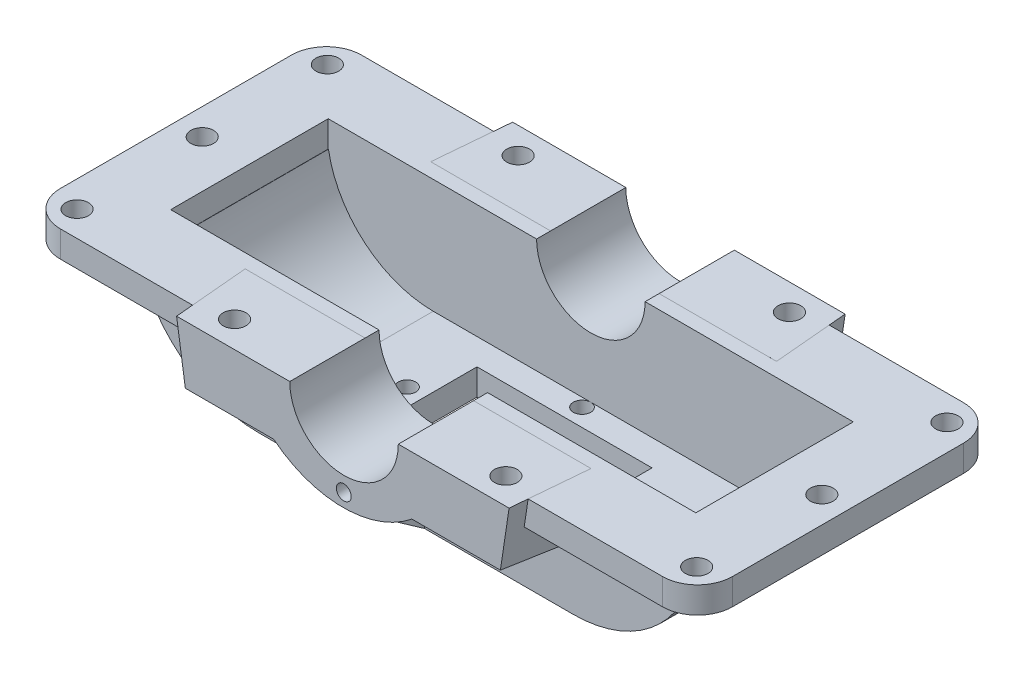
ISO-10303-21;
HEADER;
FILE_DESCRIPTION(('STEP AP214'),'2;1');
FILE_NAME('part.step','',(''),(''),'','','');
FILE_SCHEMA(('AUTOMOTIVE_DESIGN { 1 0 10303 214 1 1 1 1 }'));
ENDSEC;
DATA;
#1=APPLICATION_CONTEXT('core data for automotive mechanical design processes');
#2=APPLICATION_PROTOCOL_DEFINITION('international standard','automotive_design',2000,#1);
#3=PRODUCT_CONTEXT('',#1,'mechanical');
#4=PRODUCT('Part','Part','',(#3));
#5=PRODUCT_RELATED_PRODUCT_CATEGORY('part','',(#4));
#6=PRODUCT_DEFINITION_FORMATION('','',#4);
#7=PRODUCT_DEFINITION_CONTEXT('part definition',#1,'design');
#8=PRODUCT_DEFINITION('design','',#6,#7);
#9=PRODUCT_DEFINITION_SHAPE('','',#8);
#10=(LENGTH_UNIT() NAMED_UNIT(*) SI_UNIT(.MILLI.,.METRE.));
#11=(NAMED_UNIT(*) PLANE_ANGLE_UNIT() SI_UNIT($,.RADIAN.));
#12=(NAMED_UNIT(*) SI_UNIT($,.STERADIAN.) SOLID_ANGLE_UNIT());
#13=UNCERTAINTY_MEASURE_WITH_UNIT(LENGTH_MEASURE(1.E-05),#10,'distance_accuracy_value','');
#14=(GEOMETRIC_REPRESENTATION_CONTEXT(3) GLOBAL_UNCERTAINTY_ASSIGNED_CONTEXT((#13)) GLOBAL_UNIT_ASSIGNED_CONTEXT((#10,
#11,#12)) REPRESENTATION_CONTEXT('',''));
#15=CARTESIAN_POINT('',(0.,0.,0.));
#16=DIRECTION('',(0.,0.,1.));
#17=DIRECTION('',(1.,0.,0.));
#18=AXIS2_PLACEMENT_3D('',#15,#16,#17);
#19=CARTESIAN_POINT('',(-5.00000000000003,0.,-96.0000000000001));
#20=DIRECTION('',(0.,0.,-1.));
#21=DIRECTION('',(-1.,0.,0.));
#22=AXIS2_PLACEMENT_3D('',#19,#20,#21);
#23=PLANE('',#22);
#24=CARTESIAN_POINT('',(-0.115521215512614,-24.4087167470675,-96.0000000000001));
#25=DIRECTION('',(0.,0.,-1.));
#26=DIRECTION('',(-1.,0.,0.));
#27=AXIS2_PLACEMENT_3D('',#24,#25,#26);
#28=CIRCLE('',#27,4.24999999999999);
#29=CARTESIAN_POINT('',(-4.3655212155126,-24.4087167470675,-96.0000000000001));
#30=VERTEX_POINT('',#29);
#31=EDGE_CURVE('E2358',#30,#30,#28,.T.);
#32=ORIENTED_EDGE('',*,*,#31,.F.);
#33=EDGE_LOOP('',(#32));
#34=FACE_BOUND('',#33,.T.);
#35=CARTESIAN_POINT('',(0.038670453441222,15.0002073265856,-96.0000000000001));
#36=DIRECTION('',(0.,0.,1.));
#37=DIRECTION('',(1.,0.,0.));
#38=AXIS2_PLACEMENT_3D('',#35,#36,#37);
#39=CIRCLE('',#38,31.);
#40=CARTESIAN_POINT('',(-30.9613295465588,15.0002073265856,-96.0000000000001));
#41=VERTEX_POINT('',#40);
#42=CARTESIAN_POINT('',(31.0386704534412,15.0002073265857,-96.0000000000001));
#43=VERTEX_POINT('',#42);
#44=EDGE_CURVE('E56',#41,#43,#39,.T.);
#45=ORIENTED_EDGE('',*,*,#44,.T.);
#46=DIRECTION('',(1.,0.,0.));
#47=VECTOR('',#46,1.);
#48=CARTESIAN_POINT('',(137.411689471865,15.0002073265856,-96.0000000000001));
#49=LINE('',#48,#47);
#50=CARTESIAN_POINT('',(94.3300175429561,15.0002073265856,-96.0000000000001));
#51=VERTEX_POINT('',#50);
#52=EDGE_CURVE('E1352',#43,#51,#49,.T.);
#53=ORIENTED_EDGE('',*,*,#52,.T.);
#54=DIRECTION('',(0.147716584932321,0.989029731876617,0.));
#55=VECTOR('',#54,1.);
#56=CARTESIAN_POINT('',(94.3742233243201,15.2961851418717,-96.0000000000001));
#57=LINE('',#56,#55);
#58=CARTESIAN_POINT('',(89.3742233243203,-18.1810893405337,-96.0000000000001));
#59=VERTEX_POINT('',#58);
#60=EDGE_CURVE('E1271',#59,#51,#57,.T.);
#61=ORIENTED_EDGE('',*,*,#60,.F.);
#62=DIRECTION('',(1.,0.,0.));
#63=VECTOR('',#62,1.);
#64=CARTESIAN_POINT('',(38.8179330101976,-18.1810893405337,-96.0000000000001));
#65=LINE('',#64,#63);
#66=CARTESIAN_POINT('',(38.8179330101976,-18.1810893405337,-96.0000000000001));
#67=VERTEX_POINT('',#66);
#68=EDGE_CURVE('E1316',#67,#59,#65,.T.);
#69=ORIENTED_EDGE('',*,*,#68,.F.);
#70=CARTESIAN_POINT('',(-0.625776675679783,30.6711364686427,-96.0000000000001));
#71=DIRECTION('',(0.,0.,1.));
#72=DIRECTION('',(-1.,0.,0.));
#73=AXIS2_PLACEMENT_3D('',#70,#71,#72);
#74=CIRCLE('',#73,62.7881055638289);
#75=CARTESIAN_POINT('',(-40.0694863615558,-18.1810893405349,-96.));
#76=VERTEX_POINT('',#75);
#77=EDGE_CURVE('E1284',#76,#67,#74,.T.);
#78=ORIENTED_EDGE('',*,*,#77,.F.);
#79=DIRECTION('',(1.,0.,0.));
#80=VECTOR('',#79,1.);
#81=CARTESIAN_POINT('',(-90.6257766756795,-18.1810893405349,-96.));
#82=LINE('',#81,#80);
#83=CARTESIAN_POINT('',(-90.6257766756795,-18.1810893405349,-96.));
#84=VERTEX_POINT('',#83);
#85=EDGE_CURVE('E1341',#84,#76,#82,.T.);
#86=ORIENTED_EDGE('',*,*,#85,.F.);
#87=DIRECTION('',(0.148918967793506,-0.98884940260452,0.));
#88=VECTOR('',#87,1.);
#89=CARTESIAN_POINT('',(-95.6257766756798,15.0198325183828,-96.));
#90=LINE('',#89,#88);
#91=CARTESIAN_POINT('',(-95.6228211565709,15.0002073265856,-96.));
#92=VERTEX_POINT('',#91);
#93=EDGE_CURVE('E1343',#92,#84,#90,.T.);
#94=ORIENTED_EDGE('',*,*,#93,.F.);
#95=DIRECTION('',(1.,0.,0.));
#96=VECTOR('',#95,1.);
#97=CARTESIAN_POINT('',(-30.9613295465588,15.0002073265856,-96.));
#98=LINE('',#97,#96);
#99=EDGE_CURVE('E1355',#92,#41,#98,.T.);
#100=ORIENTED_EDGE('',*,*,#99,.T.);
#101=EDGE_LOOP('',(#45,#53,#61,#69,#78,#86,#94,#100));
#102=FACE_BOUND('',#101,.T.);
#103=ADVANCED_FACE('F39',(#34,#102),#23,.T.);
#104=CARTESIAN_POINT('',(-172.,15.,-65.9999999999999));
#105=DIRECTION('',(0.,-1.,0.));
#106=DIRECTION('',(0.,0.,-1.));
#107=AXIS2_PLACEMENT_3D('',#104,#105,#106);
#108=PLANE('',#107);
#109=CARTESIAN_POINT('',(-177.,15.,71.5000000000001));
#110=DIRECTION('',(0.,1.,0.));
#111=DIRECTION('',(0.,0.,-1.));
#112=AXIS2_PLACEMENT_3D('',#109,#110,#111);
#113=CIRCLE('',#112,6.50000000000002);
#114=CARTESIAN_POINT('',(-177.,15.,65.));
#115=VERTEX_POINT('',#114);
#116=EDGE_CURVE('E623',#115,#115,#113,.T.);
#117=ORIENTED_EDGE('',*,*,#116,.F.);
#118=EDGE_LOOP('',(#117));
#119=FACE_BOUND('',#118,.T.);
#120=CARTESIAN_POINT('',(-177.,15.,0.));
#121=DIRECTION('',(0.,1.,0.));
#122=DIRECTION('',(0.,0.,1.));
#123=AXIS2_PLACEMENT_3D('',#120,#121,#122);
#124=CIRCLE('',#123,6.50000000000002);
#125=CARTESIAN_POINT('',(-177.,15.,6.50000000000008));
#126=VERTEX_POINT('',#125);
#127=EDGE_CURVE('E635',#126,#126,#124,.T.);
#128=ORIENTED_EDGE('',*,*,#127,.F.);
#129=EDGE_LOOP('',(#128));
#130=FACE_BOUND('',#129,.T.);
#131=CARTESIAN_POINT('',(-177.,15.,-71.4999999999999));
#132=DIRECTION('',(0.,1.,0.));
#133=DIRECTION('',(0.,0.,1.));
#134=AXIS2_PLACEMENT_3D('',#131,#132,#133);
#135=CIRCLE('',#134,6.50000000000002);
#136=CARTESIAN_POINT('',(-177.,15.,-64.9999999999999));
#137=VERTEX_POINT('',#136);
#138=EDGE_CURVE('E641',#137,#137,#135,.T.);
#139=ORIENTED_EDGE('',*,*,#138,.F.);
#140=EDGE_LOOP('',(#139));
#141=FACE_BOUND('',#140,.T.);
#142=DIRECTION('',(0.,0.,-1.));
#143=VECTOR('',#142,1.);
#144=CARTESIAN_POINT('',(-30.9613295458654,15.,96.0010000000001));
#145=LINE('',#144,#143);
#146=CARTESIAN_POINT('',(-30.9613295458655,15.,-44.9999999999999));
#147=VERTEX_POINT('',#146);
#148=CARTESIAN_POINT('',(-30.9613295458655,15.,-53.));
#149=VERTEX_POINT('',#148);
#150=EDGE_CURVE('E1366',#147,#149,#145,.T.);
#151=ORIENTED_EDGE('',*,*,#150,.T.);
#152=DIRECTION('',(1.,0.,0.));
#153=VECTOR('',#152,1.);
#154=CARTESIAN_POINT('',(-172.,15.,-53.));
#155=LINE('',#154,#153);
#156=CARTESIAN_POINT('',(-99.4272241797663,15.,-53.));
#157=VERTEX_POINT('',#156);
#158=EDGE_CURVE('E1445',#157,#149,#155,.T.);
#159=ORIENTED_EDGE('',*,*,#158,.F.);
#160=DIRECTION('',(0.0881309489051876,0.,-0.996108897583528));
#161=VECTOR('',#160,1.);
#162=CARTESIAN_POINT('',(-98.8496572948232,15.,-59.5280076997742));
#163=LINE('',#162,#161);
#164=CARTESIAN_POINT('',(-96.5075420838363,15.,-85.9999999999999));
#165=VERTEX_POINT('',#164);
#166=EDGE_CURVE('E1303',#165,#157,#163,.F.);
#167=ORIENTED_EDGE('',*,*,#166,.F.);
#168=DIRECTION('',(-1.,0.,0.));
#169=VECTOR('',#168,1.);
#170=CARTESIAN_POINT('',(-172.,15.,-85.9999999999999));
#171=LINE('',#170,#169);
#172=CARTESIAN_POINT('',(-172.,15.,-85.9999999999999));
#173=VERTEX_POINT('',#172);
#174=EDGE_CURVE('E840',#165,#173,#171,.T.);
#175=ORIENTED_EDGE('',*,*,#174,.T.);
#176=CARTESIAN_POINT('',(-172.,15.,-65.9999999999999));
#177=DIRECTION('',(0.,1.,0.));
#178=DIRECTION('',(0.,0.,-1.));
#179=AXIS2_PLACEMENT_3D('',#176,#177,#178);
#180=CIRCLE('',#179,20.);
#181=CARTESIAN_POINT('',(-192.,15.,-65.9999999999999));
#182=VERTEX_POINT('',#181);
#183=EDGE_CURVE('E822',#173,#182,#180,.T.);
#184=ORIENTED_EDGE('',*,*,#183,.T.);
#185=DIRECTION('',(0.,0.,1.));
#186=VECTOR('',#185,1.);
#187=CARTESIAN_POINT('',(-192.,15.,66.0000000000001));
#188=LINE('',#187,#186);
#189=CARTESIAN_POINT('',(-192.,15.,66.0000000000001));
#190=VERTEX_POINT('',#189);
#191=EDGE_CURVE('E825',#182,#190,#188,.T.);
#192=ORIENTED_EDGE('',*,*,#191,.T.);
#193=CARTESIAN_POINT('',(-172.,15.,66.0000000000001));
#194=DIRECTION('',(0.,1.,0.));
#195=DIRECTION('',(0.,0.,1.));
#196=AXIS2_PLACEMENT_3D('',#193,#194,#195);
#197=CIRCLE('',#196,20.);
#198=CARTESIAN_POINT('',(-172.,15.,86.0000000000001));
#199=VERTEX_POINT('',#198);
#200=EDGE_CURVE('E828',#190,#199,#197,.T.);
#201=ORIENTED_EDGE('',*,*,#200,.T.);
#202=DIRECTION('',(1.,0.,0.));
#203=VECTOR('',#202,1.);
#204=CARTESIAN_POINT('',(-172.,15.,86.0000000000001));
#205=LINE('',#204,#203);
#206=CARTESIAN_POINT('',(-96.5075420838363,15.,86.0000000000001));
#207=VERTEX_POINT('',#206);
#208=EDGE_CURVE('E831',#199,#207,#205,.T.);
#209=ORIENTED_EDGE('',*,*,#208,.T.);
#210=DIRECTION('',(-0.0881309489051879,0.,-0.996108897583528));
#211=VECTOR('',#210,1.);
#212=CARTESIAN_POINT('',(-110.437676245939,15.,-71.446739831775));
#213=LINE('',#212,#211);
#214=CARTESIAN_POINT('',(-99.4272241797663,15.,53.0000000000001));
#215=VERTEX_POINT('',#214);
#216=EDGE_CURVE('E1016',#207,#215,#213,.T.);
#217=ORIENTED_EDGE('',*,*,#216,.T.);
#218=DIRECTION('',(-1.,0.,0.));
#219=VECTOR('',#218,1.);
#220=CARTESIAN_POINT('',(-172.,15.,53.0000000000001));
#221=LINE('',#220,#219);
#222=CARTESIAN_POINT('',(-30.9613295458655,15.,53.));
#223=VERTEX_POINT('',#222);
#224=EDGE_CURVE('E579',#223,#215,#221,.T.);
#225=ORIENTED_EDGE('',*,*,#224,.F.);
#226=DIRECTION('',(0.,0.,1.));
#227=VECTOR('',#226,1.);
#228=CARTESIAN_POINT('',(-30.9613295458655,15.,-86.001));
#229=LINE('',#228,#227);
#230=CARTESIAN_POINT('',(-30.9613295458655,15.,45.0000000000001));
#231=VERTEX_POINT('',#230);
#232=EDGE_CURVE('E1171',#231,#223,#229,.T.);
#233=ORIENTED_EDGE('',*,*,#232,.F.);
#234=DIRECTION('',(1.,0.,0.));
#235=VECTOR('',#234,1.);
#236=CARTESIAN_POINT('',(-150.,15.,45.0000000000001));
#237=LINE('',#236,#235);
#238=CARTESIAN_POINT('',(-150.,15.,45.0000000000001));
#239=VERTEX_POINT('',#238);
#240=EDGE_CURVE('E804',#239,#231,#237,.T.);
#241=ORIENTED_EDGE('',*,*,#240,.F.);
#242=DIRECTION('',(0.,0.,1.));
#243=VECTOR('',#242,1.);
#244=CARTESIAN_POINT('',(-150.,15.,45.0000000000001));
#245=LINE('',#244,#243);
#246=CARTESIAN_POINT('',(-150.,15.,-44.9999999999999));
#247=VERTEX_POINT('',#246);
#248=EDGE_CURVE('E801',#247,#239,#245,.T.);
#249=ORIENTED_EDGE('',*,*,#248,.F.);
#250=DIRECTION('',(-1.,0.,0.));
#251=VECTOR('',#250,1.);
#252=CARTESIAN_POINT('',(-150.,15.,-44.9999999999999));
#253=LINE('',#252,#251);
#254=EDGE_CURVE('E795',#147,#247,#253,.T.);
#255=ORIENTED_EDGE('',*,*,#254,.F.);
#256=EDGE_LOOP('',(#151,#159,#167,#175,#184,#192,#201,#209,#217,#225,#233,#241,#249,#255));
#257=FACE_BOUND('',#256,.T.);
#258=ADVANCED_FACE('F496',(#119,#130,#141,#257),#108,.F.);
#259=CARTESIAN_POINT('',(177.,15.,71.5));
#260=DIRECTION('',(0.,1.,0.));
#261=DIRECTION('',(0.,0.,-1.));
#262=AXIS2_PLACEMENT_3D('',#259,#260,#261);
#263=CIRCLE('',#262,6.50000000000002);
#264=CARTESIAN_POINT('',(177.,15.,64.9999999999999));
#265=VERTEX_POINT('',#264);
#266=EDGE_CURVE('E609',#265,#265,#263,.T.);
#267=ORIENTED_EDGE('',*,*,#266,.F.);
#268=EDGE_LOOP('',(#267));
#269=FACE_BOUND('',#268,.T.);
#270=CARTESIAN_POINT('',(177.,15.,-71.4999999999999));
#271=DIRECTION('',(0.,1.,0.));
#272=DIRECTION('',(0.,0.,1.));
#273=AXIS2_PLACEMENT_3D('',#270,#271,#272);
#274=CIRCLE('',#273,6.50000000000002);
#275=CARTESIAN_POINT('',(177.,15.,-64.9999999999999));
#276=VERTEX_POINT('',#275);
#277=EDGE_CURVE('E617',#276,#276,#274,.T.);
#278=ORIENTED_EDGE('',*,*,#277,.F.);
#279=EDGE_LOOP('',(#278));
#280=FACE_BOUND('',#279,.T.);
#281=CARTESIAN_POINT('',(177.,15.,0.));
#282=DIRECTION('',(0.,1.,0.));
#283=DIRECTION('',(0.,0.,1.));
#284=AXIS2_PLACEMENT_3D('',#281,#282,#283);
#285=CIRCLE('',#284,6.50000000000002);
#286=CARTESIAN_POINT('',(177.,15.,6.50000000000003));
#287=VERTEX_POINT('',#286);
#288=EDGE_CURVE('E629',#287,#287,#285,.T.);
#289=ORIENTED_EDGE('',*,*,#288,.F.);
#290=EDGE_LOOP('',(#289));
#291=FACE_BOUND('',#290,.T.);
#292=DIRECTION('',(0.,0.,-1.));
#293=VECTOR('',#292,1.);
#294=CARTESIAN_POINT('',(31.038670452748,15.,96.0010000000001));
#295=LINE('',#294,#293);
#296=CARTESIAN_POINT('',(31.0386704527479,15.,-53.0000000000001));
#297=VERTEX_POINT('',#296);
#298=CARTESIAN_POINT('',(31.0386704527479,15.,-45.));
#299=VERTEX_POINT('',#298);
#300=EDGE_CURVE('E1344',#297,#299,#295,.F.);
#301=ORIENTED_EDGE('',*,*,#300,.T.);
#302=CARTESIAN_POINT('',(150.,15.,-45.));
#303=VERTEX_POINT('',#302);
#304=EDGE_CURVE('E798',#303,#299,#253,.T.);
#305=ORIENTED_EDGE('',*,*,#304,.F.);
#306=DIRECTION('',(0.,0.,-1.));
#307=VECTOR('',#306,1.);
#308=CARTESIAN_POINT('',(150.,15.,45.));
#309=LINE('',#308,#307);
#310=CARTESIAN_POINT('',(150.,15.,45.));
#311=VERTEX_POINT('',#310);
#312=EDGE_CURVE('E807',#311,#303,#309,.T.);
#313=ORIENTED_EDGE('',*,*,#312,.F.);
#314=CARTESIAN_POINT('',(31.0386704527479,15.,45.));
#315=VERTEX_POINT('',#314);
#316=EDGE_CURVE('E803',#315,#311,#237,.T.);
#317=ORIENTED_EDGE('',*,*,#316,.F.);
#318=DIRECTION('',(0.,0.,1.));
#319=VECTOR('',#318,1.);
#320=CARTESIAN_POINT('',(31.0386704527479,15.,-86.001));
#321=LINE('',#320,#319);
#322=CARTESIAN_POINT('',(31.0386704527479,15.,53.));
#323=VERTEX_POINT('',#322);
#324=EDGE_CURVE('E1166',#323,#315,#321,.F.);
#325=ORIENTED_EDGE('',*,*,#324,.F.);
#326=CARTESIAN_POINT('',(98.1337271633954,15.,53.0000000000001));
#327=VERTEX_POINT('',#326);
#328=EDGE_CURVE('E582',#327,#323,#221,.T.);
#329=ORIENTED_EDGE('',*,*,#328,.F.);
#330=DIRECTION('',(-0.0881150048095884,0.,0.996110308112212));
#331=VECTOR('',#330,1.);
#332=CARTESIAN_POINT('',(106.481239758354,15.,-41.365804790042));
#333=LINE('',#332,#331);
#334=CARTESIAN_POINT('',(95.2145774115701,15.,86.));
#335=VERTEX_POINT('',#334);
#336=EDGE_CURVE('E1018',#327,#335,#333,.T.);
#337=ORIENTED_EDGE('',*,*,#336,.T.);
#338=CARTESIAN_POINT('',(172.,15.,86.));
#339=VERTEX_POINT('',#338);
#340=EDGE_CURVE('E830',#335,#339,#205,.T.);
#341=ORIENTED_EDGE('',*,*,#340,.T.);
#342=CARTESIAN_POINT('',(172.,15.,66.));
#343=DIRECTION('',(0.,1.,0.));
#344=DIRECTION('',(0.,0.,-1.));
#345=AXIS2_PLACEMENT_3D('',#342,#343,#344);
#346=CIRCLE('',#345,20.);
#347=CARTESIAN_POINT('',(192.,15.,66.));
#348=VERTEX_POINT('',#347);
#349=EDGE_CURVE('E834',#339,#348,#346,.T.);
#350=ORIENTED_EDGE('',*,*,#349,.T.);
#351=DIRECTION('',(0.,0.,-1.));
#352=VECTOR('',#351,1.);
#353=CARTESIAN_POINT('',(192.,15.,66.));
#354=LINE('',#353,#352);
#355=CARTESIAN_POINT('',(192.,15.,-66.));
#356=VERTEX_POINT('',#355);
#357=EDGE_CURVE('E836',#348,#356,#354,.T.);
#358=ORIENTED_EDGE('',*,*,#357,.T.);
#359=CARTESIAN_POINT('',(172.,15.,-65.9999999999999));
#360=DIRECTION('',(0.,1.,0.));
#361=DIRECTION('',(0.,0.,-1.));
#362=AXIS2_PLACEMENT_3D('',#359,#360,#361);
#363=CIRCLE('',#362,20.);
#364=CARTESIAN_POINT('',(172.,15.,-86.));
#365=VERTEX_POINT('',#364);
#366=EDGE_CURVE('E838',#356,#365,#363,.T.);
#367=ORIENTED_EDGE('',*,*,#366,.T.);
#368=CARTESIAN_POINT('',(95.2145774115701,15.,-85.9999999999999));
#369=VERTEX_POINT('',#368);
#370=EDGE_CURVE('E841',#365,#369,#171,.T.);
#371=ORIENTED_EDGE('',*,*,#370,.T.);
#372=DIRECTION('',(0.0881150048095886,0.,0.996110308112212));
#373=VECTOR('',#372,1.);
#374=CARTESIAN_POINT('',(94.8953008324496,15.,-89.6093136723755));
#375=LINE('',#374,#373);
#376=CARTESIAN_POINT('',(98.1337271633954,15.,-53.0000000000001));
#377=VERTEX_POINT('',#376);
#378=EDGE_CURVE('E1116',#377,#369,#375,.F.);
#379=ORIENTED_EDGE('',*,*,#378,.F.);
#380=EDGE_CURVE('E1117',#297,#377,#155,.T.);
#381=ORIENTED_EDGE('',*,*,#380,.F.);
#382=EDGE_LOOP('',(#301,#305,#313,#317,#325,#329,#337,#341,#350,#358,#367,#371,#379,#381));
#383=FACE_BOUND('',#382,.T.);
#384=ADVANCED_FACE('F502',(#269,#280,#291,#383),#108,.F.);
#385=CARTESIAN_POINT('',(-150.,15.,-44.9999999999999));
#386=DIRECTION('',(0.,0.,1.));
#387=DIRECTION('',(1.,0.,0.));
#388=AXIS2_PLACEMENT_3D('',#385,#386,#387);
#389=PLANE('',#388);
#390=ORIENTED_EDGE('',*,*,#304,.T.);
#391=CARTESIAN_POINT('',(0.0386704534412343,15.0002073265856,-45.));
#392=DIRECTION('',(0.,0.,1.));
#393=DIRECTION('',(1.,0.,0.));
#394=AXIS2_PLACEMENT_3D('',#391,#392,#393);
#395=CIRCLE('',#394,31.);
#396=EDGE_CURVE('E1347',#147,#299,#395,.T.);
#397=ORIENTED_EDGE('',*,*,#396,.F.);
#398=ORIENTED_EDGE('',*,*,#254,.T.);
#399=DIRECTION('',(0.,-1.,0.));
#400=VECTOR('',#399,1.);
#401=CARTESIAN_POINT('',(-150.,15.,-44.9999999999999));
#402=LINE('',#401,#400);
#403=CARTESIAN_POINT('',(-150.,0.,-44.9999999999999));
#404=VERTEX_POINT('',#403);
#405=EDGE_CURVE('E818',#247,#404,#402,.T.);
#406=ORIENTED_EDGE('',*,*,#405,.T.);
#407=DIRECTION('',(1.,0.,0.));
#408=VECTOR('',#407,1.);
#409=CARTESIAN_POINT('',(-150.,0.,-44.9999999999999));
#410=LINE('',#409,#408);
#411=CARTESIAN_POINT('',(-149.868726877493,0.,-44.9999999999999));
#412=VERTEX_POINT('',#411);
#413=EDGE_CURVE('E748',#404,#412,#410,.T.);
#414=ORIENTED_EDGE('',*,*,#413,.T.);
#415=CARTESIAN_POINT('',(-90.0000002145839,10.5246288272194,-44.9999999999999));
#416=DIRECTION('',(0.,0.,1.));
#417=DIRECTION('',(1.,0.,0.));
#418=AXIS2_PLACEMENT_3D('',#415,#416,#417);
#419=CIRCLE('',#418,60.7867768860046);
#420=CARTESIAN_POINT('',(-90.0000002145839,-50.2621480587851,-44.9999999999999));
#421=VERTEX_POINT('',#420);
#422=EDGE_CURVE('E753',#421,#412,#419,.F.);
#423=ORIENTED_EDGE('',*,*,#422,.F.);
#424=DIRECTION('',(1.,0.,0.));
#425=VECTOR('',#424,1.);
#426=CARTESIAN_POINT('',(-150.,-50.2621480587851,-44.9999999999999));
#427=LINE('',#426,#425);
#428=CARTESIAN_POINT('',(0.,-50.2621480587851,-44.9999999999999));
#429=VERTEX_POINT('',#428);
#430=EDGE_CURVE('E761',#421,#429,#427,.T.);
#431=ORIENTED_EDGE('',*,*,#430,.T.);
#432=CARTESIAN_POINT('',(90.000000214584,-50.2621480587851,-44.9999999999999));
#433=VERTEX_POINT('',#432);
#434=EDGE_CURVE('E760',#429,#433,#427,.T.);
#435=ORIENTED_EDGE('',*,*,#434,.T.);
#436=CARTESIAN_POINT('',(90.000000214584,10.5246288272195,-45.));
#437=DIRECTION('',(0.,0.,1.));
#438=DIRECTION('',(1.,0.,0.));
#439=AXIS2_PLACEMENT_3D('',#436,#437,#438);
#440=CIRCLE('',#439,60.7867768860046);
#441=CARTESIAN_POINT('',(149.868726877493,0.,-45.));
#442=VERTEX_POINT('',#441);
#443=EDGE_CURVE('E766',#433,#442,#440,.T.);
#444=ORIENTED_EDGE('',*,*,#443,.T.);
#445=DIRECTION('',(-1.,0.,0.));
#446=VECTOR('',#445,1.);
#447=CARTESIAN_POINT('',(-150.,0.,-44.9999999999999));
#448=LINE('',#447,#446);
#449=CARTESIAN_POINT('',(150.,0.,-45.));
#450=VERTEX_POINT('',#449);
#451=EDGE_CURVE('E741',#450,#442,#448,.T.);
#452=ORIENTED_EDGE('',*,*,#451,.F.);
#453=DIRECTION('',(0.,-1.,0.));
#454=VECTOR('',#453,1.);
#455=CARTESIAN_POINT('',(150.,15.,-45.));
#456=LINE('',#455,#454);
#457=EDGE_CURVE('E809',#303,#450,#456,.T.);
#458=ORIENTED_EDGE('',*,*,#457,.F.);
#459=EDGE_LOOP('',(#390,#397,#398,#406,#414,#423,#431,#435,#444,#452,#458));
#460=FACE_BOUND('',#459,.T.);
#461=ADVANCED_FACE('F1375',(#460),#389,.T.);
#462=CARTESIAN_POINT('',(-0.625776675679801,30.671136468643,-53.0000000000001));
#463=DIRECTION('',(0.,0.,-1.));
#464=DIRECTION('',(1.,0.,0.));
#465=AXIS2_PLACEMENT_3D('',#462,#463,#464);
#466=PLANE('',#465);
#467=CARTESIAN_POINT('',(0.0386704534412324,15.0002073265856,-53.));
#468=DIRECTION('',(0.,0.,-1.));
#469=DIRECTION('',(-1.,0.,0.));
#470=AXIS2_PLACEMENT_3D('',#467,#468,#469);
#471=CIRCLE('',#470,31.);
#472=CARTESIAN_POINT('',(31.0386704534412,15.0002073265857,-53.0000000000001));
#473=VERTEX_POINT('',#472);
#474=EDGE_CURVE('E1496',#473,#297,#471,.T.);
#475=ORIENTED_EDGE('',*,*,#474,.T.);
#476=ORIENTED_EDGE('',*,*,#380,.T.);
#477=DIRECTION('',(-0.147716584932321,-0.989029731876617,0.));
#478=VECTOR('',#477,1.);
#479=CARTESIAN_POINT('',(98.2682679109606,15.9008115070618,-53.0000000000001));
#480=LINE('',#479,#478);
#481=CARTESIAN_POINT('',(98.133758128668,15.0002073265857,-53.0000000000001));
#482=VERTEX_POINT('',#481);
#483=EDGE_CURVE('E1249',#377,#482,#480,.F.);
#484=ORIENTED_EDGE('',*,*,#483,.T.);
#485=DIRECTION('',(-1.,0.,0.));
#486=VECTOR('',#485,1.);
#487=CARTESIAN_POINT('',(137.411689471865,15.0002073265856,-53.0000000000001));
#488=LINE('',#487,#486);
#489=EDGE_CURVE('E1281',#482,#473,#488,.T.);
#490=ORIENTED_EDGE('',*,*,#489,.T.);
#491=EDGE_LOOP('',(#475,#476,#484,#490));
#492=FACE_BOUND('',#491,.T.);
#493=ADVANCED_FACE('F1228',(#492),#466,.F.);
#494=CARTESIAN_POINT('',(-30.9613295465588,15.0002073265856,-53.0000000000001));
#495=VERTEX_POINT('',#494);
#496=EDGE_CURVE('E1275',#149,#495,#471,.T.);
#497=ORIENTED_EDGE('',*,*,#496,.T.);
#498=DIRECTION('',(-1.,0.,0.));
#499=VECTOR('',#498,1.);
#500=CARTESIAN_POINT('',(-30.9613295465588,15.0002073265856,-53.0000000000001));
#501=LINE('',#500,#499);
#502=CARTESIAN_POINT('',(-99.4272554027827,15.0002073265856,-53.));
#503=VERTEX_POINT('',#502);
#504=EDGE_CURVE('E1362',#495,#503,#501,.T.);
#505=ORIENTED_EDGE('',*,*,#504,.T.);
#506=DIRECTION('',(-0.148918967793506,0.98884940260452,0.));
#507=VECTOR('',#506,1.);
#508=CARTESIAN_POINT('',(-99.5438254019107,15.7742536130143,-53.));
#509=LINE('',#508,#507);
#510=EDGE_CURVE('E1282',#503,#157,#509,.F.);
#511=ORIENTED_EDGE('',*,*,#510,.T.);
#512=ORIENTED_EDGE('',*,*,#158,.T.);
#513=EDGE_LOOP('',(#497,#505,#511,#512));
#514=FACE_BOUND('',#513,.T.);
#515=ADVANCED_FACE('F1261',(#514),#466,.F.);
#516=CARTESIAN_POINT('',(94.3742233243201,15.2961851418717,-96.0000000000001));
#517=DIRECTION('',(0.985266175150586,-0.147154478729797,-0.0871557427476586));
#518=DIRECTION('',(0.147716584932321,0.989029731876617,0.));
#519=AXIS2_PLACEMENT_3D('',#516,#517,#518);
#520=PLANE('',#519);
#521=DIRECTION('',(-0.0881150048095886,0.,-0.996110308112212));
#522=VECTOR('',#521,1.);
#523=CARTESIAN_POINT('',(111.516877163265,15.0002073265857,98.2916313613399));
#524=LINE('',#523,#522);
#525=EDGE_CURVE('E1268',#51,#482,#524,.F.);
#526=ORIENTED_EDGE('',*,*,#525,.T.);
#527=ORIENTED_EDGE('',*,*,#483,.F.);
#528=ORIENTED_EDGE('',*,*,#378,.T.);
#529=DIRECTION('',(0.147716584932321,0.989029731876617,0.));
#530=VECTOR('',#529,1.);
#531=CARTESIAN_POINT('',(89.3839047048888,-24.0390061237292,-85.9999999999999));
#532=LINE('',#531,#530);
#533=CARTESIAN_POINT('',(92.9742516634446,0.,-86.));
#534=VERTEX_POINT('',#533);
#535=EDGE_CURVE('E1113',#369,#534,#532,.F.);
#536=ORIENTED_EDGE('',*,*,#535,.T.);
#537=DIRECTION('',(0.0881150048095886,0.,0.996110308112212));
#538=VECTOR('',#537,1.);
#539=CARTESIAN_POINT('',(92.672369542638,0.,-89.4126752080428));
#540=LINE('',#539,#538);
#541=CARTESIAN_POINT('',(95.2741878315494,0.,-60.));
#542=VERTEX_POINT('',#541);
#543=EDGE_CURVE('E1306',#542,#534,#540,.F.);
#544=ORIENTED_EDGE('',*,*,#543,.F.);
#545=CARTESIAN_POINT('',(94.5274125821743,-5.,-60.));
#546=DIRECTION('',(0.985266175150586,-0.147154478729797,-0.0871557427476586));
#547=DIRECTION('',(0.171027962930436,0.847734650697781,0.502091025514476));
#548=AXIS2_PLACEMENT_3D('',#545,#546,#547);
#549=ELLIPSE('',#548,5.07477078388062,5.);
#550=CARTESIAN_POINT('',(94.9697079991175,-5.,-55.));
#551=VERTEX_POINT('',#550);
#552=EDGE_CURVE('E1311',#542,#551,#549,.T.);
#553=ORIENTED_EDGE('',*,*,#552,.T.);
#554=DIRECTION('',(0.147716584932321,0.989029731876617,0.));
#555=VECTOR('',#554,1.);
#556=CARTESIAN_POINT('',(70.0913843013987,-171.57169421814,-55.));
#557=LINE('',#556,#555);
#558=CARTESIAN_POINT('',(92.4653039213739,-21.7681245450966,-55.));
#559=VERTEX_POINT('',#558);
#560=EDGE_CURVE('E1124',#551,#559,#557,.F.);
#561=ORIENTED_EDGE('',*,*,#560,.T.);
#562=DIRECTION('',(-0.0748943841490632,0.0869109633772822,-0.993396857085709));
#563=VECTOR('',#562,1.);
#564=CARTESIAN_POINT('',(89.1843607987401,-17.9607639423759,-98.5183308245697));
#565=LINE('',#564,#563);
#566=EDGE_CURVE('E1286',#559,#59,#565,.T.);
#567=ORIENTED_EDGE('',*,*,#566,.T.);
#568=ORIENTED_EDGE('',*,*,#60,.T.);
#569=EDGE_LOOP('',(#526,#527,#528,#536,#544,#553,#561,#567,#568));
#570=FACE_BOUND('',#569,.T.);
#571=ADVANCED_FACE('F1258',(#570),#520,.T.);
#572=CARTESIAN_POINT('',(-95.6257766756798,15.0198325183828,-96.));
#573=DIRECTION('',(-0.985086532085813,-0.148352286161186,-0.0871557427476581));
#574=DIRECTION('',(0.148918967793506,-0.98884940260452,0.));
#575=AXIS2_PLACEMENT_3D('',#572,#573,#574);
#576=PLANE('',#575);
#577=DIRECTION('',(-0.0881309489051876,0.,0.996108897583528));
#578=VECTOR('',#577,1.);
#579=CARTESIAN_POINT('',(-111.975979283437,15.0002073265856,88.833211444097));
#580=LINE('',#579,#578);
#581=EDGE_CURVE('E1276',#503,#92,#580,.F.);
#582=ORIENTED_EDGE('',*,*,#581,.T.);
#583=ORIENTED_EDGE('',*,*,#93,.T.);
#584=DIRECTION('',(0.0748028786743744,0.0869115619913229,-0.993403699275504));
#585=VECTOR('',#584,1.);
#586=CARTESIAN_POINT('',(-90.6257766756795,-18.1810893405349,-96.));
#587=LINE('',#586,#585);
#588=CARTESIAN_POINT('',(-93.7130593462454,-21.7681245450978,-55.));
#589=VERTEX_POINT('',#588);
#590=EDGE_CURVE('E1248',#589,#84,#587,.T.);
#591=ORIENTED_EDGE('',*,*,#590,.F.);
#592=DIRECTION('',(0.148918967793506,-0.98884940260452,0.));
#593=VECTOR('',#592,1.);
#594=CARTESIAN_POINT('',(-64.0492305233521,-218.741417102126,-55.));
#595=LINE('',#594,#593);
#596=CARTESIAN_POINT('',(-96.2383091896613,-5.,-55.));
#597=VERTEX_POINT('',#596);
#598=EDGE_CURVE('E1299',#589,#597,#595,.F.);
#599=ORIENTED_EDGE('',*,*,#598,.T.);
#600=CARTESIAN_POINT('',(-95.7959331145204,-5.,-60.));
#601=DIRECTION('',(-0.985086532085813,-0.148352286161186,-0.0871557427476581));
#602=DIRECTION('',(0.172059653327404,-0.849355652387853,-0.498989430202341));
#603=AXIS2_PLACEMENT_3D('',#600,#601,#602);
#604=ELLIPSE('',#603,5.07569623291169,5.);
#605=CARTESIAN_POINT('',(-96.5489242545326,0.,-60.));
#606=VERTEX_POINT('',#605);
#607=EDGE_CURVE('E1210',#597,#606,#604,.T.);
#608=ORIENTED_EDGE('',*,*,#607,.T.);
#609=DIRECTION('',(0.0881309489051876,0.,-0.996108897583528));
#610=VECTOR('',#609,1.);
#611=CARTESIAN_POINT('',(-96.6082294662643,0.,-59.3296968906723));
#612=LINE('',#611,#610);
#613=CARTESIAN_POINT('',(-94.2485686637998,0.,-86.));
#614=VERTEX_POINT('',#613);
#615=EDGE_CURVE('E1297',#614,#606,#612,.F.);
#616=ORIENTED_EDGE('',*,*,#615,.F.);
#617=DIRECTION('',(0.148918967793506,-0.98884940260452,0.));
#618=VECTOR('',#617,1.);
#619=CARTESIAN_POINT('',(-98.1817276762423,26.116901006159,-85.9999999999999));
#620=LINE('',#619,#618);
#621=EDGE_CURVE('E1301',#614,#165,#620,.F.);
#622=ORIENTED_EDGE('',*,*,#621,.T.);
#623=ORIENTED_EDGE('',*,*,#166,.T.);
#624=ORIENTED_EDGE('',*,*,#510,.F.);
#625=EDGE_LOOP('',(#582,#583,#591,#599,#608,#616,#622,#623,#624));
#626=FACE_BOUND('',#625,.T.);
#627=ADVANCED_FACE('F1255',(#626),#576,.T.);
#628=CARTESIAN_POINT('',(160.,-185.,-55.));
#629=DIRECTION('',(0.,0.,1.));
#630=DIRECTION('',(1.,0.,0.));
#631=AXIS2_PLACEMENT_3D('',#628,#629,#630);
#632=PLANE('',#631);
#633=CARTESIAN_POINT('',(-0.62577667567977,30.6711364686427,-55.));
#634=DIRECTION('',(0.,0.,1.));
#635=DIRECTION('',(1.,0.,0.));
#636=AXIS2_PLACEMENT_3D('',#633,#634,#635);
#637=CIRCLE('',#636,66.3751407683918);
#638=CARTESIAN_POINT('',(40.0655395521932,-21.7681245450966,-55.));
#639=VERTEX_POINT('',#638);
#640=CARTESIAN_POINT('',(4.99999999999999,-35.465161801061,-55.));
#641=VERTEX_POINT('',#640);
#642=EDGE_CURVE('E64',#639,#641,#637,.F.);
#643=ORIENTED_EDGE('',*,*,#642,.F.);
#644=DIRECTION('',(1.,0.,0.));
#645=VECTOR('',#644,1.);
#646=CARTESIAN_POINT('',(160.,-21.7681245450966,-55.));
#647=LINE('',#646,#645);
#648=EDGE_CURVE('E11',#559,#639,#647,.F.);
#649=ORIENTED_EDGE('',*,*,#648,.F.);
#650=ORIENTED_EDGE('',*,*,#560,.F.);
#651=DIRECTION('',(1.,0.,0.));
#652=VECTOR('',#651,1.);
#653=CARTESIAN_POINT('',(160.,-5.,-55.));
#654=LINE('',#653,#652);
#655=CARTESIAN_POINT('',(159.063403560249,-5.,-55.));
#656=VERTEX_POINT('',#655);
#657=EDGE_CURVE('E922',#551,#656,#654,.T.);
#658=ORIENTED_EDGE('',*,*,#657,.T.);
#659=CARTESIAN_POINT('',(90.000000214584,10.5246288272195,-55.));
#660=DIRECTION('',(0.,0.,1.));
#661=DIRECTION('',(1.,0.,0.));
#662=AXIS2_PLACEMENT_3D('',#659,#660,#661);
#663=CIRCLE('',#662,70.7867768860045);
#664=CARTESIAN_POINT('',(90.0000002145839,-60.2621480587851,-55.));
#665=VERTEX_POINT('',#664);
#666=EDGE_CURVE('E768',#665,#656,#663,.T.);
#667=ORIENTED_EDGE('',*,*,#666,.F.);
#668=DIRECTION('',(1.,0.,0.));
#669=VECTOR('',#668,1.);
#670=CARTESIAN_POINT('',(0.,-60.2621480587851,-55.));
#671=LINE('',#670,#669);
#672=CARTESIAN_POINT('',(75.0000000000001,-60.2621480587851,-55.));
#673=VERTEX_POINT('',#672);
#674=EDGE_CURVE('E771',#673,#665,#671,.T.);
#675=ORIENTED_EDGE('',*,*,#674,.F.);
#676=CARTESIAN_POINT('',(4.99999999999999,-60.2621480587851,-55.));
#677=VERTEX_POINT('',#676);
#678=EDGE_CURVE('E777',#677,#673,#671,.T.);
#679=ORIENTED_EDGE('',*,*,#678,.F.);
#680=DIRECTION('',(0.,-1.,0.));
#681=VECTOR('',#680,1.);
#682=CARTESIAN_POINT('',(4.99999999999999,0.,-55.));
#683=LINE('',#682,#681);
#684=EDGE_CURVE('E1120',#641,#677,#683,.T.);
#685=ORIENTED_EDGE('',*,*,#684,.F.);
#686=EDGE_LOOP('',(#643,#649,#650,#658,#667,#675,#679,#685));
#687=FACE_BOUND('',#686,.T.);
#688=ADVANCED_FACE('F1257',(#687),#632,.F.);
#689=CARTESIAN_POINT('',(-5.00000000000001,-35.5597134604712,-55.));
#690=VERTEX_POINT('',#689);
#691=CARTESIAN_POINT('',(-41.3170929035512,-21.7681245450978,-55.));
#692=VERTEX_POINT('',#691);
#693=EDGE_CURVE('E1292',#690,#692,#637,.F.);
#694=ORIENTED_EDGE('',*,*,#693,.F.);
#695=DIRECTION('',(0.,-1.,0.));
#696=VECTOR('',#695,1.);
#697=CARTESIAN_POINT('',(-5.00000000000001,0.,-55.));
#698=LINE('',#697,#696);
#699=CARTESIAN_POINT('',(-5.00000000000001,-60.2621480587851,-55.));
#700=VERTEX_POINT('',#699);
#701=EDGE_CURVE('E1130',#690,#700,#698,.T.);
#702=ORIENTED_EDGE('',*,*,#701,.T.);
#703=CARTESIAN_POINT('',(-75.,-60.2621480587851,-55.));
#704=VERTEX_POINT('',#703);
#705=EDGE_CURVE('E776',#704,#700,#671,.T.);
#706=ORIENTED_EDGE('',*,*,#705,.F.);
#707=CARTESIAN_POINT('',(-90.0000002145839,-60.2621480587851,-55.));
#708=VERTEX_POINT('',#707);
#709=EDGE_CURVE('E772',#708,#704,#671,.T.);
#710=ORIENTED_EDGE('',*,*,#709,.F.);
#711=CARTESIAN_POINT('',(-90.0000002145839,10.5246288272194,-55.));
#712=DIRECTION('',(0.,0.,1.));
#713=DIRECTION('',(1.,0.,0.));
#714=AXIS2_PLACEMENT_3D('',#711,#712,#713);
#715=CIRCLE('',#714,70.7867768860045);
#716=CARTESIAN_POINT('',(-159.063403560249,-5.00000000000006,-55.));
#717=VERTEX_POINT('',#716);
#718=EDGE_CURVE('E775',#708,#717,#715,.F.);
#719=ORIENTED_EDGE('',*,*,#718,.T.);
#720=EDGE_CURVE('E923',#717,#597,#654,.T.);
#721=ORIENTED_EDGE('',*,*,#720,.T.);
#722=ORIENTED_EDGE('',*,*,#598,.F.);
#723=DIRECTION('',(1.,0.,0.));
#724=VECTOR('',#723,1.);
#725=CARTESIAN_POINT('',(160.,-21.7681245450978,-55.));
#726=LINE('',#725,#724);
#727=EDGE_CURVE('E48',#692,#589,#726,.F.);
#728=ORIENTED_EDGE('',*,*,#727,.F.);
#729=EDGE_LOOP('',(#694,#702,#706,#710,#719,#721,#722,#728));
#730=FACE_BOUND('',#729,.T.);
#731=ADVANCED_FACE('F1329',(#730),#632,.F.);
#732=CARTESIAN_POINT('',(-172.,0.,-65.9999999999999));
#733=DIRECTION('',(0.,-1.,0.));
#734=DIRECTION('',(0.,0.,-1.));
#735=AXIS2_PLACEMENT_3D('',#732,#733,#734);
#736=PLANE('',#735);
#737=CARTESIAN_POINT('',(177.,0.,71.5));
#738=DIRECTION('',(0.,-1.,0.));
#739=DIRECTION('',(0.,0.,-1.));
#740=AXIS2_PLACEMENT_3D('',#737,#738,#739);
#741=CIRCLE('',#740,6.50000000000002);
#742=CARTESIAN_POINT('',(177.,0.,64.9999999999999));
#743=VERTEX_POINT('',#742);
#744=EDGE_CURVE('E613',#743,#743,#741,.F.);
#745=ORIENTED_EDGE('',*,*,#744,.T.);
#746=EDGE_LOOP('',(#745));
#747=FACE_BOUND('',#746,.T.);
#748=CARTESIAN_POINT('',(177.,0.,-71.4999999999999));
#749=DIRECTION('',(0.,-1.,0.));
#750=DIRECTION('',(0.,0.,-1.));
#751=AXIS2_PLACEMENT_3D('',#748,#749,#750);
#752=CIRCLE('',#751,6.50000000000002);
#753=CARTESIAN_POINT('',(177.,0.,-77.9999999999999));
#754=VERTEX_POINT('',#753);
#755=EDGE_CURVE('E612',#754,#754,#752,.F.);
#756=ORIENTED_EDGE('',*,*,#755,.T.);
#757=EDGE_LOOP('',(#756));
#758=FACE_BOUND('',#757,.T.);
#759=CARTESIAN_POINT('',(177.,0.,0.));
#760=DIRECTION('',(0.,-1.,0.));
#761=DIRECTION('',(0.,0.,-1.));
#762=AXIS2_PLACEMENT_3D('',#759,#760,#761);
#763=CIRCLE('',#762,6.50000000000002);
#764=CARTESIAN_POINT('',(177.,0.,-6.5));
#765=VERTEX_POINT('',#764);
#766=EDGE_CURVE('E626',#765,#765,#763,.F.);
#767=ORIENTED_EDGE('',*,*,#766,.T.);
#768=EDGE_LOOP('',(#767));
#769=FACE_BOUND('',#768,.T.);
#770=DIRECTION('',(1.,0.,0.));
#771=VECTOR('',#770,1.);
#772=CARTESIAN_POINT('',(-172.,0.,-60.));
#773=LINE('',#772,#771);
#774=CARTESIAN_POINT('',(164.179656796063,0.,-60.));
#775=VERTEX_POINT('',#774);
#776=EDGE_CURVE('E904',#775,#542,#773,.F.);
#777=ORIENTED_EDGE('',*,*,#776,.T.);
#778=ORIENTED_EDGE('',*,*,#543,.T.);
#779=DIRECTION('',(-1.,0.,0.));
#780=VECTOR('',#779,1.);
#781=CARTESIAN_POINT('',(-172.,0.,-85.9999999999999));
#782=LINE('',#781,#780);
#783=CARTESIAN_POINT('',(172.,0.,-86.));
#784=VERTEX_POINT('',#783);
#785=EDGE_CURVE('E826',#784,#534,#782,.T.);
#786=ORIENTED_EDGE('',*,*,#785,.F.);
#787=CARTESIAN_POINT('',(172.,0.,-65.9999999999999));
#788=DIRECTION('',(0.,1.,0.));
#789=DIRECTION('',(0.,0.,-1.));
#790=AXIS2_PLACEMENT_3D('',#787,#788,#789);
#791=CIRCLE('',#790,20.);
#792=CARTESIAN_POINT('',(192.,0.,-66.));
#793=VERTEX_POINT('',#792);
#794=EDGE_CURVE('E859',#793,#784,#791,.T.);
#795=ORIENTED_EDGE('',*,*,#794,.F.);
#796=DIRECTION('',(0.,0.,-1.));
#797=VECTOR('',#796,1.);
#798=CARTESIAN_POINT('',(192.,0.,66.));
#799=LINE('',#798,#797);
#800=CARTESIAN_POINT('',(192.,0.,66.));
#801=VERTEX_POINT('',#800);
#802=EDGE_CURVE('E857',#801,#793,#799,.T.);
#803=ORIENTED_EDGE('',*,*,#802,.F.);
#804=CARTESIAN_POINT('',(172.,0.,66.));
#805=DIRECTION('',(0.,1.,0.));
#806=DIRECTION('',(0.,0.,-1.));
#807=AXIS2_PLACEMENT_3D('',#804,#805,#806);
#808=CIRCLE('',#807,20.);
#809=CARTESIAN_POINT('',(172.,0.,86.));
#810=VERTEX_POINT('',#809);
#811=EDGE_CURVE('E855',#810,#801,#808,.T.);
#812=ORIENTED_EDGE('',*,*,#811,.F.);
#813=DIRECTION('',(1.,0.,0.));
#814=VECTOR('',#813,1.);
#815=CARTESIAN_POINT('',(-172.,0.,86.0000000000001));
#816=LINE('',#815,#814);
#817=CARTESIAN_POINT('',(92.9742516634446,0.,86.0000000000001));
#818=VERTEX_POINT('',#817);
#819=EDGE_CURVE('E851',#818,#810,#816,.T.);
#820=ORIENTED_EDGE('',*,*,#819,.F.);
#821=DIRECTION('',(-0.0881150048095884,0.,0.996110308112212));
#822=VECTOR('',#821,1.);
#823=CARTESIAN_POINT('',(104.258308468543,0.,-41.5624432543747));
#824=LINE('',#823,#822);
#825=CARTESIAN_POINT('',(95.2741878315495,0.,60.));
#826=VERTEX_POINT('',#825);
#827=EDGE_CURVE('E1068',#826,#818,#824,.T.);
#828=ORIENTED_EDGE('',*,*,#827,.F.);
#829=DIRECTION('',(-1.,0.,0.));
#830=VECTOR('',#829,1.);
#831=CARTESIAN_POINT('',(-172.,0.,60.));
#832=LINE('',#831,#830);
#833=CARTESIAN_POINT('',(164.179656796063,0.,60.));
#834=VERTEX_POINT('',#833);
#835=EDGE_CURVE('E912',#826,#834,#832,.F.);
#836=ORIENTED_EDGE('',*,*,#835,.T.);
#837=DIRECTION('',(0.,0.,1.));
#838=VECTOR('',#837,1.);
#839=CARTESIAN_POINT('',(164.179656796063,0.,-55.));
#840=LINE('',#839,#838);
#841=EDGE_CURVE('E909',#834,#775,#840,.F.);
#842=ORIENTED_EDGE('',*,*,#841,.T.);
#843=EDGE_LOOP('',(#777,#778,#786,#795,#803,#812,#820,#828,#836,#842));
#844=FACE_BOUND('',#843,.T.);
#845=ADVANCED_FACE('F1066',(#747,#758,#769,#844),#736,.T.);
#846=CARTESIAN_POINT('',(-177.,0.,-71.4999999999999));
#847=DIRECTION('',(0.,-1.,0.));
#848=DIRECTION('',(0.,0.,-1.));
#849=AXIS2_PLACEMENT_3D('',#846,#847,#848);
#850=CIRCLE('',#849,6.50000000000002);
#851=CARTESIAN_POINT('',(-177.,0.,-77.9999999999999));
#852=VERTEX_POINT('',#851);
#853=EDGE_CURVE('E638',#852,#852,#850,.F.);
#854=ORIENTED_EDGE('',*,*,#853,.T.);
#855=EDGE_LOOP('',(#854));
#856=FACE_BOUND('',#855,.T.);
#857=CARTESIAN_POINT('',(-177.,0.,0.));
#858=DIRECTION('',(0.,-1.,0.));
#859=DIRECTION('',(0.,0.,-1.));
#860=AXIS2_PLACEMENT_3D('',#857,#858,#859);
#861=CIRCLE('',#860,6.50000000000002);
#862=CARTESIAN_POINT('',(-177.,0.,-6.49999999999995));
#863=VERTEX_POINT('',#862);
#864=EDGE_CURVE('E632',#863,#863,#861,.F.);
#865=ORIENTED_EDGE('',*,*,#864,.T.);
#866=EDGE_LOOP('',(#865));
#867=FACE_BOUND('',#866,.T.);
#868=CARTESIAN_POINT('',(-177.,0.,71.5000000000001));
#869=DIRECTION('',(0.,-1.,0.));
#870=DIRECTION('',(0.,0.,-1.));
#871=AXIS2_PLACEMENT_3D('',#868,#869,#870);
#872=CIRCLE('',#871,6.50000000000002);
#873=CARTESIAN_POINT('',(-177.,0.,65.));
#874=VERTEX_POINT('',#873);
#875=EDGE_CURVE('E620',#874,#874,#872,.F.);
#876=ORIENTED_EDGE('',*,*,#875,.T.);
#877=EDGE_LOOP('',(#876));
#878=FACE_BOUND('',#877,.T.);
#879=CARTESIAN_POINT('',(-172.,0.,-85.9999999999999));
#880=VERTEX_POINT('',#879);
#881=EDGE_CURVE('E861',#614,#880,#782,.T.);
#882=ORIENTED_EDGE('',*,*,#881,.F.);
#883=ORIENTED_EDGE('',*,*,#615,.T.);
#884=CARTESIAN_POINT('',(-164.179656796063,0.,-60.));
#885=VERTEX_POINT('',#884);
#886=EDGE_CURVE('E903',#606,#885,#773,.F.);
#887=ORIENTED_EDGE('',*,*,#886,.T.);
#888=DIRECTION('',(0.,0.,-1.));
#889=VECTOR('',#888,1.);
#890=CARTESIAN_POINT('',(-164.179656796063,0.,-65.9999999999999));
#891=LINE('',#890,#889);
#892=CARTESIAN_POINT('',(-164.179656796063,0.,60.));
#893=VERTEX_POINT('',#892);
#894=EDGE_CURVE('E907',#885,#893,#891,.F.);
#895=ORIENTED_EDGE('',*,*,#894,.T.);
#896=CARTESIAN_POINT('',(-96.5489242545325,0.,60.));
#897=VERTEX_POINT('',#896);
#898=EDGE_CURVE('E913',#893,#897,#832,.F.);
#899=ORIENTED_EDGE('',*,*,#898,.T.);
#900=DIRECTION('',(-0.0881309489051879,0.,-0.996108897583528));
#901=VECTOR('',#900,1.);
#902=CARTESIAN_POINT('',(-108.19624841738,0.,-71.6450506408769));
#903=LINE('',#902,#901);
#904=CARTESIAN_POINT('',(-94.2485686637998,0.,86.0000000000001));
#905=VERTEX_POINT('',#904);
#906=EDGE_CURVE('E993',#905,#897,#903,.T.);
#907=ORIENTED_EDGE('',*,*,#906,.F.);
#908=CARTESIAN_POINT('',(-172.,0.,86.0000000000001));
#909=VERTEX_POINT('',#908);
#910=EDGE_CURVE('E852',#909,#905,#816,.T.);
#911=ORIENTED_EDGE('',*,*,#910,.F.);
#912=CARTESIAN_POINT('',(-172.,0.,66.0000000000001));
#913=DIRECTION('',(0.,1.,0.));
#914=DIRECTION('',(0.,0.,1.));
#915=AXIS2_PLACEMENT_3D('',#912,#913,#914);
#916=CIRCLE('',#915,20.);
#917=CARTESIAN_POINT('',(-192.,0.,66.0000000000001));
#918=VERTEX_POINT('',#917);
#919=EDGE_CURVE('E849',#918,#909,#916,.T.);
#920=ORIENTED_EDGE('',*,*,#919,.F.);
#921=DIRECTION('',(0.,0.,1.));
#922=VECTOR('',#921,1.);
#923=CARTESIAN_POINT('',(-192.,0.,66.0000000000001));
#924=LINE('',#923,#922);
#925=CARTESIAN_POINT('',(-192.,0.,-65.9999999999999));
#926=VERTEX_POINT('',#925);
#927=EDGE_CURVE('E847',#926,#918,#924,.T.);
#928=ORIENTED_EDGE('',*,*,#927,.F.);
#929=CARTESIAN_POINT('',(-172.,0.,-65.9999999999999));
#930=DIRECTION('',(0.,1.,0.));
#931=DIRECTION('',(0.,0.,-1.));
#932=AXIS2_PLACEMENT_3D('',#929,#930,#931);
#933=CIRCLE('',#932,20.);
#934=EDGE_CURVE('E821',#880,#926,#933,.T.);
#935=ORIENTED_EDGE('',*,*,#934,.F.);
#936=EDGE_LOOP('',(#882,#883,#887,#895,#899,#907,#911,#920,#928,#935));
#937=FACE_BOUND('',#936,.T.);
#938=ADVANCED_FACE('F991',(#856,#867,#878,#937),#736,.T.);
#939=CARTESIAN_POINT('',(-172.,15.,-85.9999999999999));
#940=DIRECTION('',(0.,0.,1.));
#941=DIRECTION('',(1.,0.,0.));
#942=AXIS2_PLACEMENT_3D('',#939,#940,#941);
#943=PLANE('',#942);
#944=ORIENTED_EDGE('',*,*,#535,.F.);
#945=ORIENTED_EDGE('',*,*,#370,.F.);
#946=DIRECTION('',(0.,-1.,0.));
#947=VECTOR('',#946,1.);
#948=CARTESIAN_POINT('',(172.,15.,-86.));
#949=LINE('',#948,#947);
#950=EDGE_CURVE('E866',#365,#784,#949,.T.);
#951=ORIENTED_EDGE('',*,*,#950,.T.);
#952=ORIENTED_EDGE('',*,*,#785,.T.);
#953=EDGE_LOOP('',(#944,#945,#951,#952));
#954=FACE_BOUND('',#953,.T.);
#955=ADVANCED_FACE('F1112',(#954),#943,.F.);
#956=ORIENTED_EDGE('',*,*,#621,.F.);
#957=ORIENTED_EDGE('',*,*,#881,.T.);
#958=DIRECTION('',(0.,-1.,0.));
#959=VECTOR('',#958,1.);
#960=CARTESIAN_POINT('',(-172.,15.,-85.9999999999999));
#961=LINE('',#960,#959);
#962=EDGE_CURVE('E844',#173,#880,#961,.T.);
#963=ORIENTED_EDGE('',*,*,#962,.F.);
#964=ORIENTED_EDGE('',*,*,#174,.F.);
#965=EDGE_LOOP('',(#956,#957,#963,#964));
#966=FACE_BOUND('',#965,.T.);
#967=ADVANCED_FACE('F955',(#966),#943,.F.);
#968=CARTESIAN_POINT('',(160.,-5.,-60.));
#969=DIRECTION('',(1.,0.,0.));
#970=DIRECTION('',(0.,0.,-1.));
#971=AXIS2_PLACEMENT_3D('',#968,#969,#970);
#972=CYLINDRICAL_SURFACE('',#971,5.);
#973=ORIENTED_EDGE('',*,*,#552,.F.);
#974=ORIENTED_EDGE('',*,*,#776,.F.);
#975=CARTESIAN_POINT('',(164.179656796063,-5.,-60.));
#976=DIRECTION('',(0.707106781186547,0.,0.707106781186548));
#977=DIRECTION('',(0.707106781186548,0.,-0.707106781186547));
#978=AXIS2_PLACEMENT_3D('',#975,#976,#977);
#979=ELLIPSE('',#978,7.07106781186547,5.);
#980=CARTESIAN_POINT('',(159.285685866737,-3.97576929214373,-55.1060290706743));
#981=VERTEX_POINT('',#980);
#982=EDGE_CURVE('E972',#981,#775,#979,.F.);
#983=ORIENTED_EDGE('',*,*,#982,.F.);
#984=CARTESIAN_POINT('',(159.063403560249,-5.,-55.));
#985=CARTESIAN_POINT('',(159.101994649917,-4.82835060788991,-54.9999848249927));
#986=CARTESIAN_POINT('',(159.13991517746,-4.65663225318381,-55.0088416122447));
#987=CARTESIAN_POINT('',(159.195537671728,-4.40028125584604,-55.0353554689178));
#988=CARTESIAN_POINT('',(159.213860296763,-4.31507593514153,-55.0463897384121));
#989=CARTESIAN_POINT('',(159.250100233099,-4.14503579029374,-55.0728843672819));
#990=CARTESIAN_POINT('',(159.268016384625,-4.06020247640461,-55.0883560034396));
#991=CARTESIAN_POINT('',(159.285685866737,-3.97576929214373,-55.1060290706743));
#992=B_SPLINE_CURVE_WITH_KNOTS('',3,(#984,#985,#986,#987,#988,#989,#990,#991),.UNSPECIFIED.,.F.,
.F.,(4,2,2,4),(0.,0.527387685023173,0.790828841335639,1.05494551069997),.UNSPECIFIED.);
#993=EDGE_CURVE('E958',#656,#981,#992,.T.);
#994=ORIENTED_EDGE('',*,*,#993,.F.);
#995=ORIENTED_EDGE('',*,*,#657,.F.);
#996=EDGE_LOOP('',(#973,#974,#983,#994,#995));
#997=FACE_BOUND('',#996,.T.);
#998=ADVANCED_FACE('F951',(#997),#972,.F.);
#999=ORIENTED_EDGE('',*,*,#607,.F.);
#1000=ORIENTED_EDGE('',*,*,#720,.F.);
#1001=CARTESIAN_POINT('',(-159.285685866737,-3.97576929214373,-55.1060290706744));
#1002=CARTESIAN_POINT('',(-159.268016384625,-4.06020247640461,-55.0883560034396));
#1003=CARTESIAN_POINT('',(-159.250100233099,-4.14503579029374,-55.0728843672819));
#1004=CARTESIAN_POINT('',(-159.213860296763,-4.31507593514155,-55.0463897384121));
#1005=CARTESIAN_POINT('',(-159.195537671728,-4.40028125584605,-55.0353554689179));
#1006=CARTESIAN_POINT('',(-159.13991517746,-4.65663225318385,-55.0088416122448));
#1007=CARTESIAN_POINT('',(-159.101994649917,-4.82835060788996,-54.9999848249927));
#1008=CARTESIAN_POINT('',(-159.063403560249,-5.00000000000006,-55.));
#1009=B_SPLINE_CURVE_WITH_KNOTS('',3,(#1001,#1002,#1003,#1004,#1005,#1006,#1007,#1008),
.UNSPECIFIED.,.F.,.F.,(4,2,2,4),(0.,0.264116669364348,0.527557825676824,1.05494551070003),.UNSPECIFIED.);
#1010=CARTESIAN_POINT('',(-159.285685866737,-3.97576929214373,-55.1060290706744));
#1011=VERTEX_POINT('',#1010);
#1012=EDGE_CURVE('E963',#1011,#717,#1009,.T.);
#1013=ORIENTED_EDGE('',*,*,#1012,.F.);
#1014=CARTESIAN_POINT('',(-164.179656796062,-5.,-60.));
#1015=DIRECTION('',(0.707106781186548,0.,-0.707106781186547));
#1016=DIRECTION('',(0.707106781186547,0.,0.707106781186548));
#1017=AXIS2_PLACEMENT_3D('',#1014,#1015,#1016);
#1018=ELLIPSE('',#1017,7.07106781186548,5.);
#1019=EDGE_CURVE('E616',#1011,#885,#1018,.F.);
#1020=ORIENTED_EDGE('',*,*,#1019,.T.);
#1021=ORIENTED_EDGE('',*,*,#886,.F.);
#1022=EDGE_LOOP('',(#999,#1000,#1013,#1020,#1021));
#1023=FACE_BOUND('',#1022,.T.);
#1024=ADVANCED_FACE('F515',(#1023),#972,.F.);
#1025=CARTESIAN_POINT('',(-5.00000000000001,-66.1948082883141,-46.5666906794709));
#1026=DIRECTION('',(0.,-0.817892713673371,-0.575370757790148));
#1027=DIRECTION('',(0.,0.575370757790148,-0.817892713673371));
#1028=AXIS2_PLACEMENT_3D('',#1025,#1026,#1027);
#1029=PLANE('',#1028);
#1030=DIRECTION('',(0.,0.575370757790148,-0.817892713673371));
#1031=VECTOR('',#1030,1.);
#1032=CARTESIAN_POINT('',(-5.00000000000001,-66.1948082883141,-46.5666906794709));
#1033=LINE('',#1032,#1031);
#1034=CARTESIAN_POINT('',(-5.00000000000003,-32.042026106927,-95.1150593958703));
#1035=VERTEX_POINT('',#1034);
#1036=EDGE_CURVE('E1132',#700,#1035,#1033,.T.);
#1037=ORIENTED_EDGE('',*,*,#1036,.T.);
#1038=CARTESIAN_POINT('',(-0.625776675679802,23.715212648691,-174.374282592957));
#1039=DIRECTION('',(0.,-0.817892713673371,-0.575370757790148));
#1040=DIRECTION('',(0.,-0.575370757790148,0.817892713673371));
#1041=AXIS2_PLACEMENT_3D('',#1038,#1039,#1040);
#1042=ELLIPSE('',#1041,97.2090492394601,55.4970198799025);
#1043=CARTESIAN_POINT('',(4.99999999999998,-31.927913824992,-95.2772706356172));
#1044=VERTEX_POINT('',#1043);
#1045=EDGE_CURVE('E1288',#1035,#1044,#1042,.F.);
#1046=ORIENTED_EDGE('',*,*,#1045,.T.);
#1047=DIRECTION('',(0.,0.575370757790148,-0.817892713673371));
#1048=VECTOR('',#1047,1.);
#1049=CARTESIAN_POINT('',(4.99999999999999,-66.1948082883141,-46.5666906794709));
#1050=LINE('',#1049,#1048);
#1051=EDGE_CURVE('E1122',#677,#1044,#1050,.T.);
#1052=ORIENTED_EDGE('',*,*,#1051,.F.);
#1053=DIRECTION('',(1.,0.,0.));
#1054=VECTOR('',#1053,1.);
#1055=CARTESIAN_POINT('',(-5.00000000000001,-60.2621480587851,-55.));
#1056=LINE('',#1055,#1054);
#1057=EDGE_CURVE('E1135',#700,#677,#1056,.T.);
#1058=ORIENTED_EDGE('',*,*,#1057,.F.);
#1059=EDGE_LOOP('',(#1037,#1046,#1052,#1058));
#1060=FACE_BOUND('',#1059,.T.);
#1061=ADVANCED_FACE('F512',(#1060),#1029,.T.);
#1062=CARTESIAN_POINT('',(-5.,0.,0.));
#1063=DIRECTION('',(1.,0.,0.));
#1064=DIRECTION('',(0.,0.,1.));
#1065=AXIS2_PLACEMENT_3D('',#1062,#1063,#1064);
#1066=PLANE('',#1065);
#1067=CARTESIAN_POINT('',(-5.00000000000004,-24.5916267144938,-180.039412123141));
#1068=CARTESIAN_POINT('',(-5.00000000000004,-25.8946096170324,-165.192636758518));
#1069=CARTESIAN_POINT('',(-5.00000000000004,-27.1973165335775,-150.345837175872));
#1070=CARTESIAN_POINT('',(-5.00000000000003,-29.8022644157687,-120.652197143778));
#1071=CARTESIAN_POINT('',(-5.00000000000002,-31.1045053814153,-105.805356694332));
#1072=CARTESIAN_POINT('',(-5.00000000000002,-33.7086073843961,-76.1116424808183));
#1073=CARTESIAN_POINT('',(-5.00000000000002,-35.0104684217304,-61.2647687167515));
#1074=CARTESIAN_POINT('',(-5.00000000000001,-37.6138696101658,-31.5709930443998));
#1075=CARTESIAN_POINT('',(-5.,-38.9154097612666,-16.7240911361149));
#1076=CARTESIAN_POINT('',(-5.,-40.2168189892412,-1.87717775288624));
#1077=B_SPLINE_CURVE_WITH_KNOTS('',3,(#1067,#1068,#1069,#1070,#1071,#1072,#1073,#1074,#1075,
#1076),.UNSPECIFIED.,.F.,.F.,(4,2,2,2,4),(0.,44.7115256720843,89.4230513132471,134.134576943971,
178.846102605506),.UNSPECIFIED.);
#1078=EDGE_CURVE('E1291',#1035,#690,#1077,.T.);
#1079=ORIENTED_EDGE('',*,*,#1078,.F.);
#1080=ORIENTED_EDGE('',*,*,#1036,.F.);
#1081=ORIENTED_EDGE('',*,*,#701,.F.);
#1082=EDGE_LOOP('',(#1079,#1080,#1081));
#1083=FACE_BOUND('',#1082,.T.);
#1084=ADVANCED_FACE('F509',(#1083),#1066,.F.);
#1085=CARTESIAN_POINT('',(5.,0.,0.));
#1086=DIRECTION('',(1.,0.,0.));
#1087=DIRECTION('',(0.,0.,1.));
#1088=AXIS2_PLACEMENT_3D('',#1085,#1086,#1087);
#1089=PLANE('',#1088);
#1090=ORIENTED_EDGE('',*,*,#1051,.T.);
#1091=CARTESIAN_POINT('',(4.99999999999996,-24.4791310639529,-180.029664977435));
#1092=CARTESIAN_POINT('',(4.99999999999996,-25.7847684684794,-165.183122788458));
#1093=CARTESIAN_POINT('',(4.99999999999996,-27.0899467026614,-150.336540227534));
#1094=CARTESIAN_POINT('',(4.99999999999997,-29.6995283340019,-120.643307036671));
#1095=CARTESIAN_POINT('',(4.99999999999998,-31.0039317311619,-105.796656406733));
#1096=CARTESIAN_POINT('',(4.99999999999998,-33.6121071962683,-76.1032997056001));
#1097=CARTESIAN_POINT('',(4.99999999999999,-34.9158792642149,-61.2565936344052));
#1098=CARTESIAN_POINT('',(4.99999999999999,-37.5228904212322,-31.5631346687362));
#1099=CARTESIAN_POINT('',(5.,-38.8261295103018,-16.7163817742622));
#1100=CARTESIAN_POINT('',(5.,-40.129151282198,-1.86960981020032));
#1101=B_SPLINE_CURVE_WITH_KNOTS('',3,(#1091,#1092,#1093,#1094,#1095,#1096,#1097,#1098,#1099,
#1100),.UNSPECIFIED.,.F.,.F.,(4,2,2,2,4),(0.,44.7115257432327,89.4230514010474,134.134577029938,
178.846102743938),.UNSPECIFIED.);
#1102=EDGE_CURVE('E1208',#1044,#641,#1101,.T.);
#1103=ORIENTED_EDGE('',*,*,#1102,.T.);
#1104=ORIENTED_EDGE('',*,*,#684,.T.);
#1105=EDGE_LOOP('',(#1090,#1103,#1104));
#1106=FACE_BOUND('',#1105,.T.);
#1107=ADVANCED_FACE('F1218',(#1106),#1089,.T.);
#1108=CARTESIAN_POINT('',(-0.625776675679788,30.671136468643,53.0000000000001));
#1109=DIRECTION('',(0.,0.,1.));
#1110=DIRECTION('',(1.,0.,0.));
#1111=AXIS2_PLACEMENT_3D('',#1108,#1109,#1110);
#1112=PLANE('',#1111);
#1113=DIRECTION('',(0.148918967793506,-0.98884940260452,0.));
#1114=VECTOR('',#1113,1.);
#1115=CARTESIAN_POINT('',(-99.5438254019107,15.7742536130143,53.0000000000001));
#1116=LINE('',#1115,#1114);
#1117=CARTESIAN_POINT('',(-99.4272554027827,15.0002073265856,53.));
#1118=VERTEX_POINT('',#1117);
#1119=EDGE_CURVE('E1193',#1118,#215,#1116,.T.);
#1120=ORIENTED_EDGE('',*,*,#1119,.F.);
#1121=DIRECTION('',(-1.,0.,0.));
#1122=VECTOR('',#1121,1.);
#1123=CARTESIAN_POINT('',(-30.9613295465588,15.0002073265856,53.));
#1124=LINE('',#1123,#1122);
#1125=CARTESIAN_POINT('',(-30.9613295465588,15.0002073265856,53.));
#1126=VERTEX_POINT('',#1125);
#1127=EDGE_CURVE('E1149',#1126,#1118,#1124,.T.);
#1128=ORIENTED_EDGE('',*,*,#1127,.F.);
#1129=CARTESIAN_POINT('',(0.0386704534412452,15.0002073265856,53.));
#1130=DIRECTION('',(0.,0.,1.));
#1131=DIRECTION('',(1.,0.,0.));
#1132=AXIS2_PLACEMENT_3D('',#1129,#1130,#1131);
#1133=CIRCLE('',#1132,31.);
#1134=EDGE_CURVE('E1150',#223,#1126,#1133,.F.);
#1135=ORIENTED_EDGE('',*,*,#1134,.F.);
#1136=ORIENTED_EDGE('',*,*,#224,.T.);
#1137=EDGE_LOOP('',(#1120,#1128,#1135,#1136));
#1138=FACE_BOUND('',#1137,.T.);
#1139=ADVANCED_FACE('F546',(#1138),#1112,.F.);
#1140=CARTESIAN_POINT('',(-160.,-185.,55.));
#1141=DIRECTION('',(0.,0.,-1.));
#1142=DIRECTION('',(-1.,0.,0.));
#1143=AXIS2_PLACEMENT_3D('',#1140,#1141,#1142);
#1144=PLANE('',#1143);
#1145=DIRECTION('',(-1.,0.,0.));
#1146=VECTOR('',#1145,1.);
#1147=CARTESIAN_POINT('',(-160.,-5.,55.));
#1148=LINE('',#1147,#1146);
#1149=CARTESIAN_POINT('',(159.063403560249,-5.00000000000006,55.));
#1150=VERTEX_POINT('',#1149);
#1151=CARTESIAN_POINT('',(94.9697079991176,-5.,55.));
#1152=VERTEX_POINT('',#1151);
#1153=EDGE_CURVE('E919',#1150,#1152,#1148,.T.);
#1154=ORIENTED_EDGE('',*,*,#1153,.T.);
#1155=DIRECTION('',(-0.147716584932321,-0.989029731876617,0.));
#1156=VECTOR('',#1155,1.);
#1157=CARTESIAN_POINT('',(63.108923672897,-218.32244442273,55.));
#1158=LINE('',#1157,#1156);
#1159=CARTESIAN_POINT('',(92.4653039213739,-21.7681245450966,55.));
#1160=VERTEX_POINT('',#1159);
#1161=EDGE_CURVE('E1072',#1152,#1160,#1158,.T.);
#1162=ORIENTED_EDGE('',*,*,#1161,.T.);
#1163=DIRECTION('',(-1.,0.,0.));
#1164=VECTOR('',#1163,1.);
#1165=CARTESIAN_POINT('',(-160.,-21.7681245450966,55.));
#1166=LINE('',#1165,#1164);
#1167=CARTESIAN_POINT('',(40.0655395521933,-21.7681245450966,55.));
#1168=VERTEX_POINT('',#1167);
#1169=EDGE_CURVE('E1206',#1160,#1168,#1166,.T.);
#1170=ORIENTED_EDGE('',*,*,#1169,.T.);
#1171=CARTESIAN_POINT('',(-0.625776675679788,30.671136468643,55.));
#1172=DIRECTION('',(0.,0.,-1.));
#1173=DIRECTION('',(-1.,0.,0.));
#1174=AXIS2_PLACEMENT_3D('',#1171,#1172,#1173);
#1175=CIRCLE('',#1174,66.3751407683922);
#1176=CARTESIAN_POINT('',(5.,-35.465161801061,55.));
#1177=VERTEX_POINT('',#1176);
#1178=EDGE_CURVE('E607',#1168,#1177,#1175,.T.);
#1179=ORIENTED_EDGE('',*,*,#1178,.T.);
#1180=DIRECTION('',(0.,-1.,0.));
#1181=VECTOR('',#1180,1.);
#1182=CARTESIAN_POINT('',(5.,0.,55.));
#1183=LINE('',#1182,#1181);
#1184=CARTESIAN_POINT('',(5.,-60.2621480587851,55.));
#1185=VERTEX_POINT('',#1184);
#1186=EDGE_CURVE('E710',#1177,#1185,#1183,.T.);
#1187=ORIENTED_EDGE('',*,*,#1186,.T.);
#1188=DIRECTION('',(1.,0.,0.));
#1189=VECTOR('',#1188,1.);
#1190=CARTESIAN_POINT('',(0.,-60.2621480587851,55.));
#1191=LINE('',#1190,#1189);
#1192=CARTESIAN_POINT('',(75.,-60.2621480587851,55.));
#1193=VERTEX_POINT('',#1192);
#1194=EDGE_CURVE('E797',#1185,#1193,#1191,.T.);
#1195=ORIENTED_EDGE('',*,*,#1194,.T.);
#1196=CARTESIAN_POINT('',(90.0000002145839,-60.2621480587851,55.));
#1197=VERTEX_POINT('',#1196);
#1198=EDGE_CURVE('E791',#1193,#1197,#1191,.T.);
#1199=ORIENTED_EDGE('',*,*,#1198,.T.);
#1200=CARTESIAN_POINT('',(90.000000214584,10.5246288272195,55.));
#1201=DIRECTION('',(0.,0.,-1.));
#1202=DIRECTION('',(-1.,0.,0.));
#1203=AXIS2_PLACEMENT_3D('',#1200,#1201,#1202);
#1204=CIRCLE('',#1203,70.7867768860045);
#1205=EDGE_CURVE('E783',#1197,#1150,#1204,.F.);
#1206=ORIENTED_EDGE('',*,*,#1205,.T.);
#1207=EDGE_LOOP('',(#1154,#1162,#1170,#1179,#1187,#1195,#1199,#1206));
#1208=FACE_BOUND('',#1207,.T.);
#1209=ADVANCED_FACE('F1045',(#1208),#1144,.F.);
#1210=CARTESIAN_POINT('',(-172.,15.,86.0000000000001));
#1211=DIRECTION('',(0.,0.,-1.));
#1212=DIRECTION('',(-1.,0.,0.));
#1213=AXIS2_PLACEMENT_3D('',#1210,#1211,#1212);
#1214=PLANE('',#1213);
#1215=ORIENTED_EDGE('',*,*,#910,.T.);
#1216=DIRECTION('',(-0.148918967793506,0.98884940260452,0.));
#1217=VECTOR('',#1216,1.);
#1218=CARTESIAN_POINT('',(-98.1817276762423,26.116901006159,86.0000000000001));
#1219=LINE('',#1218,#1217);
#1220=EDGE_CURVE('E1013',#905,#207,#1219,.T.);
#1221=ORIENTED_EDGE('',*,*,#1220,.T.);
#1222=ORIENTED_EDGE('',*,*,#208,.F.);
#1223=DIRECTION('',(0.,-1.,0.));
#1224=VECTOR('',#1223,1.);
#1225=CARTESIAN_POINT('',(-172.,15.,86.0000000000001));
#1226=LINE('',#1225,#1224);
#1227=EDGE_CURVE('E878',#199,#909,#1226,.T.);
#1228=ORIENTED_EDGE('',*,*,#1227,.T.);
#1229=EDGE_LOOP('',(#1215,#1221,#1222,#1228));
#1230=FACE_BOUND('',#1229,.T.);
#1231=ADVANCED_FACE('F1422',(#1230),#1214,.F.);
#1232=CARTESIAN_POINT('',(-160.,-5.,60.));
#1233=DIRECTION('',(-1.,0.,0.));
#1234=DIRECTION('',(0.,0.,1.));
#1235=AXIS2_PLACEMENT_3D('',#1232,#1233,#1234);
#1236=CYLINDRICAL_SURFACE('',#1235,5.);
#1237=CARTESIAN_POINT('',(-96.2383091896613,-5.,55.));
#1238=VERTEX_POINT('',#1237);
#1239=CARTESIAN_POINT('',(-159.063403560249,-5.00000000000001,55.));
#1240=VERTEX_POINT('',#1239);
#1241=EDGE_CURVE('E918',#1238,#1240,#1148,.T.);
#1242=ORIENTED_EDGE('',*,*,#1241,.F.);
#1243=CARTESIAN_POINT('',(-95.7959331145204,-5.,60.));
#1244=DIRECTION('',(-0.985086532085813,-0.148352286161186,0.0871557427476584));
#1245=DIRECTION('',(-0.172059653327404,0.849355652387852,-0.498989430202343));
#1246=AXIS2_PLACEMENT_3D('',#1243,#1244,#1245);
#1247=ELLIPSE('',#1246,5.07569623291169,5.);
#1248=EDGE_CURVE('E580',#1238,#897,#1247,.F.);
#1249=ORIENTED_EDGE('',*,*,#1248,.T.);
#1250=ORIENTED_EDGE('',*,*,#898,.F.);
#1251=CARTESIAN_POINT('',(-164.179656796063,-5.,60.));
#1252=DIRECTION('',(-0.707106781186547,0.,-0.707106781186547));
#1253=DIRECTION('',(-0.707106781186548,0.,0.707106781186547));
#1254=AXIS2_PLACEMENT_3D('',#1251,#1252,#1253);
#1255=ELLIPSE('',#1254,7.07106781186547,5.);
#1256=CARTESIAN_POINT('',(-159.285685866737,-3.97576929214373,55.1060290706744));
#1257=VERTEX_POINT('',#1256);
#1258=EDGE_CURVE('E974',#893,#1257,#1255,.T.);
#1259=ORIENTED_EDGE('',*,*,#1258,.T.);
#1260=CARTESIAN_POINT('',(-159.063403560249,-5.,55.));
#1261=CARTESIAN_POINT('',(-159.101994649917,-4.82835060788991,54.9999848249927));
#1262=CARTESIAN_POINT('',(-159.13991517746,-4.65663225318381,55.0088416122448));
#1263=CARTESIAN_POINT('',(-159.195537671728,-4.40028125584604,55.0353554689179));
#1264=CARTESIAN_POINT('',(-159.213860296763,-4.31507593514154,55.0463897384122));
#1265=CARTESIAN_POINT('',(-159.250100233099,-4.14503579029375,55.0728843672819));
#1266=CARTESIAN_POINT('',(-159.268016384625,-4.06020247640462,55.0883560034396));
#1267=CARTESIAN_POINT('',(-159.285685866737,-3.97576929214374,55.1060290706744));
#1268=B_SPLINE_CURVE_WITH_KNOTS('',3,(#1260,#1261,#1262,#1263,#1264,#1265,#1266,#1267),
.UNSPECIFIED.,.F.,.F.,(4,2,2,4),(0.,0.527387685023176,0.79082884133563,1.05494551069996),.UNSPECIFIED.);
#1269=EDGE_CURVE('E926',#1240,#1257,#1268,.T.);
#1270=ORIENTED_EDGE('',*,*,#1269,.F.);
#1271=EDGE_LOOP('',(#1242,#1249,#1250,#1259,#1270));
#1272=FACE_BOUND('',#1271,.T.);
#1273=ADVANCED_FACE('F949',(#1272),#1236,.F.);
#1274=CARTESIAN_POINT('',(0.,-60.2621480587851,86.0010000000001));
#1275=DIRECTION('',(0.,-1.,0.));
#1276=DIRECTION('',(1.,0.,0.));
#1277=AXIS2_PLACEMENT_3D('',#1274,#1275,#1276);
#1278=PLANE('',#1277);
#1279=ORIENTED_EDGE('',*,*,#709,.T.);
#1280=DIRECTION('',(0.,0.,-1.));
#1281=VECTOR('',#1280,1.);
#1282=CARTESIAN_POINT('',(-75.,-60.2621480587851,86.0010000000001));
#1283=LINE('',#1282,#1281);
#1284=CARTESIAN_POINT('',(-75.,-60.2621480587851,55.));
#1285=VERTEX_POINT('',#1284);
#1286=EDGE_CURVE('E890',#704,#1285,#1283,.F.);
#1287=ORIENTED_EDGE('',*,*,#1286,.T.);
#1288=CARTESIAN_POINT('',(-90.0000002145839,-60.2621480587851,55.));
#1289=VERTEX_POINT('',#1288);
#1290=EDGE_CURVE('E792',#1289,#1285,#1191,.T.);
#1291=ORIENTED_EDGE('',*,*,#1290,.F.);
#1292=DIRECTION('',(0.,0.,-1.));
#1293=VECTOR('',#1292,1.);
#1294=CARTESIAN_POINT('',(-90.0000002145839,-60.2621480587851,86.0010000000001));
#1295=LINE('',#1294,#1293);
#1296=EDGE_CURVE('E789',#1289,#708,#1295,.T.);
#1297=ORIENTED_EDGE('',*,*,#1296,.T.);
#1298=EDGE_LOOP('',(#1279,#1287,#1291,#1297));
#1299=FACE_BOUND('',#1298,.T.);
#1300=ADVANCED_FACE('F1557',(#1299),#1278,.T.);
#1301=ORIENTED_EDGE('',*,*,#1198,.F.);
#1302=DIRECTION('',(0.,0.,1.));
#1303=VECTOR('',#1302,1.);
#1304=CARTESIAN_POINT('',(75.,-60.2621480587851,86.0010000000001));
#1305=LINE('',#1304,#1303);
#1306=EDGE_CURVE('E887',#1193,#673,#1305,.F.);
#1307=ORIENTED_EDGE('',*,*,#1306,.T.);
#1308=ORIENTED_EDGE('',*,*,#674,.T.);
#1309=DIRECTION('',(0.,0.,1.));
#1310=VECTOR('',#1309,1.);
#1311=CARTESIAN_POINT('',(90.0000002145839,-60.2621480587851,-86.001));
#1312=LINE('',#1311,#1310);
#1313=EDGE_CURVE('E780',#665,#1197,#1312,.T.);
#1314=ORIENTED_EDGE('',*,*,#1313,.T.);
#1315=EDGE_LOOP('',(#1301,#1307,#1308,#1314));
#1316=FACE_BOUND('',#1315,.T.);
#1317=ADVANCED_FACE('F1049',(#1316),#1278,.T.);
#1318=CARTESIAN_POINT('',(0.,-50.2621480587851,380.624824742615));
#1319=DIRECTION('',(0.,-1.,0.));
#1320=DIRECTION('',(1.,0.,0.));
#1321=AXIS2_PLACEMENT_3D('',#1318,#1319,#1320);
#1322=PLANE('',#1321);
#1323=CARTESIAN_POINT('',(60.,-50.2621480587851,0.));
#1324=DIRECTION('',(0.,-1.,0.));
#1325=DIRECTION('',(1.,0.,0.));
#1326=AXIS2_PLACEMENT_3D('',#1323,#1324,#1325);
#1327=CIRCLE('',#1326,5.00000000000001);
#1328=CARTESIAN_POINT('',(65.,-50.2621480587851,0.));
#1329=VERTEX_POINT('',#1328);
#1330=EDGE_CURVE('E654',#1329,#1329,#1327,.F.);
#1331=ORIENTED_EDGE('',*,*,#1330,.F.);
#1332=EDGE_LOOP('',(#1331));
#1333=FACE_BOUND('',#1332,.T.);
#1334=CARTESIAN_POINT('',(-60.,-50.2621480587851,0.));
#1335=DIRECTION('',(0.,-1.,0.));
#1336=DIRECTION('',(1.,0.,0.));
#1337=AXIS2_PLACEMENT_3D('',#1334,#1335,#1336);
#1338=CIRCLE('',#1337,5.);
#1339=CARTESIAN_POINT('',(-55.,-50.2621480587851,0.));
#1340=VERTEX_POINT('',#1339);
#1341=EDGE_CURVE('E665',#1340,#1340,#1338,.F.);
#1342=ORIENTED_EDGE('',*,*,#1341,.F.);
#1343=EDGE_LOOP('',(#1342));
#1344=FACE_BOUND('',#1343,.T.);
#1345=ORIENTED_EDGE('',*,*,#434,.F.);
#1346=CARTESIAN_POINT('',(0.,-50.2621480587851,-40.));
#1347=DIRECTION('',(0.,-1.,0.));
#1348=DIRECTION('',(1.,0.,0.));
#1349=AXIS2_PLACEMENT_3D('',#1346,#1347,#1348);
#1350=CIRCLE('',#1349,5.);
#1351=EDGE_CURVE('E649',#429,#429,#1350,.F.);
#1352=ORIENTED_EDGE('',*,*,#1351,.F.);
#1353=ORIENTED_EDGE('',*,*,#430,.F.);
#1354=DIRECTION('',(0.,0.,-1.));
#1355=VECTOR('',#1354,1.);
#1356=CARTESIAN_POINT('',(-90.0000002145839,-50.2621480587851,380.624824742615));
#1357=LINE('',#1356,#1355);
#1358=CARTESIAN_POINT('',(-90.0000002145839,-50.2621480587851,45.));
#1359=VERTEX_POINT('',#1358);
#1360=EDGE_CURVE('E726',#1359,#421,#1357,.T.);
#1361=ORIENTED_EDGE('',*,*,#1360,.F.);
#1362=DIRECTION('',(-1.,0.,0.));
#1363=VECTOR('',#1362,1.);
#1364=CARTESIAN_POINT('',(-150.,-50.2621480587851,45.0000000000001));
#1365=LINE('',#1364,#1363);
#1366=CARTESIAN_POINT('',(0.,-50.2621480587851,45.0000000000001));
#1367=VERTEX_POINT('',#1366);
#1368=EDGE_CURVE('E756',#1367,#1359,#1365,.T.);
#1369=ORIENTED_EDGE('',*,*,#1368,.F.);
#1370=CARTESIAN_POINT('',(0.,-50.2621480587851,40.));
#1371=DIRECTION('',(0.,-1.,0.));
#1372=DIRECTION('',(1.,0.,0.));
#1373=AXIS2_PLACEMENT_3D('',#1370,#1371,#1372);
#1374=CIRCLE('',#1373,5.);
#1375=EDGE_CURVE('E660',#1367,#1367,#1374,.F.);
#1376=ORIENTED_EDGE('',*,*,#1375,.F.);
#1377=CARTESIAN_POINT('',(90.000000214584,-50.2621480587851,45.));
#1378=VERTEX_POINT('',#1377);
#1379=EDGE_CURVE('E757',#1378,#1367,#1365,.T.);
#1380=ORIENTED_EDGE('',*,*,#1379,.F.);
#1381=DIRECTION('',(0.,0.,-1.));
#1382=VECTOR('',#1381,1.);
#1383=CARTESIAN_POINT('',(90.0000002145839,-50.2621480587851,380.624824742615));
#1384=LINE('',#1383,#1382);
#1385=EDGE_CURVE('E729',#1378,#433,#1384,.T.);
#1386=ORIENTED_EDGE('',*,*,#1385,.T.);
#1387=EDGE_LOOP('',(#1345,#1352,#1353,#1361,#1369,#1376,#1380,#1386));
#1388=FACE_BOUND('',#1387,.T.);
#1389=DIRECTION('',(0.,0.,-1.));
#1390=VECTOR('',#1389,1.);
#1391=CARTESIAN_POINT('',(-50.,-50.2621480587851,-30.));
#1392=LINE('',#1391,#1390);
#1393=CARTESIAN_POINT('',(-50.,-50.2621480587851,30.));
#1394=VERTEX_POINT('',#1393);
#1395=CARTESIAN_POINT('',(-50.,-50.2621480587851,-30.));
#1396=VERTEX_POINT('',#1395);
#1397=EDGE_CURVE('E696',#1394,#1396,#1392,.T.);
#1398=ORIENTED_EDGE('',*,*,#1397,.T.);
#1399=DIRECTION('',(-1.,0.,0.));
#1400=VECTOR('',#1399,1.);
#1401=CARTESIAN_POINT('',(-50.,-50.2621480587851,-30.));
#1402=LINE('',#1401,#1400);
#1403=CARTESIAN_POINT('',(50.,-50.2621480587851,-30.));
#1404=VERTEX_POINT('',#1403);
#1405=EDGE_CURVE('E707',#1404,#1396,#1402,.T.);
#1406=ORIENTED_EDGE('',*,*,#1405,.F.);
#1407=DIRECTION('',(0.,0.,-1.));
#1408=VECTOR('',#1407,1.);
#1409=CARTESIAN_POINT('',(50.,-50.2621480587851,-30.));
#1410=LINE('',#1409,#1408);
#1411=CARTESIAN_POINT('',(50.,-50.2621480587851,30.));
#1412=VERTEX_POINT('',#1411);
#1413=EDGE_CURVE('E691',#1412,#1404,#1410,.T.);
#1414=ORIENTED_EDGE('',*,*,#1413,.F.);
#1415=DIRECTION('',(-1.,0.,0.));
#1416=VECTOR('',#1415,1.);
#1417=CARTESIAN_POINT('',(-50.,-50.2621480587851,30.));
#1418=LINE('',#1417,#1416);
#1419=EDGE_CURVE('E693',#1412,#1394,#1418,.T.);
#1420=ORIENTED_EDGE('',*,*,#1419,.T.);
#1421=EDGE_LOOP('',(#1398,#1406,#1414,#1420));
#1422=FACE_BOUND('',#1421,.T.);
#1423=ADVANCED_FACE('F1392',(#1333,#1344,#1388,#1422),#1322,.F.);
#1424=DIRECTION('',(-1.,0.,0.));
#1425=VECTOR('',#1424,1.);
#1426=CARTESIAN_POINT('',(-160.,-21.7681245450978,55.));
#1427=LINE('',#1426,#1425);
#1428=CARTESIAN_POINT('',(-41.3170929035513,-21.7681245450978,55.));
#1429=VERTEX_POINT('',#1428);
#1430=CARTESIAN_POINT('',(-93.7130593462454,-21.7681245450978,55.));
#1431=VERTEX_POINT('',#1430);
#1432=EDGE_CURVE('E1010',#1429,#1431,#1427,.T.);
#1433=ORIENTED_EDGE('',*,*,#1432,.T.);
#1434=DIRECTION('',(-0.148918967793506,0.98884940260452,0.));
#1435=VECTOR('',#1434,1.);
#1436=CARTESIAN_POINT('',(-71.1458253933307,-171.618718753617,55.));
#1437=LINE('',#1436,#1435);
#1438=EDGE_CURVE('E1008',#1431,#1238,#1437,.T.);
#1439=ORIENTED_EDGE('',*,*,#1438,.T.);
#1440=ORIENTED_EDGE('',*,*,#1241,.T.);
#1441=CARTESIAN_POINT('',(-90.0000002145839,10.5246288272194,55.));
#1442=DIRECTION('',(0.,0.,-1.));
#1443=DIRECTION('',(-1.,0.,0.));
#1444=AXIS2_PLACEMENT_3D('',#1441,#1442,#1443);
#1445=CIRCLE('',#1444,70.7867768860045);
#1446=EDGE_CURVE('E786',#1289,#1240,#1445,.T.);
#1447=ORIENTED_EDGE('',*,*,#1446,.F.);
#1448=ORIENTED_EDGE('',*,*,#1290,.T.);
#1449=CARTESIAN_POINT('',(-5.,-60.2621480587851,55.));
#1450=VERTEX_POINT('',#1449);
#1451=EDGE_CURVE('E796',#1285,#1450,#1191,.T.);
#1452=ORIENTED_EDGE('',*,*,#1451,.T.);
#1453=DIRECTION('',(0.,-1.,0.));
#1454=VECTOR('',#1453,1.);
#1455=CARTESIAN_POINT('',(-5.,0.,55.));
#1456=LINE('',#1455,#1454);
#1457=CARTESIAN_POINT('',(-5.,-35.5597134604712,55.));
#1458=VERTEX_POINT('',#1457);
#1459=EDGE_CURVE('E715',#1458,#1450,#1456,.T.);
#1460=ORIENTED_EDGE('',*,*,#1459,.F.);
#1461=EDGE_CURVE('E606',#1458,#1429,#1175,.T.);
#1462=ORIENTED_EDGE('',*,*,#1461,.T.);
#1463=EDGE_LOOP('',(#1433,#1439,#1440,#1447,#1448,#1452,#1460,#1462));
#1464=FACE_BOUND('',#1463,.T.);
#1465=ADVANCED_FACE('F1006',(#1464),#1144,.F.);
#1466=CARTESIAN_POINT('',(-150.,15.,45.0000000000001));
#1467=DIRECTION('',(1.,0.,0.));
#1468=DIRECTION('',(0.,0.,-1.));
#1469=AXIS2_PLACEMENT_3D('',#1466,#1467,#1468);
#1470=PLANE('',#1469);
#1471=DIRECTION('',(0.,-1.,0.));
#1472=VECTOR('',#1471,1.);
#1473=CARTESIAN_POINT('',(-150.,15.,45.0000000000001));
#1474=LINE('',#1473,#1472);
#1475=CARTESIAN_POINT('',(-150.,0.,45.0000000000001));
#1476=VERTEX_POINT('',#1475);
#1477=EDGE_CURVE('E815',#239,#1476,#1474,.T.);
#1478=ORIENTED_EDGE('',*,*,#1477,.T.);
#1479=DIRECTION('',(0.,0.,-1.));
#1480=VECTOR('',#1479,1.);
#1481=CARTESIAN_POINT('',(-150.,0.,45.0000000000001));
#1482=LINE('',#1481,#1480);
#1483=EDGE_CURVE('E746',#1476,#404,#1482,.T.);
#1484=ORIENTED_EDGE('',*,*,#1483,.T.);
#1485=ORIENTED_EDGE('',*,*,#405,.F.);
#1486=ORIENTED_EDGE('',*,*,#248,.T.);
#1487=EDGE_LOOP('',(#1478,#1484,#1485,#1486));
#1488=FACE_BOUND('',#1487,.T.);
#1489=ADVANCED_FACE('F1410',(#1488),#1470,.T.);
#1490=CARTESIAN_POINT('',(-150.,15.,45.0000000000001));
#1491=DIRECTION('',(0.,0.,-1.));
#1492=DIRECTION('',(-1.,0.,0.));
#1493=AXIS2_PLACEMENT_3D('',#1490,#1491,#1492);
#1494=PLANE('',#1493);
#1495=CARTESIAN_POINT('',(0.0386704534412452,15.0002073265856,45.));
#1496=DIRECTION('',(0.,0.,-1.));
#1497=DIRECTION('',(-1.,0.,0.));
#1498=AXIS2_PLACEMENT_3D('',#1495,#1496,#1497);
#1499=CIRCLE('',#1498,31.);
#1500=EDGE_CURVE('E1168',#231,#315,#1499,.F.);
#1501=ORIENTED_EDGE('',*,*,#1500,.T.);
#1502=ORIENTED_EDGE('',*,*,#316,.T.);
#1503=DIRECTION('',(0.,-1.,0.));
#1504=VECTOR('',#1503,1.);
#1505=CARTESIAN_POINT('',(150.,15.,45.));
#1506=LINE('',#1505,#1504);
#1507=CARTESIAN_POINT('',(150.,0.,45.));
#1508=VERTEX_POINT('',#1507);
#1509=EDGE_CURVE('E812',#311,#1508,#1506,.T.);
#1510=ORIENTED_EDGE('',*,*,#1509,.T.);
#1511=DIRECTION('',(1.,0.,0.));
#1512=VECTOR('',#1511,1.);
#1513=CARTESIAN_POINT('',(-150.,0.,45.0000000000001));
#1514=LINE('',#1513,#1512);
#1515=CARTESIAN_POINT('',(149.868726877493,0.,45.));
#1516=VERTEX_POINT('',#1515);
#1517=EDGE_CURVE('E735',#1516,#1508,#1514,.T.);
#1518=ORIENTED_EDGE('',*,*,#1517,.F.);
#1519=CARTESIAN_POINT('',(90.000000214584,10.5246288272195,45.));
#1520=DIRECTION('',(0.,0.,-1.));
#1521=DIRECTION('',(-1.,0.,0.));
#1522=AXIS2_PLACEMENT_3D('',#1519,#1520,#1521);
#1523=CIRCLE('',#1522,60.7867768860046);
#1524=EDGE_CURVE('E764',#1516,#1378,#1523,.T.);
#1525=ORIENTED_EDGE('',*,*,#1524,.T.);
#1526=ORIENTED_EDGE('',*,*,#1379,.T.);
#1527=ORIENTED_EDGE('',*,*,#1368,.T.);
#1528=CARTESIAN_POINT('',(-90.0000002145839,10.5246288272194,45.));
#1529=DIRECTION('',(0.,0.,-1.));
#1530=DIRECTION('',(-1.,0.,0.));
#1531=AXIS2_PLACEMENT_3D('',#1528,#1529,#1530);
#1532=CIRCLE('',#1531,60.7867768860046);
#1533=CARTESIAN_POINT('',(-149.868726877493,0.,45.));
#1534=VERTEX_POINT('',#1533);
#1535=EDGE_CURVE('E750',#1534,#1359,#1532,.F.);
#1536=ORIENTED_EDGE('',*,*,#1535,.F.);
#1537=DIRECTION('',(-1.,0.,0.));
#1538=VECTOR('',#1537,1.);
#1539=CARTESIAN_POINT('',(-150.,0.,45.0000000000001));
#1540=LINE('',#1539,#1538);
#1541=EDGE_CURVE('E744',#1534,#1476,#1540,.T.);
#1542=ORIENTED_EDGE('',*,*,#1541,.T.);
#1543=ORIENTED_EDGE('',*,*,#1477,.F.);
#1544=ORIENTED_EDGE('',*,*,#240,.T.);
#1545=EDGE_LOOP('',(#1501,#1502,#1510,#1518,#1525,#1526,#1527,#1536,#1542,#1543,#1544));
#1546=FACE_BOUND('',#1545,.T.);
#1547=ADVANCED_FACE('F1384',(#1546),#1494,.T.);
#1548=CARTESIAN_POINT('',(150.,15.,45.));
#1549=DIRECTION('',(-1.,0.,0.));
#1550=DIRECTION('',(0.,0.,1.));
#1551=AXIS2_PLACEMENT_3D('',#1548,#1549,#1550);
#1552=PLANE('',#1551);
#1553=DIRECTION('',(0.,0.,-1.));
#1554=VECTOR('',#1553,1.);
#1555=CARTESIAN_POINT('',(150.,0.,45.));
#1556=LINE('',#1555,#1554);
#1557=EDGE_CURVE('E738',#1508,#450,#1556,.T.);
#1558=ORIENTED_EDGE('',*,*,#1557,.F.);
#1559=ORIENTED_EDGE('',*,*,#1509,.F.);
#1560=ORIENTED_EDGE('',*,*,#312,.T.);
#1561=ORIENTED_EDGE('',*,*,#457,.T.);
#1562=EDGE_LOOP('',(#1558,#1559,#1560,#1561));
#1563=FACE_BOUND('',#1562,.T.);
#1564=ADVANCED_FACE('F1377',(#1563),#1552,.T.);
#1565=CARTESIAN_POINT('',(-172.,15.,-65.9999999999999));
#1566=DIRECTION('',(0.,-1.,0.));
#1567=DIRECTION('',(0.,0.,-1.));
#1568=AXIS2_PLACEMENT_3D('',#1565,#1566,#1567);
#1569=CYLINDRICAL_SURFACE('',#1568,20.);
#1570=ORIENTED_EDGE('',*,*,#934,.T.);
#1571=DIRECTION('',(0.,-1.,0.));
#1572=VECTOR('',#1571,1.);
#1573=CARTESIAN_POINT('',(-192.,15.,-65.9999999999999));
#1574=LINE('',#1573,#1572);
#1575=EDGE_CURVE('E884',#182,#926,#1574,.T.);
#1576=ORIENTED_EDGE('',*,*,#1575,.F.);
#1577=ORIENTED_EDGE('',*,*,#183,.F.);
#1578=ORIENTED_EDGE('',*,*,#962,.T.);
#1579=EDGE_LOOP('',(#1570,#1576,#1577,#1578));
#1580=FACE_BOUND('',#1579,.T.);
#1581=ADVANCED_FACE('F1435',(#1580),#1569,.T.);
#1582=CARTESIAN_POINT('',(-192.,15.,66.0000000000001));
#1583=DIRECTION('',(1.,0.,0.));
#1584=DIRECTION('',(0.,0.,-1.));
#1585=AXIS2_PLACEMENT_3D('',#1582,#1583,#1584);
#1586=PLANE('',#1585);
#1587=ORIENTED_EDGE('',*,*,#927,.T.);
#1588=DIRECTION('',(0.,-1.,0.));
#1589=VECTOR('',#1588,1.);
#1590=CARTESIAN_POINT('',(-192.,15.,66.0000000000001));
#1591=LINE('',#1590,#1589);
#1592=EDGE_CURVE('E881',#190,#918,#1591,.T.);
#1593=ORIENTED_EDGE('',*,*,#1592,.F.);
#1594=ORIENTED_EDGE('',*,*,#191,.F.);
#1595=ORIENTED_EDGE('',*,*,#1575,.T.);
#1596=EDGE_LOOP('',(#1587,#1593,#1594,#1595));
#1597=FACE_BOUND('',#1596,.T.);
#1598=ADVANCED_FACE('F1431',(#1597),#1586,.F.);
#1599=CARTESIAN_POINT('',(-172.,15.,66.0000000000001));
#1600=DIRECTION('',(0.,-1.,0.));
#1601=DIRECTION('',(0.,0.,-1.));
#1602=AXIS2_PLACEMENT_3D('',#1599,#1600,#1601);
#1603=CYLINDRICAL_SURFACE('',#1602,20.);
#1604=ORIENTED_EDGE('',*,*,#919,.T.);
#1605=ORIENTED_EDGE('',*,*,#1227,.F.);
#1606=ORIENTED_EDGE('',*,*,#200,.F.);
#1607=ORIENTED_EDGE('',*,*,#1592,.T.);
#1608=EDGE_LOOP('',(#1604,#1605,#1606,#1607));
#1609=FACE_BOUND('',#1608,.T.);
#1610=ADVANCED_FACE('F1427',(#1609),#1603,.T.);
#1611=ORIENTED_EDGE('',*,*,#340,.F.);
#1612=DIRECTION('',(-0.147716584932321,-0.989029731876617,0.));
#1613=VECTOR('',#1612,1.);
#1614=CARTESIAN_POINT('',(89.3839047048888,-24.0390061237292,86.));
#1615=LINE('',#1614,#1613);
#1616=EDGE_CURVE('E1075',#335,#818,#1615,.T.);
#1617=ORIENTED_EDGE('',*,*,#1616,.T.);
#1618=ORIENTED_EDGE('',*,*,#819,.T.);
#1619=DIRECTION('',(0.,-1.,0.));
#1620=VECTOR('',#1619,1.);
#1621=CARTESIAN_POINT('',(172.,15.,86.));
#1622=LINE('',#1621,#1620);
#1623=EDGE_CURVE('E875',#339,#810,#1622,.T.);
#1624=ORIENTED_EDGE('',*,*,#1623,.F.);
#1625=EDGE_LOOP('',(#1611,#1617,#1618,#1624));
#1626=FACE_BOUND('',#1625,.T.);
#1627=ADVANCED_FACE('F1093',(#1626),#1214,.F.);
#1628=CARTESIAN_POINT('',(172.,15.,66.));
#1629=DIRECTION('',(0.,-1.,0.));
#1630=DIRECTION('',(0.,0.,-1.));
#1631=AXIS2_PLACEMENT_3D('',#1628,#1629,#1630);
#1632=CYLINDRICAL_SURFACE('',#1631,20.);
#1633=ORIENTED_EDGE('',*,*,#811,.T.);
#1634=DIRECTION('',(0.,-1.,0.));
#1635=VECTOR('',#1634,1.);
#1636=CARTESIAN_POINT('',(192.,15.,66.));
#1637=LINE('',#1636,#1635);
#1638=EDGE_CURVE('E872',#348,#801,#1637,.T.);
#1639=ORIENTED_EDGE('',*,*,#1638,.F.);
#1640=ORIENTED_EDGE('',*,*,#349,.F.);
#1641=ORIENTED_EDGE('',*,*,#1623,.T.);
#1642=EDGE_LOOP('',(#1633,#1639,#1640,#1641));
#1643=FACE_BOUND('',#1642,.T.);
#1644=ADVANCED_FACE('F1097',(#1643),#1632,.T.);
#1645=CARTESIAN_POINT('',(192.,15.,66.));
#1646=DIRECTION('',(-1.,0.,0.));
#1647=DIRECTION('',(0.,0.,1.));
#1648=AXIS2_PLACEMENT_3D('',#1645,#1646,#1647);
#1649=PLANE('',#1648);
#1650=ORIENTED_EDGE('',*,*,#802,.T.);
#1651=DIRECTION('',(0.,-1.,0.));
#1652=VECTOR('',#1651,1.);
#1653=CARTESIAN_POINT('',(192.,15.,-66.));
#1654=LINE('',#1653,#1652);
#1655=EDGE_CURVE('E869',#356,#793,#1654,.T.);
#1656=ORIENTED_EDGE('',*,*,#1655,.F.);
#1657=ORIENTED_EDGE('',*,*,#357,.F.);
#1658=ORIENTED_EDGE('',*,*,#1638,.T.);
#1659=EDGE_LOOP('',(#1650,#1656,#1657,#1658));
#1660=FACE_BOUND('',#1659,.T.);
#1661=ADVANCED_FACE('F1103',(#1660),#1649,.F.);
#1662=CARTESIAN_POINT('',(172.,15.,-65.9999999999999));
#1663=DIRECTION('',(0.,-1.,0.));
#1664=DIRECTION('',(0.,0.,-1.));
#1665=AXIS2_PLACEMENT_3D('',#1662,#1663,#1664);
#1666=CYLINDRICAL_SURFACE('',#1665,20.);
#1667=ORIENTED_EDGE('',*,*,#794,.T.);
#1668=ORIENTED_EDGE('',*,*,#950,.F.);
#1669=ORIENTED_EDGE('',*,*,#366,.F.);
#1670=ORIENTED_EDGE('',*,*,#1655,.T.);
#1671=EDGE_LOOP('',(#1667,#1668,#1669,#1670));
#1672=FACE_BOUND('',#1671,.T.);
#1673=ADVANCED_FACE('F1107',(#1672),#1666,.T.);
#1674=CARTESIAN_POINT('',(-90.0000002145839,10.5246288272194,86.0010000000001));
#1675=DIRECTION('',(0.,0.,-1.));
#1676=DIRECTION('',(-1.,0.,0.));
#1677=AXIS2_PLACEMENT_3D('',#1674,#1675,#1676);
#1678=CYLINDRICAL_SURFACE('',#1677,70.7867768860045);
#1679=ORIENTED_EDGE('',*,*,#1446,.T.);
#1680=ORIENTED_EDGE('',*,*,#1269,.T.);
#1681=DIRECTION('',(0.,0.,-1.));
#1682=VECTOR('',#1681,1.);
#1683=CARTESIAN_POINT('',(-159.285685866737,-3.97576929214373,86.0010000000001));
#1684=LINE('',#1683,#1682);
#1685=EDGE_CURVE('E916',#1257,#1011,#1684,.T.);
#1686=ORIENTED_EDGE('',*,*,#1685,.T.);
#1687=ORIENTED_EDGE('',*,*,#1012,.T.);
#1688=ORIENTED_EDGE('',*,*,#718,.F.);
#1689=ORIENTED_EDGE('',*,*,#1296,.F.);
#1690=EDGE_LOOP('',(#1679,#1680,#1686,#1687,#1688,#1689));
#1691=FACE_BOUND('',#1690,.T.);
#1692=ADVANCED_FACE('F940',(#1691),#1678,.T.);
#1693=CARTESIAN_POINT('',(90.000000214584,10.5246288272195,86.0010000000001));
#1694=DIRECTION('',(0.,0.,-1.));
#1695=DIRECTION('',(-1.,0.,0.));
#1696=AXIS2_PLACEMENT_3D('',#1693,#1694,#1695);
#1697=CYLINDRICAL_SURFACE('',#1696,70.7867768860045);
#1698=ORIENTED_EDGE('',*,*,#666,.T.);
#1699=ORIENTED_EDGE('',*,*,#993,.T.);
#1700=DIRECTION('',(0.,0.,-1.));
#1701=VECTOR('',#1700,1.);
#1702=CARTESIAN_POINT('',(159.285685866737,-3.97576929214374,86.0010000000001));
#1703=LINE('',#1702,#1701);
#1704=CARTESIAN_POINT('',(159.285685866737,-3.97576929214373,55.1060290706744));
#1705=VERTEX_POINT('',#1704);
#1706=EDGE_CURVE('E893',#981,#1705,#1703,.F.);
#1707=ORIENTED_EDGE('',*,*,#1706,.T.);
#1708=CARTESIAN_POINT('',(159.285685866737,-3.97576929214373,55.1060290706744));
#1709=CARTESIAN_POINT('',(159.268016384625,-4.06020247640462,55.0883560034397));
#1710=CARTESIAN_POINT('',(159.250100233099,-4.14503579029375,55.0728843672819));
#1711=CARTESIAN_POINT('',(159.213860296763,-4.31507593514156,55.0463897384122));
#1712=CARTESIAN_POINT('',(159.195537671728,-4.40028125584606,55.0353554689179));
#1713=CARTESIAN_POINT('',(159.13991517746,-4.65663225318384,55.0088416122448));
#1714=CARTESIAN_POINT('',(159.101994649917,-4.82835060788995,54.9999848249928));
#1715=CARTESIAN_POINT('',(159.063403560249,-5.00000000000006,55.));
#1716=B_SPLINE_CURVE_WITH_KNOTS('',3,(#1708,#1709,#1710,#1711,#1712,#1713,#1714,#1715),
.UNSPECIFIED.,.F.,.F.,(4,2,2,4),(0.,0.264116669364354,0.527557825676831,1.05494551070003),.UNSPECIFIED.);
#1717=EDGE_CURVE('E934',#1705,#1150,#1716,.T.);
#1718=ORIENTED_EDGE('',*,*,#1717,.T.);
#1719=ORIENTED_EDGE('',*,*,#1205,.F.);
#1720=ORIENTED_EDGE('',*,*,#1313,.F.);
#1721=EDGE_LOOP('',(#1698,#1699,#1707,#1718,#1719,#1720));
#1722=FACE_BOUND('',#1721,.T.);
#1723=ADVANCED_FACE('F1053',(#1722),#1697,.T.);
#1724=CARTESIAN_POINT('',(-90.0000002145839,10.5246288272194,380.624824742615));
#1725=DIRECTION('',(0.,0.,-1.));
#1726=DIRECTION('',(-1.,0.,0.));
#1727=AXIS2_PLACEMENT_3D('',#1724,#1725,#1726);
#1728=CYLINDRICAL_SURFACE('',#1727,60.7867768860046);
#1729=ORIENTED_EDGE('',*,*,#1360,.T.);
#1730=ORIENTED_EDGE('',*,*,#422,.T.);
#1731=DIRECTION('',(0.,0.,-1.));
#1732=VECTOR('',#1731,1.);
#1733=CARTESIAN_POINT('',(-149.868726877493,0.,380.624824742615));
#1734=LINE('',#1733,#1732);
#1735=EDGE_CURVE('E723',#1534,#412,#1734,.T.);
#1736=ORIENTED_EDGE('',*,*,#1735,.F.);
#1737=ORIENTED_EDGE('',*,*,#1535,.T.);
#1738=EDGE_LOOP('',(#1729,#1730,#1736,#1737));
#1739=FACE_BOUND('',#1738,.T.);
#1740=ADVANCED_FACE('F1401',(#1739),#1728,.F.);
#1741=CARTESIAN_POINT('',(90.000000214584,10.5246288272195,380.624824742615));
#1742=DIRECTION('',(0.,0.,-1.));
#1743=DIRECTION('',(-1.,0.,0.));
#1744=AXIS2_PLACEMENT_3D('',#1741,#1742,#1743);
#1745=CYLINDRICAL_SURFACE('',#1744,60.7867768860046);
#1746=ORIENTED_EDGE('',*,*,#443,.F.);
#1747=ORIENTED_EDGE('',*,*,#1385,.F.);
#1748=ORIENTED_EDGE('',*,*,#1524,.F.);
#1749=DIRECTION('',(0.,0.,-1.));
#1750=VECTOR('',#1749,1.);
#1751=CARTESIAN_POINT('',(149.868726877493,0.,380.624824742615));
#1752=LINE('',#1751,#1750);
#1753=EDGE_CURVE('E732',#1516,#442,#1752,.T.);
#1754=ORIENTED_EDGE('',*,*,#1753,.T.);
#1755=EDGE_LOOP('',(#1746,#1747,#1748,#1754));
#1756=FACE_BOUND('',#1755,.T.);
#1757=ADVANCED_FACE('F1389',(#1756),#1745,.F.);
#1758=CARTESIAN_POINT('',(0.,0.,380.624824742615));
#1759=DIRECTION('',(0.,1.,0.));
#1760=DIRECTION('',(-1.,0.,0.));
#1761=AXIS2_PLACEMENT_3D('',#1758,#1759,#1760);
#1762=PLANE('',#1761);
#1763=ORIENTED_EDGE('',*,*,#1557,.T.);
#1764=ORIENTED_EDGE('',*,*,#451,.T.);
#1765=ORIENTED_EDGE('',*,*,#1753,.F.);
#1766=ORIENTED_EDGE('',*,*,#1517,.T.);
#1767=EDGE_LOOP('',(#1763,#1764,#1765,#1766));
#1768=FACE_BOUND('',#1767,.T.);
#1769=ADVANCED_FACE('F1380',(#1768),#1762,.T.);
#1770=CARTESIAN_POINT('',(0.,-6.07101979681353E-13,380.624824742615));
#1771=DIRECTION('',(0.,-1.,0.));
#1772=DIRECTION('',(1.,0.,0.));
#1773=AXIS2_PLACEMENT_3D('',#1770,#1771,#1772);
#1774=PLANE('',#1773);
#1775=ORIENTED_EDGE('',*,*,#413,.F.);
#1776=ORIENTED_EDGE('',*,*,#1483,.F.);
#1777=ORIENTED_EDGE('',*,*,#1541,.F.);
#1778=ORIENTED_EDGE('',*,*,#1735,.T.);
#1779=EDGE_LOOP('',(#1775,#1776,#1777,#1778));
#1780=FACE_BOUND('',#1779,.T.);
#1781=ADVANCED_FACE('F1405',(#1780),#1774,.F.);
#1782=CARTESIAN_POINT('',(-5.,-66.1948082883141,46.5666906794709));
#1783=DIRECTION('',(0.,0.817892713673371,-0.575370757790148));
#1784=DIRECTION('',(0.,0.575370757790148,0.817892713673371));
#1785=AXIS2_PLACEMENT_3D('',#1782,#1783,#1784);
#1786=PLANE('',#1785);
#1787=DIRECTION('',(0.,0.575370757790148,0.817892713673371));
#1788=VECTOR('',#1787,1.);
#1789=CARTESIAN_POINT('',(5.,-66.1948082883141,46.5666906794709));
#1790=LINE('',#1789,#1788);
#1791=CARTESIAN_POINT('',(5.,-31.927913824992,95.2772706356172));
#1792=VERTEX_POINT('',#1791);
#1793=EDGE_CURVE('E712',#1185,#1792,#1790,.T.);
#1794=ORIENTED_EDGE('',*,*,#1793,.T.);
#1795=CARTESIAN_POINT('',(-0.625776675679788,23.7152126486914,174.374282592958));
#1796=DIRECTION('',(0.,0.817892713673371,-0.575370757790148));
#1797=DIRECTION('',(0.,-0.575370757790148,-0.817892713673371));
#1798=AXIS2_PLACEMENT_3D('',#1795,#1796,#1797);
#1799=ELLIPSE('',#1798,97.2090492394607,55.4970198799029);
#1800=CARTESIAN_POINT('',(-5.,-32.0420261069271,95.1150593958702));
#1801=VERTEX_POINT('',#1800);
#1802=EDGE_CURVE('E1023',#1792,#1801,#1799,.T.);
#1803=ORIENTED_EDGE('',*,*,#1802,.T.);
#1804=DIRECTION('',(0.,0.575370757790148,0.817892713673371));
#1805=VECTOR('',#1804,1.);
#1806=CARTESIAN_POINT('',(-5.,-66.1948082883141,46.5666906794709));
#1807=LINE('',#1806,#1805);
#1808=EDGE_CURVE('E717',#1450,#1801,#1807,.T.);
#1809=ORIENTED_EDGE('',*,*,#1808,.F.);
#1810=DIRECTION('',(1.,0.,0.));
#1811=VECTOR('',#1810,1.);
#1812=CARTESIAN_POINT('',(-5.,-60.2621480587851,55.));
#1813=LINE('',#1812,#1811);
#1814=EDGE_CURVE('E720',#1450,#1185,#1813,.T.);
#1815=ORIENTED_EDGE('',*,*,#1814,.T.);
#1816=EDGE_LOOP('',(#1794,#1803,#1809,#1815));
#1817=FACE_BOUND('',#1816,.T.);
#1818=ADVANCED_FACE('F596',(#1817),#1786,.F.);
#1819=CARTESIAN_POINT('',(-5.,0.,0.));
#1820=DIRECTION('',(1.,0.,0.));
#1821=DIRECTION('',(0.,0.,-1.));
#1822=AXIS2_PLACEMENT_3D('',#1819,#1820,#1821);
#1823=PLANE('',#1822);
#1824=ORIENTED_EDGE('',*,*,#1808,.T.);
#1825=CARTESIAN_POINT('',(-5.,-27.2693214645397,149.524259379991));
#1826=CARTESIAN_POINT('',(-5.,-28.571941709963,134.677452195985));
#1827=CARTESIAN_POINT('',(-5.,-29.8743218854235,119.830623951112));
#1828=CARTESIAN_POINT('',(-5.,-32.4786743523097,90.1369316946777));
#1829=CARTESIAN_POINT('',(-5.,-33.7806466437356,75.2900676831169));
#1830=CARTESIAN_POINT('',(-5.,-36.3842555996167,45.5963102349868));
#1831=CARTESIAN_POINT('',(-5.,-37.6858922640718,30.7494167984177));
#1832=CARTESIAN_POINT('',(-5.,-40.2888803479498,1.05560491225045));
#1833=CARTESIAN_POINT('',(-5.,-41.5902317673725,-13.7913135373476));
#1834=CARTESIAN_POINT('',(-5.,-42.8914657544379,-28.6382422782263));
#1835=B_SPLINE_CURVE_WITH_KNOTS('',3,(#1825,#1826,#1827,#1828,#1829,#1830,#1831,#1832,#1833,
#1834),.UNSPECIFIED.,.F.,.F.,(4,2,2,2,4),(0.,44.7115256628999,89.4230513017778,134.134576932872,
178.846102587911),.UNSPECIFIED.);
#1836=EDGE_CURVE('E599',#1801,#1458,#1835,.T.);
#1837=ORIENTED_EDGE('',*,*,#1836,.T.);
#1838=ORIENTED_EDGE('',*,*,#1459,.T.);
#1839=EDGE_LOOP('',(#1824,#1837,#1838));
#1840=FACE_BOUND('',#1839,.T.);
#1841=ADVANCED_FACE('F590',(#1840),#1823,.F.);
#1842=CARTESIAN_POINT('',(5.,0.,0.));
#1843=DIRECTION('',(1.,0.,0.));
#1844=DIRECTION('',(0.,0.,-1.));
#1845=AXIS2_PLACEMENT_3D('',#1842,#1843,#1844);
#1846=PLANE('',#1845);
#1847=CARTESIAN_POINT('',(5.,-27.1620007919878,149.515345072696));
#1848=CARTESIAN_POINT('',(5.,-28.4670348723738,134.668749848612));
#1849=CARTESIAN_POINT('',(5.,-29.7716697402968,119.822119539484));
#1850=CARTESIAN_POINT('',(5.,-32.3802615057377,90.1287993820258));
#1851=CARTESIAN_POINT('',(5.,-33.6842184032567,75.2821095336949));
#1852=CARTESIAN_POINT('',(5.,-36.2915746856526,45.5886808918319));
#1853=CARTESIAN_POINT('',(5.,-37.5949740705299,30.7419420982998));
#1854=CARTESIAN_POINT('',(5.,-40.2012992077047,1.04842291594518));
#1855=CARTESIAN_POINT('',(5.,-41.5042249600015,-13.7983574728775));
#1856=CARTESIAN_POINT('',(5.,-42.8069558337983,-28.6451549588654));
#1857=B_SPLINE_CURVE_WITH_KNOTS('',3,(#1847,#1848,#1849,#1850,#1851,#1852,#1853,#1854,#1855,
#1856),.UNSPECIFIED.,.F.,.F.,(4,2,2,2,4),(0.,44.7115257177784,89.4230513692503,134.134576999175,
178.846102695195),.UNSPECIFIED.);
#1858=EDGE_CURVE('E572',#1792,#1177,#1857,.T.);
#1859=ORIENTED_EDGE('',*,*,#1858,.F.);
#1860=ORIENTED_EDGE('',*,*,#1793,.F.);
#1861=ORIENTED_EDGE('',*,*,#1186,.F.);
#1862=EDGE_LOOP('',(#1859,#1860,#1861));
#1863=FACE_BOUND('',#1862,.T.);
#1864=ADVANCED_FACE('F584',(#1863),#1846,.T.);
#1865=CARTESIAN_POINT('',(-50.,15.001,-30.));
#1866=DIRECTION('',(1.,0.,0.));
#1867=DIRECTION('',(0.,1.,0.));
#1868=AXIS2_PLACEMENT_3D('',#1865,#1866,#1867);
#1869=PLANE('',#1868);
#1870=DIRECTION('',(0.,-1.,0.));
#1871=VECTOR('',#1870,1.);
#1872=CARTESIAN_POINT('',(-50.,15.001,30.));
#1873=LINE('',#1872,#1871);
#1874=CARTESIAN_POINT('',(-50.,-65.2621480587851,30.));
#1875=VERTEX_POINT('',#1874);
#1876=EDGE_CURVE('E705',#1394,#1875,#1873,.T.);
#1877=ORIENTED_EDGE('',*,*,#1876,.T.);
#1878=DIRECTION('',(0.,0.,-1.));
#1879=VECTOR('',#1878,1.);
#1880=CARTESIAN_POINT('',(-50.,-65.2621480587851,-30.));
#1881=LINE('',#1880,#1879);
#1882=CARTESIAN_POINT('',(-50.,-65.2621480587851,-30.));
#1883=VERTEX_POINT('',#1882);
#1884=EDGE_CURVE('E672',#1875,#1883,#1881,.T.);
#1885=ORIENTED_EDGE('',*,*,#1884,.T.);
#1886=DIRECTION('',(0.,-1.,0.));
#1887=VECTOR('',#1886,1.);
#1888=CARTESIAN_POINT('',(-50.,15.001,-30.));
#1889=LINE('',#1888,#1887);
#1890=EDGE_CURVE('E699',#1396,#1883,#1889,.T.);
#1891=ORIENTED_EDGE('',*,*,#1890,.F.);
#1892=ORIENTED_EDGE('',*,*,#1397,.F.);
#1893=EDGE_LOOP('',(#1877,#1885,#1891,#1892));
#1894=FACE_BOUND('',#1893,.T.);
#1895=ADVANCED_FACE('F589',(#1894),#1869,.T.);
#1896=CARTESIAN_POINT('',(-50.,15.001,30.));
#1897=DIRECTION('',(0.,0.,-1.));
#1898=DIRECTION('',(-1.,0.,0.));
#1899=AXIS2_PLACEMENT_3D('',#1896,#1897,#1898);
#1900=PLANE('',#1899);
#1901=DIRECTION('',(0.,-1.,0.));
#1902=VECTOR('',#1901,1.);
#1903=CARTESIAN_POINT('',(50.,15.001,30.));
#1904=LINE('',#1903,#1902);
#1905=CARTESIAN_POINT('',(50.,-65.2621480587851,30.));
#1906=VERTEX_POINT('',#1905);
#1907=EDGE_CURVE('E703',#1412,#1906,#1904,.T.);
#1908=ORIENTED_EDGE('',*,*,#1907,.T.);
#1909=DIRECTION('',(-1.,0.,0.));
#1910=VECTOR('',#1909,1.);
#1911=CARTESIAN_POINT('',(-50.,-65.2621480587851,30.));
#1912=LINE('',#1911,#1910);
#1913=EDGE_CURVE('E669',#1906,#1875,#1912,.T.);
#1914=ORIENTED_EDGE('',*,*,#1913,.T.);
#1915=ORIENTED_EDGE('',*,*,#1876,.F.);
#1916=ORIENTED_EDGE('',*,*,#1419,.F.);
#1917=EDGE_LOOP('',(#1908,#1914,#1915,#1916));
#1918=FACE_BOUND('',#1917,.T.);
#1919=ADVANCED_FACE('F1825',(#1918),#1900,.T.);
#1920=CARTESIAN_POINT('',(50.,15.001,-30.));
#1921=DIRECTION('',(1.,0.,0.));
#1922=DIRECTION('',(0.,1.,0.));
#1923=AXIS2_PLACEMENT_3D('',#1920,#1921,#1922);
#1924=PLANE('',#1923);
#1925=ORIENTED_EDGE('',*,*,#1413,.T.);
#1926=DIRECTION('',(0.,-1.,0.));
#1927=VECTOR('',#1926,1.);
#1928=CARTESIAN_POINT('',(50.,15.001,-30.));
#1929=LINE('',#1928,#1927);
#1930=CARTESIAN_POINT('',(50.,-65.2621480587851,-30.));
#1931=VERTEX_POINT('',#1930);
#1932=EDGE_CURVE('E701',#1404,#1931,#1929,.T.);
#1933=ORIENTED_EDGE('',*,*,#1932,.T.);
#1934=DIRECTION('',(0.,0.,1.));
#1935=VECTOR('',#1934,1.);
#1936=CARTESIAN_POINT('',(50.,-65.2621480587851,-30.));
#1937=LINE('',#1936,#1935);
#1938=EDGE_CURVE('E679',#1931,#1906,#1937,.T.);
#1939=ORIENTED_EDGE('',*,*,#1938,.T.);
#1940=ORIENTED_EDGE('',*,*,#1907,.F.);
#1941=EDGE_LOOP('',(#1925,#1933,#1939,#1940));
#1942=FACE_BOUND('',#1941,.T.);
#1943=ADVANCED_FACE('F1834',(#1942),#1924,.F.);
#1944=CARTESIAN_POINT('',(-50.,15.001,-30.));
#1945=DIRECTION('',(0.,0.,-1.));
#1946=DIRECTION('',(-1.,0.,0.));
#1947=AXIS2_PLACEMENT_3D('',#1944,#1945,#1946);
#1948=PLANE('',#1947);
#1949=ORIENTED_EDGE('',*,*,#1405,.T.);
#1950=ORIENTED_EDGE('',*,*,#1890,.T.);
#1951=DIRECTION('',(1.,0.,0.));
#1952=VECTOR('',#1951,1.);
#1953=CARTESIAN_POINT('',(-50.,-65.2621480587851,-30.));
#1954=LINE('',#1953,#1952);
#1955=EDGE_CURVE('E676',#1883,#1931,#1954,.T.);
#1956=ORIENTED_EDGE('',*,*,#1955,.T.);
#1957=ORIENTED_EDGE('',*,*,#1932,.F.);
#1958=EDGE_LOOP('',(#1949,#1950,#1956,#1957));
#1959=FACE_BOUND('',#1958,.T.);
#1960=ADVANCED_FACE('F1602',(#1959),#1948,.F.);
#1961=CARTESIAN_POINT('',(70.,-65.2621480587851,-50.));
#1962=DIRECTION('',(0.,-1.,0.));
#1963=DIRECTION('',(1.,0.,0.));
#1964=AXIS2_PLACEMENT_3D('',#1961,#1962,#1963);
#1965=PLANE('',#1964);
#1966=CARTESIAN_POINT('',(0.,-65.2621480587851,-40.));
#1967=DIRECTION('',(0.,-1.,0.));
#1968=DIRECTION('',(0.,0.,1.));
#1969=AXIS2_PLACEMENT_3D('',#1966,#1967,#1968);
#1970=CIRCLE('',#1969,5.);
#1971=CARTESIAN_POINT('',(0.,-65.2621480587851,-35.));
#1972=VERTEX_POINT('',#1971);
#1973=EDGE_CURVE('E644',#1972,#1972,#1970,.T.);
#1974=ORIENTED_EDGE('',*,*,#1973,.F.);
#1975=EDGE_LOOP('',(#1974));
#1976=FACE_BOUND('',#1975,.T.);
#1977=CARTESIAN_POINT('',(60.,-65.2621480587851,0.));
#1978=DIRECTION('',(0.,-1.,0.));
#1979=DIRECTION('',(0.,0.,1.));
#1980=AXIS2_PLACEMENT_3D('',#1977,#1978,#1979);
#1981=CIRCLE('',#1980,5.00000000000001);
#1982=CARTESIAN_POINT('',(60.,-65.2621480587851,4.99999999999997));
#1983=VERTEX_POINT('',#1982);
#1984=EDGE_CURVE('E651',#1983,#1983,#1981,.T.);
#1985=ORIENTED_EDGE('',*,*,#1984,.F.);
#1986=EDGE_LOOP('',(#1985));
#1987=FACE_BOUND('',#1986,.T.);
#1988=CARTESIAN_POINT('',(0.,-65.2621480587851,40.));
#1989=DIRECTION('',(0.,-1.,0.));
#1990=DIRECTION('',(0.,0.,-1.));
#1991=AXIS2_PLACEMENT_3D('',#1988,#1989,#1990);
#1992=CIRCLE('',#1991,5.);
#1993=CARTESIAN_POINT('',(0.,-65.2621480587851,35.));
#1994=VERTEX_POINT('',#1993);
#1995=EDGE_CURVE('E657',#1994,#1994,#1992,.T.);
#1996=ORIENTED_EDGE('',*,*,#1995,.F.);
#1997=EDGE_LOOP('',(#1996));
#1998=FACE_BOUND('',#1997,.T.);
#1999=CARTESIAN_POINT('',(-60.,-65.2621480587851,0.));
#2000=DIRECTION('',(0.,-1.,0.));
#2001=DIRECTION('',(0.,0.,-1.));
#2002=AXIS2_PLACEMENT_3D('',#1999,#2000,#2001);
#2003=CIRCLE('',#2002,5.);
#2004=CARTESIAN_POINT('',(-60.,-65.2621480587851,-5.00000000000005));
#2005=VERTEX_POINT('',#2004);
#2006=EDGE_CURVE('E662',#2005,#2005,#2003,.T.);
#2007=ORIENTED_EDGE('',*,*,#2006,.F.);
#2008=EDGE_LOOP('',(#2007));
#2009=FACE_BOUND('',#2008,.T.);
#2010=DIRECTION('',(1.,0.,0.));
#2011=VECTOR('',#2010,1.);
#2012=CARTESIAN_POINT('',(-70.,-65.2621480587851,-50.));
#2013=LINE('',#2012,#2011);
#2014=CARTESIAN_POINT('',(-70.,-65.2621480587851,-50.));
#2015=VERTEX_POINT('',#2014);
#2016=CARTESIAN_POINT('',(70.,-65.2621480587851,-50.));
#2017=VERTEX_POINT('',#2016);
#2018=EDGE_CURVE('E682',#2015,#2017,#2013,.T.);
#2019=ORIENTED_EDGE('',*,*,#2018,.T.);
#2020=DIRECTION('',(0.,0.,1.));
#2021=VECTOR('',#2020,1.);
#2022=CARTESIAN_POINT('',(70.,-65.2621480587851,-50.));
#2023=LINE('',#2022,#2021);
#2024=CARTESIAN_POINT('',(70.,-65.2621480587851,50.));
#2025=VERTEX_POINT('',#2024);
#2026=EDGE_CURVE('E684',#2017,#2025,#2023,.T.);
#2027=ORIENTED_EDGE('',*,*,#2026,.T.);
#2028=DIRECTION('',(-1.,0.,0.));
#2029=VECTOR('',#2028,1.);
#2030=CARTESIAN_POINT('',(-70.,-65.2621480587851,50.));
#2031=LINE('',#2030,#2029);
#2032=CARTESIAN_POINT('',(-70.,-65.2621480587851,50.));
#2033=VERTEX_POINT('',#2032);
#2034=EDGE_CURVE('E686',#2025,#2033,#2031,.T.);
#2035=ORIENTED_EDGE('',*,*,#2034,.T.);
#2036=DIRECTION('',(0.,0.,-1.));
#2037=VECTOR('',#2036,1.);
#2038=CARTESIAN_POINT('',(-70.,-65.2621480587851,-50.));
#2039=LINE('',#2038,#2037);
#2040=EDGE_CURVE('E688',#2033,#2015,#2039,.T.);
#2041=ORIENTED_EDGE('',*,*,#2040,.T.);
#2042=EDGE_LOOP('',(#2019,#2027,#2035,#2041));
#2043=FACE_BOUND('',#2042,.T.);
#2044=ORIENTED_EDGE('',*,*,#1884,.F.);
#2045=ORIENTED_EDGE('',*,*,#1913,.F.);
#2046=ORIENTED_EDGE('',*,*,#1938,.F.);
#2047=ORIENTED_EDGE('',*,*,#1955,.F.);
#2048=EDGE_LOOP('',(#2044,#2045,#2046,#2047));
#2049=FACE_BOUND('',#2048,.T.);
#2050=ADVANCED_FACE('F1597',(#1976,#1987,#1998,#2009,#2043,#2049),#1965,.T.);
#2051=CARTESIAN_POINT('',(75.0000000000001,-65.2621480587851,-50.));
#2052=DIRECTION('',(0.,0.,1.));
#2053=DIRECTION('',(1.,0.,0.));
#2054=AXIS2_PLACEMENT_3D('',#2051,#2052,#2053);
#2055=CYLINDRICAL_SURFACE('',#2054,5.);
#2056=CARTESIAN_POINT('',(75.0000000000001,-65.2621480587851,-55.));
#2057=DIRECTION('',(0.707106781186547,0.,0.707106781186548));
#2058=DIRECTION('',(0.707106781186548,0.,-0.707106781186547));
#2059=AXIS2_PLACEMENT_3D('',#2056,#2057,#2058);
#2060=ELLIPSE('',#2059,7.07106781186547,5.);
#2061=EDGE_CURVE('E897',#673,#2017,#2060,.T.);
#2062=ORIENTED_EDGE('',*,*,#2061,.F.);
#2063=ORIENTED_EDGE('',*,*,#1306,.F.);
#2064=CARTESIAN_POINT('',(75.,-65.2621480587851,54.9999999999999));
#2065=DIRECTION('',(-0.707106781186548,0.,0.707106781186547));
#2066=DIRECTION('',(0.707106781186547,0.,0.707106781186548));
#2067=AXIS2_PLACEMENT_3D('',#2064,#2065,#2066);
#2068=ELLIPSE('',#2067,7.07106781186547,5.);
#2069=EDGE_CURVE('E673',#2025,#1193,#2068,.F.);
#2070=ORIENTED_EDGE('',*,*,#2069,.F.);
#2071=ORIENTED_EDGE('',*,*,#2026,.F.);
#2072=EDGE_LOOP('',(#2062,#2063,#2070,#2071));
#2073=FACE_BOUND('',#2072,.T.);
#2074=ADVANCED_FACE('F1595',(#2073),#2055,.F.);
#2075=CARTESIAN_POINT('',(-70.,-65.2621480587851,54.9999999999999));
#2076=DIRECTION('',(-1.,0.,0.));
#2077=DIRECTION('',(0.,-1.,0.));
#2078=AXIS2_PLACEMENT_3D('',#2075,#2076,#2077);
#2079=CYLINDRICAL_SURFACE('',#2078,5.);
#2080=ORIENTED_EDGE('',*,*,#1814,.F.);
#2081=ORIENTED_EDGE('',*,*,#1451,.F.);
#2082=CARTESIAN_POINT('',(-75.,-65.2621480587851,54.9999999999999));
#2083=DIRECTION('',(-0.707106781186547,0.,-0.707106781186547));
#2084=DIRECTION('',(-0.707106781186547,0.,0.707106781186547));
#2085=AXIS2_PLACEMENT_3D('',#2082,#2083,#2084);
#2086=ELLIPSE('',#2085,7.07106781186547,5.);
#2087=EDGE_CURVE('E895',#2033,#1285,#2086,.F.);
#2088=ORIENTED_EDGE('',*,*,#2087,.F.);
#2089=ORIENTED_EDGE('',*,*,#2034,.F.);
#2090=ORIENTED_EDGE('',*,*,#2069,.T.);
#2091=ORIENTED_EDGE('',*,*,#1194,.F.);
#2092=EDGE_LOOP('',(#2080,#2081,#2088,#2089,#2090,#2091));
#2093=FACE_BOUND('',#2092,.T.);
#2094=ADVANCED_FACE('F1039',(#2093),#2079,.F.);
#2095=CARTESIAN_POINT('',(-70.,-65.2621480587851,-55.));
#2096=DIRECTION('',(1.,0.,0.));
#2097=DIRECTION('',(0.,0.,-1.));
#2098=AXIS2_PLACEMENT_3D('',#2095,#2096,#2097);
#2099=CYLINDRICAL_SURFACE('',#2098,5.);
#2100=ORIENTED_EDGE('',*,*,#2061,.T.);
#2101=ORIENTED_EDGE('',*,*,#2018,.F.);
#2102=CARTESIAN_POINT('',(-75.,-65.2621480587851,-55.));
#2103=DIRECTION('',(0.707106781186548,0.,-0.707106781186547));
#2104=DIRECTION('',(0.707106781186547,0.,0.707106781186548));
#2105=AXIS2_PLACEMENT_3D('',#2102,#2103,#2104);
#2106=ELLIPSE('',#2105,7.07106781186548,5.);
#2107=EDGE_CURVE('E668',#704,#2015,#2106,.T.);
#2108=ORIENTED_EDGE('',*,*,#2107,.F.);
#2109=ORIENTED_EDGE('',*,*,#705,.T.);
#2110=ORIENTED_EDGE('',*,*,#1057,.T.);
#2111=ORIENTED_EDGE('',*,*,#678,.T.);
#2112=EDGE_LOOP('',(#2100,#2101,#2108,#2109,#2110,#2111));
#2113=FACE_BOUND('',#2112,.T.);
#2114=ADVANCED_FACE('F1589',(#2113),#2099,.F.);
#2115=CARTESIAN_POINT('',(-75.,-65.2621480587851,-50.));
#2116=DIRECTION('',(0.,0.,-1.));
#2117=DIRECTION('',(-1.,0.,0.));
#2118=AXIS2_PLACEMENT_3D('',#2115,#2116,#2117);
#2119=CYLINDRICAL_SURFACE('',#2118,5.);
#2120=ORIENTED_EDGE('',*,*,#2087,.T.);
#2121=ORIENTED_EDGE('',*,*,#1286,.F.);
#2122=ORIENTED_EDGE('',*,*,#2107,.T.);
#2123=ORIENTED_EDGE('',*,*,#2040,.F.);
#2124=EDGE_LOOP('',(#2120,#2121,#2122,#2123));
#2125=FACE_BOUND('',#2124,.T.);
#2126=ADVANCED_FACE('F1585',(#2125),#2119,.F.);
#2127=CARTESIAN_POINT('',(-60.,15.001,0.));
#2128=DIRECTION('',(0.,-1.,0.));
#2129=DIRECTION('',(0.,0.,-1.));
#2130=AXIS2_PLACEMENT_3D('',#2127,#2128,#2129);
#2131=CYLINDRICAL_SURFACE('',#2130,5.);
#2132=ORIENTED_EDGE('',*,*,#2006,.T.);
#2133=EDGE_LOOP('',(#2132));
#2134=FACE_BOUND('',#2133,.T.);
#2135=ORIENTED_EDGE('',*,*,#1341,.T.);
#2136=EDGE_LOOP('',(#2135));
#2137=FACE_BOUND('',#2136,.T.);
#2138=ADVANCED_FACE('F1588',(#2134,#2137),#2131,.F.);
#2139=CARTESIAN_POINT('',(0.,15.001,40.));
#2140=DIRECTION('',(0.,-1.,0.));
#2141=DIRECTION('',(0.,0.,-1.));
#2142=AXIS2_PLACEMENT_3D('',#2139,#2140,#2141);
#2143=CYLINDRICAL_SURFACE('',#2142,5.);
#2144=ORIENTED_EDGE('',*,*,#1995,.T.);
#2145=EDGE_LOOP('',(#2144));
#2146=FACE_BOUND('',#2145,.T.);
#2147=ORIENTED_EDGE('',*,*,#1375,.T.);
#2148=EDGE_LOOP('',(#2147));
#2149=FACE_BOUND('',#2148,.T.);
#2150=ADVANCED_FACE('F1902',(#2146,#2149),#2143,.F.);
#2151=CARTESIAN_POINT('',(60.,15.001,0.));
#2152=DIRECTION('',(0.,-1.,0.));
#2153=DIRECTION('',(0.,0.,-1.));
#2154=AXIS2_PLACEMENT_3D('',#2151,#2152,#2153);
#2155=CYLINDRICAL_SURFACE('',#2154,5.00000000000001);
#2156=ORIENTED_EDGE('',*,*,#1984,.T.);
#2157=EDGE_LOOP('',(#2156));
#2158=FACE_BOUND('',#2157,.T.);
#2159=ORIENTED_EDGE('',*,*,#1330,.T.);
#2160=EDGE_LOOP('',(#2159));
#2161=FACE_BOUND('',#2160,.T.);
#2162=ADVANCED_FACE('F1911',(#2158,#2161),#2155,.F.);
#2163=CARTESIAN_POINT('',(0.,15.001,-40.));
#2164=DIRECTION('',(0.,-1.,0.));
#2165=DIRECTION('',(0.,0.,-1.));
#2166=AXIS2_PLACEMENT_3D('',#2163,#2164,#2165);
#2167=CYLINDRICAL_SURFACE('',#2166,5.);
#2168=ORIENTED_EDGE('',*,*,#1973,.T.);
#2169=EDGE_LOOP('',(#2168));
#2170=FACE_BOUND('',#2169,.T.);
#2171=ORIENTED_EDGE('',*,*,#1351,.T.);
#2172=EDGE_LOOP('',(#2171));
#2173=FACE_BOUND('',#2172,.T.);
#2174=ADVANCED_FACE('F1920',(#2170,#2173),#2167,.F.);
#2175=CARTESIAN_POINT('',(-177.,-65.2631480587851,-71.4999999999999));
#2176=DIRECTION('',(0.,1.,0.));
#2177=DIRECTION('',(0.,0.,1.));
#2178=AXIS2_PLACEMENT_3D('',#2175,#2176,#2177);
#2179=CYLINDRICAL_SURFACE('',#2178,6.50000000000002);
#2180=ORIENTED_EDGE('',*,*,#853,.F.);
#2181=EDGE_LOOP('',(#2180));
#2182=FACE_BOUND('',#2181,.T.);
#2183=ORIENTED_EDGE('',*,*,#138,.T.);
#2184=EDGE_LOOP('',(#2183));
#2185=FACE_BOUND('',#2184,.T.);
#2186=ADVANCED_FACE('F1929',(#2182,#2185),#2179,.F.);
#2187=CARTESIAN_POINT('',(-177.,-65.2631480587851,0.));
#2188=DIRECTION('',(0.,1.,0.));
#2189=DIRECTION('',(0.,0.,1.));
#2190=AXIS2_PLACEMENT_3D('',#2187,#2188,#2189);
#2191=CYLINDRICAL_SURFACE('',#2190,6.50000000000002);
#2192=ORIENTED_EDGE('',*,*,#864,.F.);
#2193=EDGE_LOOP('',(#2192));
#2194=FACE_BOUND('',#2193,.T.);
#2195=ORIENTED_EDGE('',*,*,#127,.T.);
#2196=EDGE_LOOP('',(#2195));
#2197=FACE_BOUND('',#2196,.T.);
#2198=ADVANCED_FACE('F1938',(#2194,#2197),#2191,.F.);
#2199=CARTESIAN_POINT('',(177.,-65.2631480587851,0.));
#2200=DIRECTION('',(0.,1.,0.));
#2201=DIRECTION('',(0.,0.,1.));
#2202=AXIS2_PLACEMENT_3D('',#2199,#2200,#2201);
#2203=CYLINDRICAL_SURFACE('',#2202,6.50000000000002);
#2204=ORIENTED_EDGE('',*,*,#766,.F.);
#2205=EDGE_LOOP('',(#2204));
#2206=FACE_BOUND('',#2205,.T.);
#2207=ORIENTED_EDGE('',*,*,#288,.T.);
#2208=EDGE_LOOP('',(#2207));
#2209=FACE_BOUND('',#2208,.T.);
#2210=ADVANCED_FACE('F1947',(#2206,#2209),#2203,.F.);
#2211=CARTESIAN_POINT('',(-177.,-65.2631480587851,71.5000000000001));
#2212=DIRECTION('',(0.,1.,0.));
#2213=DIRECTION('',(0.,0.,1.));
#2214=AXIS2_PLACEMENT_3D('',#2211,#2212,#2213);
#2215=CYLINDRICAL_SURFACE('',#2214,6.50000000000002);
#2216=ORIENTED_EDGE('',*,*,#875,.F.);
#2217=EDGE_LOOP('',(#2216));
#2218=FACE_BOUND('',#2217,.T.);
#2219=ORIENTED_EDGE('',*,*,#116,.T.);
#2220=EDGE_LOOP('',(#2219));
#2221=FACE_BOUND('',#2220,.T.);
#2222=ADVANCED_FACE('F1956',(#2218,#2221),#2215,.F.);
#2223=CARTESIAN_POINT('',(177.,-65.2631480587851,-71.4999999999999));
#2224=DIRECTION('',(0.,1.,0.));
#2225=DIRECTION('',(0.,0.,1.));
#2226=AXIS2_PLACEMENT_3D('',#2223,#2224,#2225);
#2227=CYLINDRICAL_SURFACE('',#2226,6.50000000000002);
#2228=ORIENTED_EDGE('',*,*,#755,.F.);
#2229=EDGE_LOOP('',(#2228));
#2230=FACE_BOUND('',#2229,.T.);
#2231=ORIENTED_EDGE('',*,*,#277,.T.);
#2232=EDGE_LOOP('',(#2231));
#2233=FACE_BOUND('',#2232,.T.);
#2234=ADVANCED_FACE('F1965',(#2230,#2233),#2227,.F.);
#2235=CARTESIAN_POINT('',(177.,-65.2631480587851,71.5));
#2236=DIRECTION('',(0.,1.,0.));
#2237=DIRECTION('',(0.,0.,1.));
#2238=AXIS2_PLACEMENT_3D('',#2235,#2236,#2237);
#2239=CYLINDRICAL_SURFACE('',#2238,6.50000000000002);
#2240=ORIENTED_EDGE('',*,*,#744,.F.);
#2241=EDGE_LOOP('',(#2240));
#2242=FACE_BOUND('',#2241,.T.);
#2243=ORIENTED_EDGE('',*,*,#266,.T.);
#2244=EDGE_LOOP('',(#2243));
#2245=FACE_BOUND('',#2244,.T.);
#2246=ADVANCED_FACE('F1974',(#2242,#2245),#2239,.F.);
#2247=CARTESIAN_POINT('',(-164.179656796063,-5.,86.0010000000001));
#2248=DIRECTION('',(0.,0.,-1.));
#2249=DIRECTION('',(-1.,0.,0.));
#2250=AXIS2_PLACEMENT_3D('',#2247,#2248,#2249);
#2251=CYLINDRICAL_SURFACE('',#2250,5.);
#2252=ORIENTED_EDGE('',*,*,#1258,.F.);
#2253=ORIENTED_EDGE('',*,*,#894,.F.);
#2254=ORIENTED_EDGE('',*,*,#1019,.F.);
#2255=ORIENTED_EDGE('',*,*,#1685,.F.);
#2256=EDGE_LOOP('',(#2252,#2253,#2254,#2255));
#2257=FACE_BOUND('',#2256,.T.);
#2258=ADVANCED_FACE('F41',(#2257),#2251,.F.);
#2259=ORIENTED_EDGE('',*,*,#835,.F.);
#2260=CARTESIAN_POINT('',(94.5274125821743,-5.,60.));
#2261=DIRECTION('',(0.985266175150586,-0.147154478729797,0.0871557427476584));
#2262=DIRECTION('',(-0.171027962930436,-0.847734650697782,0.502091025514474));
#2263=AXIS2_PLACEMENT_3D('',#2260,#2261,#2262);
#2264=ELLIPSE('',#2263,5.07477078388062,5.);
#2265=EDGE_CURVE('E968',#826,#1152,#2264,.F.);
#2266=ORIENTED_EDGE('',*,*,#2265,.T.);
#2267=ORIENTED_EDGE('',*,*,#1153,.F.);
#2268=ORIENTED_EDGE('',*,*,#1717,.F.);
#2269=CARTESIAN_POINT('',(164.179656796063,-5.,60.));
#2270=DIRECTION('',(-0.707106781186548,0.,0.707106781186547));
#2271=DIRECTION('',(-0.707106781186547,0.,-0.707106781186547));
#2272=AXIS2_PLACEMENT_3D('',#2269,#2270,#2271);
#2273=ELLIPSE('',#2272,7.07106781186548,5.);
#2274=EDGE_CURVE('E969',#834,#1705,#2273,.T.);
#2275=ORIENTED_EDGE('',*,*,#2274,.F.);
#2276=EDGE_LOOP('',(#2259,#2266,#2267,#2268,#2275));
#2277=FACE_BOUND('',#2276,.T.);
#2278=ADVANCED_FACE('F943',(#2277),#1236,.F.);
#2279=CARTESIAN_POINT('',(164.179656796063,-5.,86.0010000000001));
#2280=DIRECTION('',(0.,0.,-1.));
#2281=DIRECTION('',(-1.,0.,0.));
#2282=AXIS2_PLACEMENT_3D('',#2279,#2280,#2281);
#2283=CYLINDRICAL_SURFACE('',#2282,5.);
#2284=ORIENTED_EDGE('',*,*,#982,.T.);
#2285=ORIENTED_EDGE('',*,*,#841,.F.);
#2286=ORIENTED_EDGE('',*,*,#2274,.T.);
#2287=ORIENTED_EDGE('',*,*,#1706,.F.);
#2288=EDGE_LOOP('',(#2284,#2285,#2286,#2287));
#2289=FACE_BOUND('',#2288,.T.);
#2290=ADVANCED_FACE('F947',(#2289),#2283,.F.);
#2291=CARTESIAN_POINT('',(-90.6257766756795,-18.1810893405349,96.0000000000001));
#2292=DIRECTION('',(0.,-0.996194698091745,0.0871557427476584));
#2293=DIRECTION('',(0.,-0.0871557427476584,-0.996194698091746));
#2294=AXIS2_PLACEMENT_3D('',#2291,#2292,#2293);
#2295=PLANE('',#2294);
#2296=CARTESIAN_POINT('',(-77.4999999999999,-19.4934192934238,81.0000000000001));
#2297=DIRECTION('',(0.,-0.996194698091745,0.0871557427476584));
#2298=DIRECTION('',(0.,0.0871557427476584,0.996194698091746));
#2299=AXIS2_PLACEMENT_3D('',#2296,#2297,#2298);
#2300=ELLIPSE('',#2299,6.52482894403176,6.5);
#2301=CARTESIAN_POINT('',(-77.4999999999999,-18.9247429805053,87.5000000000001));
#2302=VERTEX_POINT('',#2301);
#2303=EDGE_CURVE('E1482',#2302,#2302,#2300,.T.);
#2304=ORIENTED_EDGE('',*,*,#2303,.F.);
#2305=EDGE_LOOP('',(#2304));
#2306=FACE_BOUND('',#2305,.T.);
#2307=ORIENTED_EDGE('',*,*,#1432,.F.);
#2308=CARTESIAN_POINT('',(-41.3769747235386,-21.9431018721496,53.0000000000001));
#2309=CARTESIAN_POINT('',(-41.1625509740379,-21.3160906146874,60.1667714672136));
#2310=CARTESIAN_POINT('',(-40.9464401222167,-20.6890837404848,67.3334928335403));
#2311=CARTESIAN_POINT('',(-40.6196118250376,-19.7485804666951,78.0834944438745));
#2312=CARTESIAN_POINT('',(-40.5102253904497,-19.435080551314,81.6668148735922));
#2313=CARTESIAN_POINT('',(-40.2905432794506,-18.8080831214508,88.8334282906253));
#2314=CARTESIAN_POINT('',(-40.1802476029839,-18.4945856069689,92.4167212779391));
#2315=CARTESIAN_POINT('',(-40.0694863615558,-18.1810893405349,96.0000000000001));
#2316=B_SPLINE_CURVE_WITH_KNOTS('',3,(#2308,#2309,#2310,#2311,#2312,#2313,#2314,#2315),
.UNSPECIFIED.,.F.,.F.,(4,2,2,4),(0.,21.5920261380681,32.3880390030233,43.1840525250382),.UNSPECIFIED.);
#2317=CARTESIAN_POINT('',(-40.0694863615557,-18.1810893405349,96.0000000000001));
#2318=VERTEX_POINT('',#2317);
#2319=EDGE_CURVE('E558',#1429,#2318,#2316,.T.);
#2320=ORIENTED_EDGE('',*,*,#2319,.T.);
#2321=DIRECTION('',(1.,0.,0.));
#2322=VECTOR('',#2321,1.);
#2323=CARTESIAN_POINT('',(-90.6257766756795,-18.1810893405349,96.0000000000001));
#2324=LINE('',#2323,#2322);
#2325=CARTESIAN_POINT('',(-90.6257766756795,-18.1810893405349,96.0000000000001));
#2326=VERTEX_POINT('',#2325);
#2327=EDGE_CURVE('E1184',#2326,#2318,#2324,.T.);
#2328=ORIENTED_EDGE('',*,*,#2327,.F.);
#2329=DIRECTION('',(0.0748028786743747,0.0869115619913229,0.993403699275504));
#2330=VECTOR('',#2329,1.);
#2331=CARTESIAN_POINT('',(-90.4379070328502,-17.9628083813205,98.4949627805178));
#2332=LINE('',#2331,#2330);
#2333=EDGE_CURVE('E1077',#1431,#2326,#2332,.T.);
#2334=ORIENTED_EDGE('',*,*,#2333,.F.);
#2335=EDGE_LOOP('',(#2307,#2320,#2328,#2334));
#2336=FACE_BOUND('',#2335,.T.);
#2337=ADVANCED_FACE('F552',(#2306,#2336),#2295,.T.);
#2338=CARTESIAN_POINT('',(38.8179330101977,-18.1810893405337,96.0000000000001));
#2339=DIRECTION('',(0.,-0.996194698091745,0.0871557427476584));
#2340=DIRECTION('',(0.,-0.0871557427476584,-0.996194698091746));
#2341=AXIS2_PLACEMENT_3D('',#2338,#2339,#2340);
#2342=PLANE('',#2341);
#2343=CARTESIAN_POINT('',(77.5000000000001,-19.4934192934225,81.0000000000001));
#2344=DIRECTION('',(0.,-0.996194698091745,0.0871557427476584));
#2345=DIRECTION('',(0.,0.0871557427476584,0.996194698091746));
#2346=AXIS2_PLACEMENT_3D('',#2343,#2344,#2345);
#2347=ELLIPSE('',#2346,6.52482894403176,6.5);
#2348=CARTESIAN_POINT('',(77.5000000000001,-18.924742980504,87.5000000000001));
#2349=VERTEX_POINT('',#2348);
#2350=EDGE_CURVE('E1488',#2349,#2349,#2347,.T.);
#2351=ORIENTED_EDGE('',*,*,#2350,.F.);
#2352=EDGE_LOOP('',(#2351));
#2353=FACE_BOUND('',#2352,.T.);
#2354=ORIENTED_EDGE('',*,*,#1169,.F.);
#2355=DIRECTION('',(-0.074894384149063,0.0869109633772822,0.993396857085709));
#2356=VECTOR('',#2355,1.);
#2357=CARTESIAN_POINT('',(89.090644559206,-17.852011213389,99.7613802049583));
#2358=LINE('',#2357,#2356);
#2359=CARTESIAN_POINT('',(89.3742233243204,-18.1810893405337,96.0000000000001));
#2360=VERTEX_POINT('',#2359);
#2361=EDGE_CURVE('E1186',#1160,#2360,#2358,.T.);
#2362=ORIENTED_EDGE('',*,*,#2361,.T.);
#2363=DIRECTION('',(1.,0.,0.));
#2364=VECTOR('',#2363,1.);
#2365=CARTESIAN_POINT('',(38.8179330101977,-18.1810893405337,96.0000000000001));
#2366=LINE('',#2365,#2364);
#2367=CARTESIAN_POINT('',(38.8179330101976,-18.1810893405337,96.0000000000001));
#2368=VERTEX_POINT('',#2367);
#2369=EDGE_CURVE('E1176',#2368,#2360,#2366,.T.);
#2370=ORIENTED_EDGE('',*,*,#2369,.F.);
#2371=CARTESIAN_POINT('',(40.1254213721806,-21.9431018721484,53.0000000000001));
#2372=CARTESIAN_POINT('',(39.9109976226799,-21.3160906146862,60.1667714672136));
#2373=CARTESIAN_POINT('',(39.6948867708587,-20.6890837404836,67.3334928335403));
#2374=CARTESIAN_POINT('',(39.3680584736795,-19.7485804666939,78.0834944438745));
#2375=CARTESIAN_POINT('',(39.2586720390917,-19.4350805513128,81.6668148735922));
#2376=CARTESIAN_POINT('',(39.0389899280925,-18.8080831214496,88.8334282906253));
#2377=CARTESIAN_POINT('',(38.9286942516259,-18.4945856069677,92.4167212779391));
#2378=CARTESIAN_POINT('',(38.8179330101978,-18.1810893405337,96.0000000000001));
#2379=B_SPLINE_CURVE_WITH_KNOTS('',3,(#2371,#2372,#2373,#2374,#2375,#2376,#2377,#2378),
.UNSPECIFIED.,.F.,.F.,(4,2,2,4),(0.,21.5920261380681,32.3880390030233,43.1840525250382),.UNSPECIFIED.);
#2380=EDGE_CURVE('E566',#1168,#2368,#2379,.T.);
#2381=ORIENTED_EDGE('',*,*,#2380,.F.);
#2382=EDGE_LOOP('',(#2354,#2362,#2370,#2381));
#2383=FACE_BOUND('',#2382,.T.);
#2384=ADVANCED_FACE('F544',(#2353,#2383),#2342,.T.);
#2385=CARTESIAN_POINT('',(31.0386704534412,15.0002073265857,53.));
#2386=VERTEX_POINT('',#2385);
#2387=EDGE_CURVE('E1147',#2386,#323,#1133,.F.);
#2388=ORIENTED_EDGE('',*,*,#2387,.F.);
#2389=DIRECTION('',(-1.,0.,0.));
#2390=VECTOR('',#2389,1.);
#2391=CARTESIAN_POINT('',(137.411689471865,15.0002073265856,53.));
#2392=LINE('',#2391,#2390);
#2393=CARTESIAN_POINT('',(98.133758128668,15.0002073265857,53.));
#2394=VERTEX_POINT('',#2393);
#2395=EDGE_CURVE('E1163',#2394,#2386,#2392,.T.);
#2396=ORIENTED_EDGE('',*,*,#2395,.F.);
#2397=DIRECTION('',(0.147716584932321,0.989029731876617,0.));
#2398=VECTOR('',#2397,1.);
#2399=CARTESIAN_POINT('',(98.2682679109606,15.9008115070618,53.0000000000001));
#2400=LINE('',#2399,#2398);
#2401=EDGE_CURVE('E1079',#327,#2394,#2400,.T.);
#2402=ORIENTED_EDGE('',*,*,#2401,.F.);
#2403=ORIENTED_EDGE('',*,*,#328,.T.);
#2404=EDGE_LOOP('',(#2388,#2396,#2402,#2403));
#2405=FACE_BOUND('',#2404,.T.);
#2406=ADVANCED_FACE('F540',(#2405),#1112,.F.);
#2407=CARTESIAN_POINT('',(-0.625776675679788,30.671136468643,96.0000000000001));
#2408=DIRECTION('',(0.,0.,-1.));
#2409=DIRECTION('',(1.,0.,0.));
#2410=AXIS2_PLACEMENT_3D('',#2407,#2408,#2409);
#2411=CONICAL_SURFACE('',#2410,62.7881055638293,0.0872664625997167);
#2412=ORIENTED_EDGE('',*,*,#1461,.F.);
#2413=ORIENTED_EDGE('',*,*,#1836,.F.);
#2414=ORIENTED_EDGE('',*,*,#1802,.F.);
#2415=ORIENTED_EDGE('',*,*,#1858,.T.);
#2416=ORIENTED_EDGE('',*,*,#1178,.F.);
#2417=ORIENTED_EDGE('',*,*,#2380,.T.);
#2418=CARTESIAN_POINT('',(-0.625776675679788,30.671136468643,96.0000000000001));
#2419=DIRECTION('',(0.,0.,1.));
#2420=DIRECTION('',(1.,0.,0.));
#2421=AXIS2_PLACEMENT_3D('',#2418,#2419,#2420);
#2422=CIRCLE('',#2421,62.7881055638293);
#2423=EDGE_CURVE('E1173',#2318,#2368,#2422,.T.);
#2424=ORIENTED_EDGE('',*,*,#2423,.F.);
#2425=ORIENTED_EDGE('',*,*,#2319,.F.);
#2426=EDGE_LOOP('',(#2412,#2413,#2414,#2415,#2416,#2417,#2424,#2425));
#2427=FACE_BOUND('',#2426,.T.);
#2428=ADVANCED_FACE('F543',(#2427),#2411,.T.);
#2429=CARTESIAN_POINT('',(-95.6257766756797,15.0198325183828,96.0000000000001));
#2430=DIRECTION('',(-0.985086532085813,-0.148352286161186,0.0871557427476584));
#2431=DIRECTION('',(0.148918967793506,-0.98884940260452,0.));
#2432=AXIS2_PLACEMENT_3D('',#2429,#2430,#2431);
#2433=PLANE('',#2432);
#2434=DIRECTION('',(-0.0881309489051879,0.,-0.996108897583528));
#2435=VECTOR('',#2434,1.);
#2436=CARTESIAN_POINT('',(-111.098099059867,15.0002073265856,-78.9108820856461));
#2437=LINE('',#2436,#2435);
#2438=CARTESIAN_POINT('',(-95.6228211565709,15.0002073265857,96.0000000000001));
#2439=VERTEX_POINT('',#2438);
#2440=EDGE_CURVE('E1144',#2439,#1118,#2437,.T.);
#2441=ORIENTED_EDGE('',*,*,#2440,.T.);
#2442=ORIENTED_EDGE('',*,*,#1119,.T.);
#2443=ORIENTED_EDGE('',*,*,#216,.F.);
#2444=ORIENTED_EDGE('',*,*,#1220,.F.);
#2445=ORIENTED_EDGE('',*,*,#906,.T.);
#2446=ORIENTED_EDGE('',*,*,#1248,.F.);
#2447=ORIENTED_EDGE('',*,*,#1438,.F.);
#2448=ORIENTED_EDGE('',*,*,#2333,.T.);
#2449=DIRECTION('',(0.148918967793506,-0.98884940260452,0.));
#2450=VECTOR('',#2449,1.);
#2451=CARTESIAN_POINT('',(-95.6257766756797,15.0198325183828,96.0000000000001));
#2452=LINE('',#2451,#2450);
#2453=EDGE_CURVE('E1182',#2439,#2326,#2452,.T.);
#2454=ORIENTED_EDGE('',*,*,#2453,.F.);
#2455=EDGE_LOOP('',(#2441,#2442,#2443,#2444,#2445,#2446,#2447,#2448,#2454));
#2456=FACE_BOUND('',#2455,.T.);
#2457=ADVANCED_FACE('F550',(#2456),#2433,.T.);
#2458=CARTESIAN_POINT('',(94.3742233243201,15.2961851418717,96.0000000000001));
#2459=DIRECTION('',(0.985266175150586,-0.147154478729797,0.0871557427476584));
#2460=DIRECTION('',(0.147716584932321,0.989029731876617,0.));
#2461=AXIS2_PLACEMENT_3D('',#2458,#2459,#2460);
#2462=PLANE('',#2461);
#2463=DIRECTION('',(-0.0881150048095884,0.,0.996110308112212));
#2464=VECTOR('',#2463,1.);
#2465=CARTESIAN_POINT('',(110.639154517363,15.0002073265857,-88.3692739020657));
#2466=LINE('',#2465,#2464);
#2467=CARTESIAN_POINT('',(94.3300175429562,15.0002073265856,96.0000000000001));
#2468=VERTEX_POINT('',#2467);
#2469=EDGE_CURVE('E1141',#2394,#2468,#2466,.T.);
#2470=ORIENTED_EDGE('',*,*,#2469,.T.);
#2471=DIRECTION('',(0.147716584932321,0.989029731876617,0.));
#2472=VECTOR('',#2471,1.);
#2473=CARTESIAN_POINT('',(94.3742233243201,15.2961851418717,96.0000000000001));
#2474=LINE('',#2473,#2472);
#2475=EDGE_CURVE('E1179',#2360,#2468,#2474,.T.);
#2476=ORIENTED_EDGE('',*,*,#2475,.F.);
#2477=ORIENTED_EDGE('',*,*,#2361,.F.);
#2478=ORIENTED_EDGE('',*,*,#1161,.F.);
#2479=ORIENTED_EDGE('',*,*,#2265,.F.);
#2480=ORIENTED_EDGE('',*,*,#827,.T.);
#2481=ORIENTED_EDGE('',*,*,#1616,.F.);
#2482=ORIENTED_EDGE('',*,*,#336,.F.);
#2483=ORIENTED_EDGE('',*,*,#2401,.T.);
#2484=EDGE_LOOP('',(#2470,#2476,#2477,#2478,#2479,#2480,#2481,#2482,#2483));
#2485=FACE_BOUND('',#2484,.T.);
#2486=ADVANCED_FACE('F1196',(#2485),#2462,.T.);
#2487=CARTESIAN_POINT('',(-5.,0.,96.0000000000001));
#2488=DIRECTION('',(0.,0.,-1.));
#2489=DIRECTION('',(-1.,0.,0.));
#2490=AXIS2_PLACEMENT_3D('',#2487,#2488,#2489);
#2491=PLANE('',#2490);
#2492=CARTESIAN_POINT('',(-0.115521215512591,-24.4087167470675,96.0000000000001));
#2493=DIRECTION('',(0.,0.,1.));
#2494=DIRECTION('',(1.,0.,0.));
#2495=AXIS2_PLACEMENT_3D('',#2492,#2493,#2494);
#2496=CIRCLE('',#2495,4.24999999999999);
#2497=CARTESIAN_POINT('',(4.1344787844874,-24.4087167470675,96.0000000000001));
#2498=VERTEX_POINT('',#2497);
#2499=EDGE_CURVE('E1459',#2498,#2498,#2496,.T.);
#2500=ORIENTED_EDGE('',*,*,#2499,.F.);
#2501=EDGE_LOOP('',(#2500));
#2502=FACE_BOUND('',#2501,.T.);
#2503=ORIENTED_EDGE('',*,*,#2475,.T.);
#2504=DIRECTION('',(1.,0.,0.));
#2505=VECTOR('',#2504,1.);
#2506=CARTESIAN_POINT('',(137.411689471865,15.0002073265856,96.0000000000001));
#2507=LINE('',#2506,#2505);
#2508=CARTESIAN_POINT('',(31.0386704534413,15.0002073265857,96.0000000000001));
#2509=VERTEX_POINT('',#2508);
#2510=EDGE_CURVE('E1155',#2509,#2468,#2507,.T.);
#2511=ORIENTED_EDGE('',*,*,#2510,.F.);
#2512=CARTESIAN_POINT('',(0.0386704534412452,15.0002073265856,96.0000000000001));
#2513=DIRECTION('',(0.,0.,1.));
#2514=DIRECTION('',(1.,0.,0.));
#2515=AXIS2_PLACEMENT_3D('',#2512,#2513,#2514);
#2516=CIRCLE('',#2515,31.);
#2517=CARTESIAN_POINT('',(-30.9613295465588,15.0002073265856,96.0000000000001));
#2518=VERTEX_POINT('',#2517);
#2519=EDGE_CURVE('E1152',#2518,#2509,#2516,.T.);
#2520=ORIENTED_EDGE('',*,*,#2519,.F.);
#2521=DIRECTION('',(1.,0.,0.));
#2522=VECTOR('',#2521,1.);
#2523=CARTESIAN_POINT('',(-30.9613295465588,15.0002073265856,96.0000000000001));
#2524=LINE('',#2523,#2522);
#2525=EDGE_CURVE('E1157',#2439,#2518,#2524,.T.);
#2526=ORIENTED_EDGE('',*,*,#2525,.F.);
#2527=ORIENTED_EDGE('',*,*,#2453,.T.);
#2528=ORIENTED_EDGE('',*,*,#2327,.T.);
#2529=ORIENTED_EDGE('',*,*,#2423,.T.);
#2530=ORIENTED_EDGE('',*,*,#2369,.T.);
#2531=EDGE_LOOP('',(#2503,#2511,#2520,#2526,#2527,#2528,#2529,#2530));
#2532=FACE_BOUND('',#2531,.T.);
#2533=ADVANCED_FACE('F534',(#2502,#2532),#2491,.F.);
#2534=CARTESIAN_POINT('',(137.411689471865,15.0002073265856,-86.001));
#2535=DIRECTION('',(0.,-1.,0.));
#2536=DIRECTION('',(1.,0.,0.));
#2537=AXIS2_PLACEMENT_3D('',#2534,#2535,#2536);
#2538=PLANE('',#2537);
#2539=CARTESIAN_POINT('',(77.5000000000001,15.0002073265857,81.0000000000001));
#2540=DIRECTION('',(0.,1.,0.));
#2541=DIRECTION('',(0.,0.,1.));
#2542=AXIS2_PLACEMENT_3D('',#2539,#2540,#2541);
#2543=CIRCLE('',#2542,6.5);
#2544=CARTESIAN_POINT('',(77.5000000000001,15.0002073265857,87.5000000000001));
#2545=VERTEX_POINT('',#2544);
#2546=EDGE_CURVE('E1485',#2545,#2545,#2543,.T.);
#2547=ORIENTED_EDGE('',*,*,#2546,.F.);
#2548=EDGE_LOOP('',(#2547));
#2549=FACE_BOUND('',#2548,.T.);
#2550=ORIENTED_EDGE('',*,*,#2395,.T.);
#2551=DIRECTION('',(0.,0.,1.));
#2552=VECTOR('',#2551,1.);
#2553=CARTESIAN_POINT('',(31.0386704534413,15.0002073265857,-86.001));
#2554=LINE('',#2553,#2552);
#2555=EDGE_CURVE('E1159',#2386,#2509,#2554,.T.);
#2556=ORIENTED_EDGE('',*,*,#2555,.T.);
#2557=ORIENTED_EDGE('',*,*,#2510,.T.);
#2558=ORIENTED_EDGE('',*,*,#2469,.F.);
#2559=EDGE_LOOP('',(#2550,#2556,#2557,#2558));
#2560=FACE_BOUND('',#2559,.T.);
#2561=ADVANCED_FACE('F530',(#2549,#2560),#2538,.F.);
#2562=CARTESIAN_POINT('',(-30.9613295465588,15.0002073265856,-86.001));
#2563=DIRECTION('',(0.,-1.,0.));
#2564=DIRECTION('',(1.,0.,0.));
#2565=AXIS2_PLACEMENT_3D('',#2562,#2563,#2564);
#2566=PLANE('',#2565);
#2567=CARTESIAN_POINT('',(-77.4999999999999,15.0002073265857,81.0000000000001));
#2568=DIRECTION('',(0.,1.,0.));
#2569=DIRECTION('',(0.,0.,1.));
#2570=AXIS2_PLACEMENT_3D('',#2567,#2568,#2569);
#2571=CIRCLE('',#2570,6.5);
#2572=CARTESIAN_POINT('',(-77.4999999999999,15.0002073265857,87.5000000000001));
#2573=VERTEX_POINT('',#2572);
#2574=EDGE_CURVE('E1468',#2573,#2573,#2571,.T.);
#2575=ORIENTED_EDGE('',*,*,#2574,.F.);
#2576=EDGE_LOOP('',(#2575));
#2577=FACE_BOUND('',#2576,.T.);
#2578=ORIENTED_EDGE('',*,*,#1127,.T.);
#2579=ORIENTED_EDGE('',*,*,#2440,.F.);
#2580=ORIENTED_EDGE('',*,*,#2525,.T.);
#2581=DIRECTION('',(0.,0.,1.));
#2582=VECTOR('',#2581,1.);
#2583=CARTESIAN_POINT('',(-30.9613295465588,15.0002073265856,-86.001));
#2584=LINE('',#2583,#2582);
#2585=EDGE_CURVE('E1160',#1126,#2518,#2584,.T.);
#2586=ORIENTED_EDGE('',*,*,#2585,.F.);
#2587=EDGE_LOOP('',(#2578,#2579,#2580,#2586));
#2588=FACE_BOUND('',#2587,.T.);
#2589=ADVANCED_FACE('F526',(#2577,#2588),#2566,.F.);
#2590=CARTESIAN_POINT('',(0.0386704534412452,15.0002073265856,-86.001));
#2591=DIRECTION('',(0.,0.,1.));
#2592=DIRECTION('',(1.,0.,0.));
#2593=AXIS2_PLACEMENT_3D('',#2590,#2591,#2592);
#2594=CYLINDRICAL_SURFACE('',#2593,31.);
#2595=ORIENTED_EDGE('',*,*,#1134,.T.);
#2596=ORIENTED_EDGE('',*,*,#2585,.T.);
#2597=ORIENTED_EDGE('',*,*,#2519,.T.);
#2598=ORIENTED_EDGE('',*,*,#2555,.F.);
#2599=ORIENTED_EDGE('',*,*,#2387,.T.);
#2600=ORIENTED_EDGE('',*,*,#324,.T.);
#2601=ORIENTED_EDGE('',*,*,#1500,.F.);
#2602=ORIENTED_EDGE('',*,*,#232,.T.);
#2603=EDGE_LOOP('',(#2595,#2596,#2597,#2598,#2599,#2600,#2601,#2602));
#2604=FACE_BOUND('',#2603,.T.);
#2605=ADVANCED_FACE('F529',(#2604),#2594,.F.);
#2606=CARTESIAN_POINT('',(38.8179330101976,-18.1810893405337,-96.0000000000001));
#2607=DIRECTION('',(0.,-0.996194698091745,-0.0871557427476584));
#2608=DIRECTION('',(0.,0.0871557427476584,-0.996194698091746));
#2609=AXIS2_PLACEMENT_3D('',#2606,#2607,#2608);
#2610=PLANE('',#2609);
#2611=CARTESIAN_POINT('',(77.5000000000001,-19.4934192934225,-81.));
#2612=DIRECTION('',(0.,-0.996194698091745,-0.0871557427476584));
#2613=DIRECTION('',(0.,0.0871557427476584,-0.996194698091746));
#2614=AXIS2_PLACEMENT_3D('',#2611,#2612,#2613);
#2615=ELLIPSE('',#2614,6.52482894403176,6.5);
#2616=CARTESIAN_POINT('',(77.5000000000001,-18.924742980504,-87.5));
#2617=VERTEX_POINT('',#2616);
#2618=EDGE_CURVE('E1479',#2617,#2617,#2615,.F.);
#2619=ORIENTED_EDGE('',*,*,#2618,.T.);
#2620=EDGE_LOOP('',(#2619));
#2621=FACE_BOUND('',#2620,.T.);
#2622=ORIENTED_EDGE('',*,*,#566,.F.);
#2623=ORIENTED_EDGE('',*,*,#648,.T.);
#2624=CARTESIAN_POINT('',(40.1254213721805,-21.9431018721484,-53.0000000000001));
#2625=CARTESIAN_POINT('',(39.9109976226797,-21.3160906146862,-60.1667714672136));
#2626=CARTESIAN_POINT('',(39.6948867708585,-20.6890837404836,-67.3334928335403));
#2627=CARTESIAN_POINT('',(39.3680584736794,-19.7485804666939,-78.0834944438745));
#2628=CARTESIAN_POINT('',(39.2586720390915,-19.4350805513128,-81.6668148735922));
#2629=CARTESIAN_POINT('',(39.0389899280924,-18.8080831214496,-88.8334282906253));
#2630=CARTESIAN_POINT('',(38.9286942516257,-18.4945856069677,-92.4167212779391));
#2631=CARTESIAN_POINT('',(38.8179330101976,-18.1810893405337,-96.0000000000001));
#2632=B_SPLINE_CURVE_WITH_KNOTS('',3,(#2624,#2625,#2626,#2627,#2628,#2629,#2630,#2631),
.UNSPECIFIED.,.F.,.F.,(4,2,2,4),(0.,21.5920261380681,32.3880390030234,43.1840525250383),.UNSPECIFIED.);
#2633=EDGE_CURVE('E1235',#639,#67,#2632,.T.);
#2634=ORIENTED_EDGE('',*,*,#2633,.T.);
#2635=ORIENTED_EDGE('',*,*,#68,.T.);
#2636=EDGE_LOOP('',(#2622,#2623,#2634,#2635));
#2637=FACE_BOUND('',#2636,.T.);
#2638=ADVANCED_FACE('F538',(#2621,#2637),#2610,.T.);
#2639=CARTESIAN_POINT('',(-90.6257766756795,-18.1810893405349,-96.));
#2640=DIRECTION('',(0.,-0.996194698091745,-0.0871557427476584));
#2641=DIRECTION('',(0.,0.0871557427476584,-0.996194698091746));
#2642=AXIS2_PLACEMENT_3D('',#2639,#2640,#2641);
#2643=PLANE('',#2642);
#2644=CARTESIAN_POINT('',(-77.4999999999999,-19.4934192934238,-81.));
#2645=DIRECTION('',(0.,-0.996194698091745,-0.0871557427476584));
#2646=DIRECTION('',(0.,0.0871557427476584,-0.996194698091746));
#2647=AXIS2_PLACEMENT_3D('',#2644,#2645,#2646);
#2648=ELLIPSE('',#2647,6.52482894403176,6.5);
#2649=CARTESIAN_POINT('',(-77.4999999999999,-18.9247429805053,-87.5));
#2650=VERTEX_POINT('',#2649);
#2651=EDGE_CURVE('E1471',#2650,#2650,#2648,.F.);
#2652=ORIENTED_EDGE('',*,*,#2651,.T.);
#2653=EDGE_LOOP('',(#2652));
#2654=FACE_BOUND('',#2653,.T.);
#2655=CARTESIAN_POINT('',(-41.3769747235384,-21.9431018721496,-53.));
#2656=CARTESIAN_POINT('',(-41.1625509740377,-21.3160906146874,-60.1667714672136));
#2657=CARTESIAN_POINT('',(-40.9464401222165,-20.6890837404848,-67.3334928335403));
#2658=CARTESIAN_POINT('',(-40.6196118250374,-19.7485804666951,-78.0834944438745));
#2659=CARTESIAN_POINT('',(-40.5102253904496,-19.435080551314,-81.6668148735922));
#2660=CARTESIAN_POINT('',(-40.2905432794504,-18.8080831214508,-88.8334282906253));
#2661=CARTESIAN_POINT('',(-40.1802476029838,-18.4945856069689,-92.4167212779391));
#2662=CARTESIAN_POINT('',(-40.0694863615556,-18.1810893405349,-96.));
#2663=B_SPLINE_CURVE_WITH_KNOTS('',3,(#2655,#2656,#2657,#2658,#2659,#2660,#2661,#2662),
.UNSPECIFIED.,.F.,.F.,(4,2,2,4),(0.,21.5920261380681,32.3880390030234,43.1840525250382),.UNSPECIFIED.);
#2664=EDGE_CURVE('E1243',#692,#76,#2663,.T.);
#2665=ORIENTED_EDGE('',*,*,#2664,.F.);
#2666=ORIENTED_EDGE('',*,*,#727,.T.);
#2667=ORIENTED_EDGE('',*,*,#590,.T.);
#2668=ORIENTED_EDGE('',*,*,#85,.T.);
#2669=EDGE_LOOP('',(#2665,#2666,#2667,#2668));
#2670=FACE_BOUND('',#2669,.T.);
#2671=ADVANCED_FACE('F1227',(#2654,#2670),#2643,.T.);
#2672=CARTESIAN_POINT('',(-0.625776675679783,30.6711364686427,-96.0000000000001));
#2673=DIRECTION('',(0.,0.,1.));
#2674=DIRECTION('',(-1.,0.,0.));
#2675=AXIS2_PLACEMENT_3D('',#2672,#2673,#2674);
#2676=CONICAL_SURFACE('',#2675,62.7881055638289,0.0872664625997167);
#2677=ORIENTED_EDGE('',*,*,#1078,.T.);
#2678=ORIENTED_EDGE('',*,*,#693,.T.);
#2679=ORIENTED_EDGE('',*,*,#2664,.T.);
#2680=ORIENTED_EDGE('',*,*,#77,.T.);
#2681=ORIENTED_EDGE('',*,*,#2633,.F.);
#2682=ORIENTED_EDGE('',*,*,#642,.T.);
#2683=ORIENTED_EDGE('',*,*,#1102,.F.);
#2684=ORIENTED_EDGE('',*,*,#1045,.F.);
#2685=EDGE_LOOP('',(#2677,#2678,#2679,#2680,#2681,#2682,#2683,#2684));
#2686=FACE_BOUND('',#2685,.T.);
#2687=ADVANCED_FACE('F1221',(#2686),#2676,.T.);
#2688=CARTESIAN_POINT('',(0.0386704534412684,15.0002073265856,96.0010000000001));
#2689=DIRECTION('',(0.,0.,-1.));
#2690=DIRECTION('',(-1.,0.,0.));
#2691=AXIS2_PLACEMENT_3D('',#2688,#2689,#2690);
#2692=CYLINDRICAL_SURFACE('',#2691,31.);
#2693=DIRECTION('',(0.,0.,-1.));
#2694=VECTOR('',#2693,1.);
#2695=CARTESIAN_POINT('',(31.0386704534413,15.0002073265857,96.0010000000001));
#2696=LINE('',#2695,#2694);
#2697=EDGE_CURVE('E1357',#473,#43,#2696,.T.);
#2698=ORIENTED_EDGE('',*,*,#2697,.T.);
#2699=ORIENTED_EDGE('',*,*,#44,.F.);
#2700=DIRECTION('',(0.,0.,-1.));
#2701=VECTOR('',#2700,1.);
#2702=CARTESIAN_POINT('',(-30.9613295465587,15.0002073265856,96.0010000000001));
#2703=LINE('',#2702,#2701);
#2704=EDGE_CURVE('E1354',#495,#41,#2703,.T.);
#2705=ORIENTED_EDGE('',*,*,#2704,.F.);
#2706=ORIENTED_EDGE('',*,*,#496,.F.);
#2707=ORIENTED_EDGE('',*,*,#150,.F.);
#2708=ORIENTED_EDGE('',*,*,#396,.T.);
#2709=ORIENTED_EDGE('',*,*,#300,.F.);
#2710=ORIENTED_EDGE('',*,*,#474,.F.);
#2711=EDGE_LOOP('',(#2698,#2699,#2705,#2706,#2707,#2708,#2709,#2710));
#2712=FACE_BOUND('',#2711,.T.);
#2713=ADVANCED_FACE('F1226',(#2712),#2692,.F.);
#2714=CARTESIAN_POINT('',(137.411689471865,15.0002073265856,96.0010000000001));
#2715=DIRECTION('',(0.,1.,0.));
#2716=DIRECTION('',(-1.,0.,0.));
#2717=AXIS2_PLACEMENT_3D('',#2714,#2715,#2716);
#2718=PLANE('',#2717);
#2719=CARTESIAN_POINT('',(77.5000000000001,15.0002073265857,-81.));
#2720=DIRECTION('',(0.,1.,0.));
#2721=DIRECTION('',(0.,0.,1.));
#2722=AXIS2_PLACEMENT_3D('',#2719,#2720,#2721);
#2723=CIRCLE('',#2722,6.5);
#2724=CARTESIAN_POINT('',(77.5000000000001,15.0002073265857,-74.5));
#2725=VERTEX_POINT('',#2724);
#2726=EDGE_CURVE('E1472',#2725,#2725,#2723,.T.);
#2727=ORIENTED_EDGE('',*,*,#2726,.F.);
#2728=EDGE_LOOP('',(#2727));
#2729=FACE_BOUND('',#2728,.T.);
#2730=ORIENTED_EDGE('',*,*,#525,.F.);
#2731=ORIENTED_EDGE('',*,*,#52,.F.);
#2732=ORIENTED_EDGE('',*,*,#2697,.F.);
#2733=ORIENTED_EDGE('',*,*,#489,.F.);
#2734=EDGE_LOOP('',(#2730,#2731,#2732,#2733));
#2735=FACE_BOUND('',#2734,.T.);
#2736=ADVANCED_FACE('F1497',(#2729,#2735),#2718,.T.);
#2737=CARTESIAN_POINT('',(-30.9613295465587,15.0002073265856,96.0010000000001));
#2738=DIRECTION('',(0.,1.,0.));
#2739=DIRECTION('',(-1.,0.,0.));
#2740=AXIS2_PLACEMENT_3D('',#2737,#2738,#2739);
#2741=PLANE('',#2740);
#2742=CARTESIAN_POINT('',(-77.4999999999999,15.0002073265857,-81.));
#2743=DIRECTION('',(0.,1.,0.));
#2744=DIRECTION('',(0.,0.,1.));
#2745=AXIS2_PLACEMENT_3D('',#2742,#2743,#2744);
#2746=CIRCLE('',#2745,6.5);
#2747=CARTESIAN_POINT('',(-77.4999999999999,15.0002073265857,-74.5));
#2748=VERTEX_POINT('',#2747);
#2749=EDGE_CURVE('E1456',#2748,#2748,#2746,.T.);
#2750=ORIENTED_EDGE('',*,*,#2749,.F.);
#2751=EDGE_LOOP('',(#2750));
#2752=FACE_BOUND('',#2751,.T.);
#2753=ORIENTED_EDGE('',*,*,#2704,.T.);
#2754=ORIENTED_EDGE('',*,*,#99,.F.);
#2755=ORIENTED_EDGE('',*,*,#581,.F.);
#2756=ORIENTED_EDGE('',*,*,#504,.F.);
#2757=EDGE_LOOP('',(#2753,#2754,#2755,#2756));
#2758=FACE_BOUND('',#2757,.T.);
#2759=ADVANCED_FACE('F1499',(#2752,#2758),#2741,.T.);
#2760=CARTESIAN_POINT('',(77.5000000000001,-65.2621480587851,81.0000000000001));
#2761=DIRECTION('',(0.,1.,0.));
#2762=DIRECTION('',(0.,0.,1.));
#2763=AXIS2_PLACEMENT_3D('',#2760,#2761,#2762);
#2764=CYLINDRICAL_SURFACE('',#2763,6.5);
#2765=ORIENTED_EDGE('',*,*,#2350,.T.);
#2766=EDGE_LOOP('',(#2765));
#2767=FACE_BOUND('',#2766,.T.);
#2768=ORIENTED_EDGE('',*,*,#2546,.T.);
#2769=EDGE_LOOP('',(#2768));
#2770=FACE_BOUND('',#2769,.T.);
#2771=ADVANCED_FACE('F1506',(#2767,#2770),#2764,.F.);
#2772=CARTESIAN_POINT('',(-77.4999999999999,-65.2621480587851,-81.));
#2773=DIRECTION('',(0.,1.,0.));
#2774=DIRECTION('',(0.,0.,1.));
#2775=AXIS2_PLACEMENT_3D('',#2772,#2773,#2774);
#2776=CYLINDRICAL_SURFACE('',#2775,6.5);
#2777=ORIENTED_EDGE('',*,*,#2749,.T.);
#2778=EDGE_LOOP('',(#2777));
#2779=FACE_BOUND('',#2778,.T.);
#2780=ORIENTED_EDGE('',*,*,#2651,.F.);
#2781=EDGE_LOOP('',(#2780));
#2782=FACE_BOUND('',#2781,.T.);
#2783=ADVANCED_FACE('F1516',(#2779,#2782),#2776,.F.);
#2784=CARTESIAN_POINT('',(77.5000000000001,-65.2621480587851,-81.));
#2785=DIRECTION('',(0.,1.,0.));
#2786=DIRECTION('',(0.,0.,1.));
#2787=AXIS2_PLACEMENT_3D('',#2784,#2785,#2786);
#2788=CYLINDRICAL_SURFACE('',#2787,6.5);
#2789=ORIENTED_EDGE('',*,*,#2726,.T.);
#2790=EDGE_LOOP('',(#2789));
#2791=FACE_BOUND('',#2790,.T.);
#2792=ORIENTED_EDGE('',*,*,#2618,.F.);
#2793=EDGE_LOOP('',(#2792));
#2794=FACE_BOUND('',#2793,.T.);
#2795=ADVANCED_FACE('F1520',(#2791,#2794),#2788,.F.);
#2796=CARTESIAN_POINT('',(-77.4999999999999,-65.2621480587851,81.0000000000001));
#2797=DIRECTION('',(0.,1.,0.));
#2798=DIRECTION('',(0.,0.,1.));
#2799=AXIS2_PLACEMENT_3D('',#2796,#2797,#2798);
#2800=CYLINDRICAL_SURFACE('',#2799,6.5);
#2801=ORIENTED_EDGE('',*,*,#2303,.T.);
#2802=EDGE_LOOP('',(#2801));
#2803=FACE_BOUND('',#2802,.T.);
#2804=ORIENTED_EDGE('',*,*,#2574,.T.);
#2805=EDGE_LOOP('',(#2804));
#2806=FACE_BOUND('',#2805,.T.);
#2807=ADVANCED_FACE('F1524',(#2803,#2806),#2800,.F.);
#2808=CARTESIAN_POINT('',(-0.115521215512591,-24.4087167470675,68.5000000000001));
#2809=DIRECTION('',(0.,0.,1.));
#2810=DIRECTION('',(1.,0.,0.));
#2811=AXIS2_PLACEMENT_3D('',#2808,#2809,#2810);
#2812=CONICAL_SURFACE('',#2811,4.24999999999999,1.02974425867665);
#2813=CARTESIAN_POINT('',(-0.115521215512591,-24.4087167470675,68.5000000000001));
#2814=DIRECTION('',(0.,0.,1.));
#2815=DIRECTION('',(1.,0.,0.));
#2816=AXIS2_PLACEMENT_3D('',#2813,#2814,#2815);
#2817=CIRCLE('',#2816,4.24999999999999);
#2818=CARTESIAN_POINT('',(4.13447878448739,-24.4087167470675,68.5000000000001));
#2819=VERTEX_POINT('',#2818);
#2820=EDGE_CURVE('E1452',#2819,#2819,#2817,.T.);
#2821=ORIENTED_EDGE('',*,*,#2820,.T.);
#2822=EDGE_LOOP('',(#2821));
#2823=FACE_BOUND('',#2822,.T.);
#2824=CARTESIAN_POINT('',(-0.115521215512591,-24.4087167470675,68.3497848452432));
#2825=DIRECTION('',(0.,0.,1.));
#2826=DIRECTION('',(1.,0.,0.));
#2827=AXIS2_PLACEMENT_3D('',#2824,#2825,#2826);
#2828=CIRCLE('',#2827,4.);
#2829=CARTESIAN_POINT('',(3.88447878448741,-24.4087167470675,68.3497848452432));
#2830=VERTEX_POINT('',#2829);
#2831=EDGE_CURVE('E1451',#2830,#2830,#2828,.T.);
#2832=ORIENTED_EDGE('',*,*,#2831,.F.);
#2833=EDGE_LOOP('',(#2832));
#2834=FACE_BOUND('',#2833,.T.);
#2835=ADVANCED_FACE('F1528',(#2823,#2834),#2812,.F.);
#2836=CARTESIAN_POINT('',(-0.115521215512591,-24.4087167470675,96.0000000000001));
#2837=DIRECTION('',(0.,0.,1.));
#2838=DIRECTION('',(1.,0.,0.));
#2839=AXIS2_PLACEMENT_3D('',#2836,#2837,#2838);
#2840=CYLINDRICAL_SURFACE('',#2839,4.24999999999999);
#2841=ORIENTED_EDGE('',*,*,#2820,.F.);
#2842=EDGE_LOOP('',(#2841));
#2843=FACE_BOUND('',#2842,.T.);
#2844=ORIENTED_EDGE('',*,*,#2499,.T.);
#2845=EDGE_LOOP('',(#2844));
#2846=FACE_BOUND('',#2845,.T.);
#2847=ADVANCED_FACE('F521',(#2843,#2846),#2840,.F.);
#2848=CARTESIAN_POINT('',(-0.115521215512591,-24.4087167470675,66.0000000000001));
#2849=DIRECTION('',(0.,0.,1.));
#2850=DIRECTION('',(1.,0.,0.));
#2851=AXIS2_PLACEMENT_3D('',#2848,#2849,#2850);
#2852=PLANE('',#2851);
#2853=CARTESIAN_POINT('',(-0.115521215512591,-24.4087167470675,66.0000000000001));
#2854=DIRECTION('',(0.,0.,1.));
#2855=DIRECTION('',(1.,0.,0.));
#2856=AXIS2_PLACEMENT_3D('',#2853,#2854,#2855);
#2857=CIRCLE('',#2856,0.0893012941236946);
#2858=CARTESIAN_POINT('',(-0.0262199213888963,-24.4087167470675,66.0000000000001));
#2859=VERTEX_POINT('',#2858);
#2860=EDGE_CURVE('E1449',#2859,#2859,#2857,.T.);
#2861=ORIENTED_EDGE('',*,*,#2860,.F.);
#2862=EDGE_LOOP('',(#2861));
#2863=FACE_BOUND('',#2862,.T.);
#2864=CARTESIAN_POINT('',(-0.115521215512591,-24.4087167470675,66.0000000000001));
#2865=DIRECTION('',(0.,0.,1.));
#2866=DIRECTION('',(1.,0.,0.));
#2867=AXIS2_PLACEMENT_3D('',#2864,#2865,#2866);
#2868=CIRCLE('',#2867,4.);
#2869=CARTESIAN_POINT('',(3.88447878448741,-24.4087167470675,66.0000000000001));
#2870=VERTEX_POINT('',#2869);
#2871=EDGE_CURVE('E1138',#2870,#2870,#2868,.T.);
#2872=ORIENTED_EDGE('',*,*,#2871,.T.);
#2873=EDGE_LOOP('',(#2872));
#2874=FACE_BOUND('',#2873,.T.);
#2875=ADVANCED_FACE('F517',(#2863,#2874),#2852,.T.);
#2876=CARTESIAN_POINT('',(-0.115521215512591,-24.4087167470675,66.0000000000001));
#2877=DIRECTION('',(0.,0.,1.));
#2878=DIRECTION('',(1.,0.,0.));
#2879=AXIS2_PLACEMENT_3D('',#2876,#2877,#2878);
#2880=CYLINDRICAL_SURFACE('',#2879,4.);
#2881=ORIENTED_EDGE('',*,*,#2831,.T.);
#2882=EDGE_LOOP('',(#2881));
#2883=FACE_BOUND('',#2882,.T.);
#2884=ORIENTED_EDGE('',*,*,#2871,.F.);
#2885=EDGE_LOOP('',(#2884));
#2886=FACE_BOUND('',#2885,.T.);
#2887=ADVANCED_FACE('F520',(#2883,#2886),#2880,.F.);
#2888=ORIENTED_EDGE('',*,*,#2860,.T.);
#2889=EDGE_LOOP('',(#2888));
#2890=FACE_BOUND('',#2889,.T.);
#2891=CARTESIAN_POINT('',(-0.115521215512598,-24.4087167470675,65.9463423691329));
#2892=VERTEX_POINT('',#2891);
#2893=VERTEX_LOOP('',#2892);
#2894=FACE_BOUND('',#2893,.T.);
#2895=ADVANCED_FACE('F493',(#2890,#2894),#2812,.F.);
#2896=CARTESIAN_POINT('',(-0.115521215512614,-24.4087167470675,-68.5000000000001));
#2897=DIRECTION('',(0.,0.,-1.));
#2898=DIRECTION('',(-1.,0.,0.));
#2899=AXIS2_PLACEMENT_3D('',#2896,#2897,#2898);
#2900=CONICAL_SURFACE('',#2899,4.24999999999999,1.02974425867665);
#2901=CARTESIAN_POINT('',(-0.115521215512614,-24.4087167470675,-68.3497848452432));
#2902=DIRECTION('',(0.,0.,-1.));
#2903=DIRECTION('',(-1.,0.,0.));
#2904=AXIS2_PLACEMENT_3D('',#2901,#2902,#2903);
#2905=CIRCLE('',#2904,4.);
#2906=CARTESIAN_POINT('',(-4.11552121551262,-24.4087167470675,-68.3497848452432));
#2907=VERTEX_POINT('',#2906);
#2908=EDGE_CURVE('E1464',#2907,#2907,#2905,.F.);
#2909=ORIENTED_EDGE('',*,*,#2908,.T.);
#2910=EDGE_LOOP('',(#2909));
#2911=FACE_BOUND('',#2910,.T.);
#2912=CARTESIAN_POINT('',(-0.115521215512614,-24.4087167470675,-68.5000000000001));
#2913=DIRECTION('',(0.,0.,-1.));
#2914=DIRECTION('',(-1.,0.,0.));
#2915=AXIS2_PLACEMENT_3D('',#2912,#2913,#2914);
#2916=CIRCLE('',#2915,4.24999999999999);
#2917=CARTESIAN_POINT('',(-4.3655212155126,-24.4087167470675,-68.5000000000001));
#2918=VERTEX_POINT('',#2917);
#2919=EDGE_CURVE('E2356',#2918,#2918,#2916,.T.);
#2920=ORIENTED_EDGE('',*,*,#2919,.T.);
#2921=EDGE_LOOP('',(#2920));
#2922=FACE_BOUND('',#2921,.T.);
#2923=ADVANCED_FACE('F481',(#2911,#2922),#2900,.F.);
#2924=CARTESIAN_POINT('',(-0.115521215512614,-24.4087167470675,-96.0000000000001));
#2925=DIRECTION('',(0.,0.,-1.));
#2926=DIRECTION('',(-1.,0.,0.));
#2927=AXIS2_PLACEMENT_3D('',#2924,#2925,#2926);
#2928=CYLINDRICAL_SURFACE('',#2927,4.24999999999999);
#2929=ORIENTED_EDGE('',*,*,#2919,.F.);
#2930=EDGE_LOOP('',(#2929));
#2931=FACE_BOUND('',#2930,.T.);
#2932=ORIENTED_EDGE('',*,*,#31,.T.);
#2933=EDGE_LOOP('',(#2932));
#2934=FACE_BOUND('',#2933,.T.);
#2935=ADVANCED_FACE('F492',(#2931,#2934),#2928,.F.);
#2936=CARTESIAN_POINT('',(-0.115521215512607,-24.4087167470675,-66.0000000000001));
#2937=DIRECTION('',(0.,0.,-1.));
#2938=DIRECTION('',(1.,0.,0.));
#2939=AXIS2_PLACEMENT_3D('',#2936,#2937,#2938);
#2940=PLANE('',#2939);
#2941=CARTESIAN_POINT('',(-0.115521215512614,-24.4087167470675,-66.0000000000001));
#2942=DIRECTION('',(0.,0.,-1.));
#2943=DIRECTION('',(-1.,0.,0.));
#2944=AXIS2_PLACEMENT_3D('',#2941,#2942,#2943);
#2945=CIRCLE('',#2944,0.0893012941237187);
#2946=CARTESIAN_POINT('',(-0.204822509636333,-24.4087167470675,-66.0000000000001));
#2947=VERTEX_POINT('',#2946);
#2948=EDGE_CURVE('E43',#2947,#2947,#2945,.T.);
#2949=ORIENTED_EDGE('',*,*,#2948,.F.);
#2950=EDGE_LOOP('',(#2949));
#2951=FACE_BOUND('',#2950,.T.);
#2952=CARTESIAN_POINT('',(-0.115521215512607,-24.4087167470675,-66.0000000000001));
#2953=DIRECTION('',(0.,0.,1.));
#2954=DIRECTION('',(1.,0.,0.));
#2955=AXIS2_PLACEMENT_3D('',#2952,#2953,#2954);
#2956=CIRCLE('',#2955,4.);
#2957=CARTESIAN_POINT('',(3.8844787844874,-24.4087167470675,-66.0000000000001));
#2958=VERTEX_POINT('',#2957);
#2959=EDGE_CURVE('E1491',#2958,#2958,#2956,.T.);
#2960=ORIENTED_EDGE('',*,*,#2959,.F.);
#2961=EDGE_LOOP('',(#2960));
#2962=FACE_BOUND('',#2961,.T.);
#2963=ADVANCED_FACE('F485',(#2951,#2962),#2940,.T.);
#2964=CARTESIAN_POINT('',(-0.115521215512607,-24.4087167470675,-66.0000000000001));
#2965=DIRECTION('',(0.,0.,-1.));
#2966=DIRECTION('',(-1.,0.,0.));
#2967=AXIS2_PLACEMENT_3D('',#2964,#2965,#2966);
#2968=CYLINDRICAL_SURFACE('',#2967,4.);
#2969=ORIENTED_EDGE('',*,*,#2908,.F.);
#2970=EDGE_LOOP('',(#2969));
#2971=FACE_BOUND('',#2970,.T.);
#2972=ORIENTED_EDGE('',*,*,#2959,.T.);
#2973=EDGE_LOOP('',(#2972));
#2974=FACE_BOUND('',#2973,.T.);
#2975=ADVANCED_FACE('F478',(#2971,#2974),#2968,.F.);
#2976=ORIENTED_EDGE('',*,*,#2948,.T.);
#2977=EDGE_LOOP('',(#2976));
#2978=FACE_BOUND('',#2977,.T.);
#2979=CARTESIAN_POINT('',(-0.115521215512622,-24.4087167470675,-65.9463423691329));
#2980=VERTEX_POINT('',#2979);
#2981=VERTEX_LOOP('',#2980);
#2982=FACE_BOUND('',#2981,.T.);
#2983=ADVANCED_FACE('F476',(#2978,#2982),#2900,.F.);
#2984=CLOSED_SHELL('',(#103,#258,#384,#461,#493,#515,#571,#627,#688,#731,#845,#938,#955,#967,
#998,#1024,#1061,#1084,#1107,#1139,#1209,#1231,#1273,#1300,#1317,#1423,#1465,#1489,#1547,#1564,
#1581,#1598,#1610,#1627,#1644,#1661,#1673,#1692,#1723,#1740,#1757,#1769,#1781,#1818,#1841,#1864,
#1895,#1919,#1943,#1960,#2050,#2074,#2094,#2114,#2126,#2138,#2150,#2162,#2174,#2186,#2198,#2210,
#2222,#2234,#2246,#2258,#2278,#2290,#2337,#2384,#2406,#2428,#2457,#2486,#2533,#2561,#2589,#2605,
#2638,#2671,#2687,#2713,#2736,#2759,#2771,#2783,#2795,#2807,#2835,#2847,#2875,#2887,#2895,#2923,
#2935,#2963,#2975,#2983));
#2985=MANIFOLD_SOLID_BREP('B2',#2984);
#2986=ADVANCED_BREP_SHAPE_REPRESENTATION('',(#18,#2985),#14);
#2987=SHAPE_DEFINITION_REPRESENTATION(#9,#2986);
ENDSEC;
END-ISO-10303-21;
